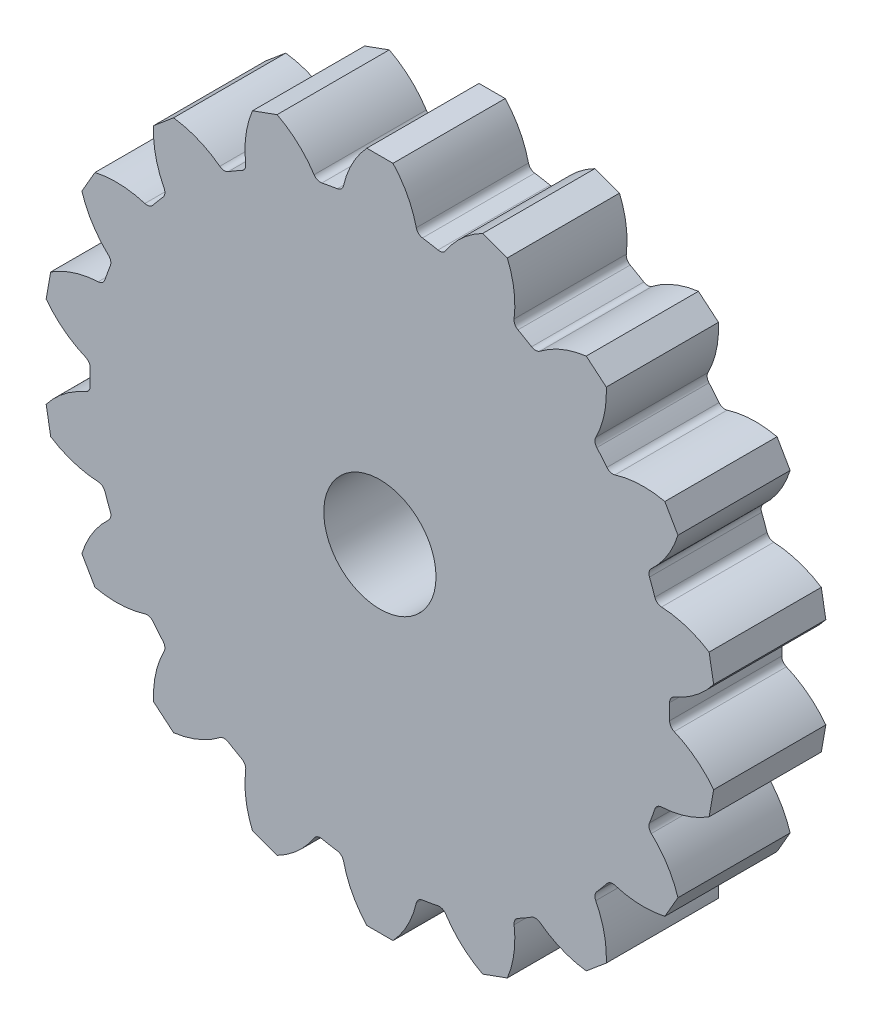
ISO-10303-21;
HEADER;
FILE_DESCRIPTION(('STEP AP214'),'2;1');
FILE_NAME('part.step','',(''),(''),'','','');
FILE_SCHEMA(('AUTOMOTIVE_DESIGN { 1 0 10303 214 1 1 1 1 }'));
ENDSEC;
DATA;
#1=APPLICATION_CONTEXT('core data for automotive mechanical design processes');
#2=APPLICATION_PROTOCOL_DEFINITION('international standard','automotive_design',2000,#1);
#3=PRODUCT_CONTEXT('',#1,'mechanical');
#4=PRODUCT('Part','Part','',(#3));
#5=PRODUCT_RELATED_PRODUCT_CATEGORY('part','',(#4));
#6=PRODUCT_DEFINITION_FORMATION('','',#4);
#7=PRODUCT_DEFINITION_CONTEXT('part definition',#1,'design');
#8=PRODUCT_DEFINITION('design','',#6,#7);
#9=PRODUCT_DEFINITION_SHAPE('','',#8);
#10=(LENGTH_UNIT() NAMED_UNIT(*) SI_UNIT(.MILLI.,.METRE.));
#11=(NAMED_UNIT(*) PLANE_ANGLE_UNIT() SI_UNIT($,.RADIAN.));
#12=(NAMED_UNIT(*) SI_UNIT($,.STERADIAN.) SOLID_ANGLE_UNIT());
#13=UNCERTAINTY_MEASURE_WITH_UNIT(LENGTH_MEASURE(1.E-05),#10,'distance_accuracy_value','');
#14=(GEOMETRIC_REPRESENTATION_CONTEXT(3) GLOBAL_UNCERTAINTY_ASSIGNED_CONTEXT((#13)) GLOBAL_UNIT_ASSIGNED_CONTEXT((#10,
#11,#12)) REPRESENTATION_CONTEXT('',''));
#15=CARTESIAN_POINT('',(0.,0.,0.));
#16=DIRECTION('',(0.,0.,1.));
#17=DIRECTION('',(1.,0.,0.));
#18=AXIS2_PLACEMENT_3D('',#15,#16,#17);
#19=CARTESIAN_POINT('',(0.,0.,15.));
#20=DIRECTION('',(0.,0.,-1.));
#21=DIRECTION('',(-1.00000000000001,0.,0.));
#22=AXIS2_PLACEMENT_3D('',#19,#20,#21);
#23=CYLINDRICAL_SURFACE('',#22,77.5);
#24=CARTESIAN_POINT('',(0.,0.,-15.));
#25=DIRECTION('',(0.,0.,1.));
#26=DIRECTION('',(1.00000000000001,0.,0.));
#27=AXIS2_PLACEMENT_3D('',#24,#25,#26);
#28=CIRCLE('',#27,77.5);
#29=CARTESIAN_POINT('',(-11.385047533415,76.6591853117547,-15.));
#30=VERTEX_POINT('',#29);
#31=CARTESIAN_POINT('',(-15.5205403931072,75.9299863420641,-15.));
#32=VERTEX_POINT('',#31);
#33=EDGE_CURVE('E1066',#30,#32,#28,.T.);
#34=ORIENTED_EDGE('',*,*,#33,.T.);
#35=DIRECTION('',(0.,0.,-1.));
#36=VECTOR('',#35,1.);
#37=CARTESIAN_POINT('',(-15.5205403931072,75.9299863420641,15.));
#38=LINE('',#37,#36);
#39=CARTESIAN_POINT('',(-15.5205403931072,75.9299863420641,15.));
#40=VERTEX_POINT('',#39);
#41=EDGE_CURVE('E47',#32,#40,#38,.F.);
#42=ORIENTED_EDGE('',*,*,#41,.T.);
#43=CARTESIAN_POINT('',(0.,0.,15.));
#44=DIRECTION('',(0.,0.,1.));
#45=DIRECTION('',(1.00000000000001,0.,0.));
#46=AXIS2_PLACEMENT_3D('',#43,#44,#45);
#47=CIRCLE('',#46,77.5);
#48=CARTESIAN_POINT('',(-11.385047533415,76.6591853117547,15.));
#49=VERTEX_POINT('',#48);
#50=EDGE_CURVE('E1070',#49,#40,#47,.T.);
#51=ORIENTED_EDGE('',*,*,#50,.F.);
#52=DIRECTION('',(0.,0.,-1.));
#53=VECTOR('',#52,1.);
#54=CARTESIAN_POINT('',(-11.385047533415,76.6591853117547,15.));
#55=LINE('',#54,#53);
#56=EDGE_CURVE('E1076',#49,#30,#55,.T.);
#57=ORIENTED_EDGE('',*,*,#56,.T.);
#58=EDGE_LOOP('',(#34,#42,#51,#57));
#59=FACE_BOUND('',#58,.T.);
#60=ADVANCED_FACE('F26',(#59),#23,.T.);
#61=CARTESIAN_POINT('',(-36.9174307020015,68.1421551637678,15.));
#62=VERTEX_POINT('',#61);
#63=CARTESIAN_POINT('',(-40.5541220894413,66.0425104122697,15.));
#64=VERTEX_POINT('',#63);
#65=EDGE_CURVE('E1073',#62,#64,#47,.T.);
#66=ORIENTED_EDGE('',*,*,#65,.F.);
#67=DIRECTION('',(0.,0.,-1.));
#68=VECTOR('',#67,1.);
#69=CARTESIAN_POINT('',(-36.9174307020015,68.1421551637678,15.));
#70=LINE('',#69,#68);
#71=CARTESIAN_POINT('',(-36.9174307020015,68.1421551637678,-15.));
#72=VERTEX_POINT('',#71);
#73=EDGE_CURVE('E1413',#62,#72,#70,.T.);
#74=ORIENTED_EDGE('',*,*,#73,.T.);
#75=CARTESIAN_POINT('',(-40.5541220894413,66.0425104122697,-15.));
#76=VERTEX_POINT('',#75);
#77=EDGE_CURVE('E1069',#72,#76,#28,.T.);
#78=ORIENTED_EDGE('',*,*,#77,.T.);
#79=DIRECTION('',(0.,0.,-1.));
#80=VECTOR('',#79,1.);
#81=CARTESIAN_POINT('',(-40.5541220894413,66.0425104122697,15.));
#82=LINE('',#81,#80);
#83=EDGE_CURVE('E1401',#76,#64,#82,.F.);
#84=ORIENTED_EDGE('',*,*,#83,.T.);
#85=EDGE_LOOP('',(#66,#74,#78,#84));
#86=FACE_BOUND('',#85,.T.);
#87=ADVANCED_FACE('F1433',(#86),#23,.T.);
#88=CARTESIAN_POINT('',(-57.9970268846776,51.4061754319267,15.));
#89=VERTEX_POINT('',#88);
#90=CARTESIAN_POINT('',(-60.6962781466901,48.1893330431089,15.));
#91=VERTEX_POINT('',#90);
#92=EDGE_CURVE('E1437',#89,#91,#47,.T.);
#93=ORIENTED_EDGE('',*,*,#92,.F.);
#94=DIRECTION('',(0.,0.,-1.));
#95=VECTOR('',#94,1.);
#96=CARTESIAN_POINT('',(-57.9970268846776,51.4061754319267,15.));
#97=LINE('',#96,#95);
#98=CARTESIAN_POINT('',(-57.9970268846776,51.4061754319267,-15.));
#99=VERTEX_POINT('',#98);
#100=EDGE_CURVE('E1393',#89,#99,#97,.T.);
#101=ORIENTED_EDGE('',*,*,#100,.T.);
#102=CARTESIAN_POINT('',(-60.6962781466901,48.1893330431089,-15.));
#103=VERTEX_POINT('',#102);
#104=EDGE_CURVE('E1803',#99,#103,#28,.T.);
#105=ORIENTED_EDGE('',*,*,#104,.T.);
#106=DIRECTION('',(0.,0.,-1.));
#107=VECTOR('',#106,1.);
#108=CARTESIAN_POINT('',(-60.6962781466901,48.1893330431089,15.));
#109=LINE('',#108,#107);
#110=EDGE_CURVE('E1381',#103,#91,#109,.F.);
#111=ORIENTED_EDGE('',*,*,#110,.T.);
#112=EDGE_LOOP('',(#93,#101,#105,#111));
#113=FACE_BOUND('',#112,.T.);
#114=ADVANCED_FACE('F1459',(#113),#23,.T.);
#115=CARTESIAN_POINT('',(-72.0813256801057,28.4698522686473,15.));
#116=VERTEX_POINT('',#115);
#117=CARTESIAN_POINT('',(-73.5175672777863,24.5238109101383,15.));
#118=VERTEX_POINT('',#117);
#119=EDGE_CURVE('E1797',#116,#118,#47,.T.);
#120=ORIENTED_EDGE('',*,*,#119,.F.);
#121=DIRECTION('',(0.,0.,-1.));
#122=VECTOR('',#121,1.);
#123=CARTESIAN_POINT('',(-72.0813256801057,28.4698522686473,15.));
#124=LINE('',#123,#122);
#125=CARTESIAN_POINT('',(-72.0813256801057,28.4698522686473,-15.));
#126=VERTEX_POINT('',#125);
#127=EDGE_CURVE('E1373',#116,#126,#124,.T.);
#128=ORIENTED_EDGE('',*,*,#127,.T.);
#129=CARTESIAN_POINT('',(-73.5175672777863,24.5238109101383,-15.));
#130=VERTEX_POINT('',#129);
#131=EDGE_CURVE('E2511',#126,#130,#28,.T.);
#132=ORIENTED_EDGE('',*,*,#131,.T.);
#133=DIRECTION('',(0.,0.,-1.));
#134=VECTOR('',#133,1.);
#135=CARTESIAN_POINT('',(-73.5175672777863,24.5238109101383,15.));
#136=LINE('',#135,#134);
#137=EDGE_CURVE('E1361',#130,#118,#136,.F.);
#138=ORIENTED_EDGE('',*,*,#137,.T.);
#139=EDGE_LOOP('',(#120,#128,#132,#138));
#140=FACE_BOUND('',#139,.T.);
#141=ADVANCED_FACE('F1662',(#140),#23,.T.);
#142=CARTESIAN_POINT('',(-77.4715527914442,2.09964475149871,15.));
#143=VERTEX_POINT('',#142);
#144=CARTESIAN_POINT('',(-77.4715527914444,-2.09964475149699,15.));
#145=VERTEX_POINT('',#144);
#146=EDGE_CURVE('E2500',#143,#145,#47,.T.);
#147=ORIENTED_EDGE('',*,*,#146,.F.);
#148=DIRECTION('',(0.,0.,-1.));
#149=VECTOR('',#148,1.);
#150=CARTESIAN_POINT('',(-77.4715527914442,2.09964475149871,15.));
#151=LINE('',#150,#149);
#152=CARTESIAN_POINT('',(-77.4715527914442,2.09964475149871,-15.));
#153=VERTEX_POINT('',#152);
#154=EDGE_CURVE('E1353',#143,#153,#151,.T.);
#155=ORIENTED_EDGE('',*,*,#154,.T.);
#156=CARTESIAN_POINT('',(-77.4715527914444,-2.09964475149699,-15.));
#157=VERTEX_POINT('',#156);
#158=EDGE_CURVE('E2524',#153,#157,#28,.T.);
#159=ORIENTED_EDGE('',*,*,#158,.T.);
#160=DIRECTION('',(0.,0.,-1.));
#161=VECTOR('',#160,1.);
#162=CARTESIAN_POINT('',(-77.4715527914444,-2.09964475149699,15.));
#163=LINE('',#162,#161);
#164=EDGE_CURVE('E1341',#157,#145,#163,.F.);
#165=ORIENTED_EDGE('',*,*,#164,.T.);
#166=EDGE_LOOP('',(#147,#155,#159,#165));
#167=FACE_BOUND('',#166,.T.);
#168=ADVANCED_FACE('F1655',(#167),#23,.T.);
#169=CARTESIAN_POINT('',(-73.5175672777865,-24.5238109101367,15.));
#170=VERTEX_POINT('',#169);
#171=CARTESIAN_POINT('',(-72.0813256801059,-28.4698522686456,15.));
#172=VERTEX_POINT('',#171);
#173=EDGE_CURVE('E2498',#170,#172,#47,.T.);
#174=ORIENTED_EDGE('',*,*,#173,.F.);
#175=DIRECTION('',(0.,0.,-1.));
#176=VECTOR('',#175,1.);
#177=CARTESIAN_POINT('',(-73.5175672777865,-24.5238109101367,15.));
#178=LINE('',#177,#176);
#179=CARTESIAN_POINT('',(-73.5175672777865,-24.5238109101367,-15.));
#180=VERTEX_POINT('',#179);
#181=EDGE_CURVE('E1333',#170,#180,#178,.T.);
#182=ORIENTED_EDGE('',*,*,#181,.T.);
#183=CARTESIAN_POINT('',(-72.0813256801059,-28.4698522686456,-15.));
#184=VERTEX_POINT('',#183);
#185=EDGE_CURVE('E2527',#180,#184,#28,.T.);
#186=ORIENTED_EDGE('',*,*,#185,.T.);
#187=DIRECTION('',(0.,0.,-1.));
#188=VECTOR('',#187,1.);
#189=CARTESIAN_POINT('',(-72.0813256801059,-28.4698522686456,15.));
#190=LINE('',#189,#188);
#191=EDGE_CURVE('E1321',#184,#172,#190,.F.);
#192=ORIENTED_EDGE('',*,*,#191,.T.);
#193=EDGE_LOOP('',(#174,#182,#186,#192));
#194=FACE_BOUND('',#193,.T.);
#195=ADVANCED_FACE('F1648',(#194),#23,.T.);
#196=CARTESIAN_POINT('',(-60.6962781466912,-48.1893330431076,15.));
#197=VERTEX_POINT('',#196);
#198=CARTESIAN_POINT('',(-57.9970268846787,-51.4061754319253,15.));
#199=VERTEX_POINT('',#198);
#200=EDGE_CURVE('E2496',#197,#199,#47,.T.);
#201=ORIENTED_EDGE('',*,*,#200,.F.);
#202=DIRECTION('',(0.,0.,-1.));
#203=VECTOR('',#202,1.);
#204=CARTESIAN_POINT('',(-60.6962781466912,-48.1893330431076,15.));
#205=LINE('',#204,#203);
#206=CARTESIAN_POINT('',(-60.6962781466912,-48.1893330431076,-15.));
#207=VERTEX_POINT('',#206);
#208=EDGE_CURVE('E1313',#197,#207,#205,.T.);
#209=ORIENTED_EDGE('',*,*,#208,.T.);
#210=CARTESIAN_POINT('',(-57.9970268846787,-51.4061754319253,-15.));
#211=VERTEX_POINT('',#210);
#212=EDGE_CURVE('E2528',#207,#211,#28,.T.);
#213=ORIENTED_EDGE('',*,*,#212,.T.);
#214=DIRECTION('',(0.,0.,-1.));
#215=VECTOR('',#214,1.);
#216=CARTESIAN_POINT('',(-57.9970268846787,-51.4061754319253,15.));
#217=LINE('',#216,#215);
#218=EDGE_CURVE('E1301',#211,#199,#217,.F.);
#219=ORIENTED_EDGE('',*,*,#218,.T.);
#220=EDGE_LOOP('',(#201,#209,#213,#219));
#221=FACE_BOUND('',#220,.T.);
#222=ADVANCED_FACE('F1641',(#221),#23,.T.);
#223=CARTESIAN_POINT('',(-40.5541220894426,-66.0425104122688,15.));
#224=VERTEX_POINT('',#223);
#225=CARTESIAN_POINT('',(-36.917430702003,-68.1421551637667,15.));
#226=VERTEX_POINT('',#225);
#227=EDGE_CURVE('E2494',#224,#226,#47,.T.);
#228=ORIENTED_EDGE('',*,*,#227,.F.);
#229=DIRECTION('',(0.,0.,-1.));
#230=VECTOR('',#229,1.);
#231=CARTESIAN_POINT('',(-40.5541220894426,-66.0425104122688,15.));
#232=LINE('',#231,#230);
#233=CARTESIAN_POINT('',(-40.5541220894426,-66.0425104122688,-15.));
#234=VERTEX_POINT('',#233);
#235=EDGE_CURVE('E1293',#224,#234,#232,.T.);
#236=ORIENTED_EDGE('',*,*,#235,.T.);
#237=CARTESIAN_POINT('',(-36.917430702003,-68.1421551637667,-15.));
#238=VERTEX_POINT('',#237);
#239=EDGE_CURVE('E2530',#234,#238,#28,.T.);
#240=ORIENTED_EDGE('',*,*,#239,.T.);
#241=DIRECTION('',(0.,0.,-1.));
#242=VECTOR('',#241,1.);
#243=CARTESIAN_POINT('',(-36.917430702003,-68.1421551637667,15.));
#244=LINE('',#243,#242);
#245=EDGE_CURVE('E1281',#238,#226,#244,.F.);
#246=ORIENTED_EDGE('',*,*,#245,.T.);
#247=EDGE_LOOP('',(#228,#236,#240,#246));
#248=FACE_BOUND('',#247,.T.);
#249=ADVANCED_FACE('F1634',(#248),#23,.T.);
#250=CARTESIAN_POINT('',(-15.5205403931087,-75.9299863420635,15.));
#251=VERTEX_POINT('',#250);
#252=CARTESIAN_POINT('',(-11.3850475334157,-76.6591853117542,15.));
#253=VERTEX_POINT('',#252);
#254=EDGE_CURVE('E2492',#251,#253,#47,.T.);
#255=ORIENTED_EDGE('',*,*,#254,.F.);
#256=DIRECTION('',(0.,0.,-1.));
#257=VECTOR('',#256,1.);
#258=CARTESIAN_POINT('',(-15.5205403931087,-75.9299863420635,15.));
#259=LINE('',#258,#257);
#260=CARTESIAN_POINT('',(-15.5205403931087,-75.9299863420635,-15.));
#261=VERTEX_POINT('',#260);
#262=EDGE_CURVE('E1273',#251,#261,#259,.T.);
#263=ORIENTED_EDGE('',*,*,#262,.T.);
#264=CARTESIAN_POINT('',(-11.3850475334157,-76.6591853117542,-15.));
#265=VERTEX_POINT('',#264);
#266=EDGE_CURVE('E2532',#261,#265,#28,.T.);
#267=ORIENTED_EDGE('',*,*,#266,.T.);
#268=DIRECTION('',(0.,0.,-1.));
#269=VECTOR('',#268,1.);
#270=CARTESIAN_POINT('',(-11.3850475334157,-76.6591853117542,15.));
#271=LINE('',#270,#269);
#272=EDGE_CURVE('E1261',#265,#253,#271,.F.);
#273=ORIENTED_EDGE('',*,*,#272,.T.);
#274=EDGE_LOOP('',(#255,#263,#267,#273));
#275=FACE_BOUND('',#274,.T.);
#276=ADVANCED_FACE('F1627',(#275),#23,.T.);
#277=CARTESIAN_POINT('',(11.3850475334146,-76.6591853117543,15.));
#278=VERTEX_POINT('',#277);
#279=CARTESIAN_POINT('',(15.5205403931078,-75.9299863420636,15.));
#280=VERTEX_POINT('',#279);
#281=EDGE_CURVE('E2490',#278,#280,#47,.T.);
#282=ORIENTED_EDGE('',*,*,#281,.F.);
#283=DIRECTION('',(0.,0.,-1.));
#284=VECTOR('',#283,1.);
#285=CARTESIAN_POINT('',(11.3850475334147,-76.6591853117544,15.));
#286=LINE('',#285,#284);
#287=CARTESIAN_POINT('',(11.3850475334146,-76.6591853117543,-15.));
#288=VERTEX_POINT('',#287);
#289=EDGE_CURVE('E1253',#278,#288,#286,.T.);
#290=ORIENTED_EDGE('',*,*,#289,.T.);
#291=CARTESIAN_POINT('',(15.5205403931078,-75.9299863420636,-15.));
#292=VERTEX_POINT('',#291);
#293=EDGE_CURVE('E2534',#288,#292,#28,.T.);
#294=ORIENTED_EDGE('',*,*,#293,.T.);
#295=DIRECTION('',(0.,0.,-1.));
#296=VECTOR('',#295,1.);
#297=CARTESIAN_POINT('',(15.5205403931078,-75.9299863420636,15.));
#298=LINE('',#297,#296);
#299=EDGE_CURVE('E1241',#292,#280,#298,.F.);
#300=ORIENTED_EDGE('',*,*,#299,.T.);
#301=EDGE_LOOP('',(#282,#290,#294,#300));
#302=FACE_BOUND('',#301,.T.);
#303=ADVANCED_FACE('F1620',(#302),#23,.T.);
#304=CARTESIAN_POINT('',(36.9174307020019,-68.1421551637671,15.));
#305=VERTEX_POINT('',#304);
#306=CARTESIAN_POINT('',(40.5541220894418,-66.0425104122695,15.));
#307=VERTEX_POINT('',#306);
#308=EDGE_CURVE('E2488',#305,#307,#47,.T.);
#309=ORIENTED_EDGE('',*,*,#308,.F.);
#310=DIRECTION('',(0.,0.,-1.));
#311=VECTOR('',#310,1.);
#312=CARTESIAN_POINT('',(36.9174307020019,-68.1421551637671,15.));
#313=LINE('',#312,#311);
#314=CARTESIAN_POINT('',(36.9174307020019,-68.1421551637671,-15.));
#315=VERTEX_POINT('',#314);
#316=EDGE_CURVE('E1233',#305,#315,#313,.T.);
#317=ORIENTED_EDGE('',*,*,#316,.T.);
#318=CARTESIAN_POINT('',(40.5541220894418,-66.0425104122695,-15.));
#319=VERTEX_POINT('',#318);
#320=EDGE_CURVE('E2536',#315,#319,#28,.T.);
#321=ORIENTED_EDGE('',*,*,#320,.T.);
#322=DIRECTION('',(0.,0.,-1.));
#323=VECTOR('',#322,1.);
#324=CARTESIAN_POINT('',(40.5541220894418,-66.0425104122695,15.));
#325=LINE('',#324,#323);
#326=EDGE_CURVE('E1221',#319,#307,#325,.F.);
#327=ORIENTED_EDGE('',*,*,#326,.T.);
#328=EDGE_LOOP('',(#309,#317,#321,#327));
#329=FACE_BOUND('',#328,.T.);
#330=ADVANCED_FACE('F1613',(#329),#23,.T.);
#331=CARTESIAN_POINT('',(57.9970268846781,-51.4061754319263,15.));
#332=VERTEX_POINT('',#331);
#333=CARTESIAN_POINT('',(60.6962781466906,-48.1893330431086,15.));
#334=VERTEX_POINT('',#333);
#335=EDGE_CURVE('E2486',#332,#334,#47,.T.);
#336=ORIENTED_EDGE('',*,*,#335,.F.);
#337=DIRECTION('',(0.,0.,-1.));
#338=VECTOR('',#337,1.);
#339=CARTESIAN_POINT('',(57.9970268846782,-51.4061754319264,15.));
#340=LINE('',#339,#338);
#341=CARTESIAN_POINT('',(57.9970268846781,-51.4061754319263,-15.));
#342=VERTEX_POINT('',#341);
#343=EDGE_CURVE('E1213',#332,#342,#340,.T.);
#344=ORIENTED_EDGE('',*,*,#343,.T.);
#345=CARTESIAN_POINT('',(60.6962781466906,-48.1893330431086,-15.));
#346=VERTEX_POINT('',#345);
#347=EDGE_CURVE('E2538',#342,#346,#28,.T.);
#348=ORIENTED_EDGE('',*,*,#347,.T.);
#349=DIRECTION('',(0.,0.,-1.));
#350=VECTOR('',#349,1.);
#351=CARTESIAN_POINT('',(60.6962781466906,-48.1893330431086,15.));
#352=LINE('',#351,#350);
#353=EDGE_CURVE('E1201',#346,#334,#352,.F.);
#354=ORIENTED_EDGE('',*,*,#353,.T.);
#355=EDGE_LOOP('',(#336,#344,#348,#354));
#356=FACE_BOUND('',#355,.T.);
#357=ADVANCED_FACE('F1606',(#356),#23,.T.);
#358=CARTESIAN_POINT('',(72.0813256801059,-28.4698522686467,15.));
#359=VERTEX_POINT('',#358);
#360=CARTESIAN_POINT('',(73.5175672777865,-24.5238109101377,15.));
#361=VERTEX_POINT('',#360);
#362=EDGE_CURVE('E2484',#359,#361,#47,.T.);
#363=ORIENTED_EDGE('',*,*,#362,.F.);
#364=DIRECTION('',(0.,0.,-1.));
#365=VECTOR('',#364,1.);
#366=CARTESIAN_POINT('',(72.0813256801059,-28.4698522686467,15.));
#367=LINE('',#366,#365);
#368=CARTESIAN_POINT('',(72.0813256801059,-28.4698522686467,-15.));
#369=VERTEX_POINT('',#368);
#370=EDGE_CURVE('E1193',#359,#369,#367,.T.);
#371=ORIENTED_EDGE('',*,*,#370,.T.);
#372=CARTESIAN_POINT('',(73.5175672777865,-24.5238109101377,-15.));
#373=VERTEX_POINT('',#372);
#374=EDGE_CURVE('E2540',#369,#373,#28,.T.);
#375=ORIENTED_EDGE('',*,*,#374,.T.);
#376=DIRECTION('',(0.,0.,-1.));
#377=VECTOR('',#376,1.);
#378=CARTESIAN_POINT('',(73.5175672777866,-24.5238109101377,15.));
#379=LINE('',#378,#377);
#380=EDGE_CURVE('E1181',#373,#361,#379,.F.);
#381=ORIENTED_EDGE('',*,*,#380,.T.);
#382=EDGE_LOOP('',(#363,#371,#375,#381));
#383=FACE_BOUND('',#382,.T.);
#384=ADVANCED_FACE('F1599',(#383),#23,.T.);
#385=CARTESIAN_POINT('',(77.4715527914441,-2.09964475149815,15.));
#386=VERTEX_POINT('',#385);
#387=CARTESIAN_POINT('',(77.4715527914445,2.09964475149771,15.));
#388=VERTEX_POINT('',#387);
#389=EDGE_CURVE('E2482',#386,#388,#47,.T.);
#390=ORIENTED_EDGE('',*,*,#389,.F.);
#391=DIRECTION('',(0.,0.,-1.));
#392=VECTOR('',#391,1.);
#393=CARTESIAN_POINT('',(77.4715527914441,-2.09964475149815,15.));
#394=LINE('',#393,#392);
#395=CARTESIAN_POINT('',(77.4715527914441,-2.09964475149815,-15.));
#396=VERTEX_POINT('',#395);
#397=EDGE_CURVE('E1173',#386,#396,#394,.T.);
#398=ORIENTED_EDGE('',*,*,#397,.T.);
#399=CARTESIAN_POINT('',(77.4715527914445,2.09964475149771,-15.));
#400=VERTEX_POINT('',#399);
#401=EDGE_CURVE('E2542',#396,#400,#28,.T.);
#402=ORIENTED_EDGE('',*,*,#401,.T.);
#403=DIRECTION('',(0.,0.,-1.));
#404=VECTOR('',#403,1.);
#405=CARTESIAN_POINT('',(77.4715527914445,2.09964475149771,15.));
#406=LINE('',#405,#404);
#407=EDGE_CURVE('E1161',#400,#388,#406,.F.);
#408=ORIENTED_EDGE('',*,*,#407,.T.);
#409=EDGE_LOOP('',(#390,#398,#402,#408));
#410=FACE_BOUND('',#409,.T.);
#411=ADVANCED_FACE('F1592',(#410),#23,.T.);
#412=CARTESIAN_POINT('',(73.5175672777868,24.5238109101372,15.));
#413=VERTEX_POINT('',#412);
#414=CARTESIAN_POINT('',(72.0813256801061,28.4698522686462,15.));
#415=VERTEX_POINT('',#414);
#416=EDGE_CURVE('E2480',#413,#415,#47,.T.);
#417=ORIENTED_EDGE('',*,*,#416,.F.);
#418=DIRECTION('',(0.,0.,-1.));
#419=VECTOR('',#418,1.);
#420=CARTESIAN_POINT('',(73.5175672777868,24.5238109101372,15.));
#421=LINE('',#420,#419);
#422=CARTESIAN_POINT('',(73.5175672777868,24.5238109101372,-15.));
#423=VERTEX_POINT('',#422);
#424=EDGE_CURVE('E1153',#413,#423,#421,.T.);
#425=ORIENTED_EDGE('',*,*,#424,.T.);
#426=CARTESIAN_POINT('',(72.0813256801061,28.4698522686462,-15.));
#427=VERTEX_POINT('',#426);
#428=EDGE_CURVE('E1504',#423,#427,#28,.T.);
#429=ORIENTED_EDGE('',*,*,#428,.T.);
#430=DIRECTION('',(0.,0.,-1.));
#431=VECTOR('',#430,1.);
#432=CARTESIAN_POINT('',(72.0813256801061,28.4698522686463,15.));
#433=LINE('',#432,#431);
#434=EDGE_CURVE('E1141',#427,#415,#433,.F.);
#435=ORIENTED_EDGE('',*,*,#434,.T.);
#436=EDGE_LOOP('',(#417,#425,#429,#435));
#437=FACE_BOUND('',#436,.T.);
#438=ADVANCED_FACE('F1585',(#437),#23,.T.);
#439=CARTESIAN_POINT('',(60.6962781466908,48.1893330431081,15.));
#440=VERTEX_POINT('',#439);
#441=CARTESIAN_POINT('',(57.9970268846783,51.4061754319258,15.));
#442=VERTEX_POINT('',#441);
#443=EDGE_CURVE('E2479',#440,#442,#47,.T.);
#444=ORIENTED_EDGE('',*,*,#443,.F.);
#445=DIRECTION('',(0.,0.,-1.));
#446=VECTOR('',#445,1.);
#447=CARTESIAN_POINT('',(60.6962781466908,48.1893330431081,15.));
#448=LINE('',#447,#446);
#449=CARTESIAN_POINT('',(60.6962781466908,48.1893330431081,-15.));
#450=VERTEX_POINT('',#449);
#451=EDGE_CURVE('E1133',#440,#450,#448,.T.);
#452=ORIENTED_EDGE('',*,*,#451,.T.);
#453=CARTESIAN_POINT('',(57.9970268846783,51.4061754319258,-15.));
#454=VERTEX_POINT('',#453);
#455=EDGE_CURVE('E1503',#450,#454,#28,.T.);
#456=ORIENTED_EDGE('',*,*,#455,.T.);
#457=DIRECTION('',(0.,0.,-1.));
#458=VECTOR('',#457,1.);
#459=CARTESIAN_POINT('',(57.9970268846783,51.4061754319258,15.));
#460=LINE('',#459,#458);
#461=EDGE_CURVE('E1121',#454,#442,#460,.F.);
#462=ORIENTED_EDGE('',*,*,#461,.T.);
#463=EDGE_LOOP('',(#444,#452,#456,#462));
#464=FACE_BOUND('',#463,.T.);
#465=ADVANCED_FACE('F1468',(#464),#23,.T.);
#466=CARTESIAN_POINT('',(40.5541220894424,66.0425104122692,15.));
#467=VERTEX_POINT('',#466);
#468=CARTESIAN_POINT('',(36.9174307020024,68.1421551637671,15.));
#469=VERTEX_POINT('',#468);
#470=EDGE_CURVE('E1475',#467,#469,#47,.T.);
#471=ORIENTED_EDGE('',*,*,#470,.F.);
#472=DIRECTION('',(0.,0.,-1.));
#473=VECTOR('',#472,1.);
#474=CARTESIAN_POINT('',(40.5541220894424,66.0425104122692,15.));
#475=LINE('',#474,#473);
#476=CARTESIAN_POINT('',(40.5541220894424,66.0425104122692,-15.));
#477=VERTEX_POINT('',#476);
#478=EDGE_CURVE('E1113',#467,#477,#475,.T.);
#479=ORIENTED_EDGE('',*,*,#478,.T.);
#480=CARTESIAN_POINT('',(36.9174307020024,68.1421551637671,-15.));
#481=VERTEX_POINT('',#480);
#482=EDGE_CURVE('E1502',#477,#481,#28,.T.);
#483=ORIENTED_EDGE('',*,*,#482,.T.);
#484=DIRECTION('',(0.,0.,-1.));
#485=VECTOR('',#484,1.);
#486=CARTESIAN_POINT('',(36.9174307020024,68.1421551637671,15.));
#487=LINE('',#486,#485);
#488=EDGE_CURVE('E1101',#481,#469,#487,.F.);
#489=ORIENTED_EDGE('',*,*,#488,.T.);
#490=EDGE_LOOP('',(#471,#479,#483,#489));
#491=FACE_BOUND('',#490,.T.);
#492=ADVANCED_FACE('F1461',(#491),#23,.T.);
#493=CARTESIAN_POINT('',(15.5205403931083,75.9299863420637,15.));
#494=VERTEX_POINT('',#493);
#495=CARTESIAN_POINT('',(11.3850475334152,76.659185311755,15.));
#496=VERTEX_POINT('',#495);
#497=EDGE_CURVE('E1068',#494,#496,#47,.T.);
#498=ORIENTED_EDGE('',*,*,#497,.F.);
#499=DIRECTION('',(0.,0.,-1.));
#500=VECTOR('',#499,1.);
#501=CARTESIAN_POINT('',(15.5205403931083,75.9299863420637,15.));
#502=LINE('',#501,#500);
#503=CARTESIAN_POINT('',(15.5205403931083,75.9299863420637,-15.));
#504=VERTEX_POINT('',#503);
#505=EDGE_CURVE('E1093',#494,#504,#502,.T.);
#506=ORIENTED_EDGE('',*,*,#505,.T.);
#507=CARTESIAN_POINT('',(11.3850475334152,76.659185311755,-15.));
#508=VERTEX_POINT('',#507);
#509=EDGE_CURVE('E1065',#504,#508,#28,.T.);
#510=ORIENTED_EDGE('',*,*,#509,.T.);
#511=DIRECTION('',(0.,0.,-1.));
#512=VECTOR('',#511,1.);
#513=CARTESIAN_POINT('',(11.3850475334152,76.659185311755,15.));
#514=LINE('',#513,#512);
#515=EDGE_CURVE('E1072',#508,#496,#514,.F.);
#516=ORIENTED_EDGE('',*,*,#515,.T.);
#517=EDGE_LOOP('',(#498,#506,#510,#516));
#518=FACE_BOUND('',#517,.T.);
#519=ADVANCED_FACE('F28',(#518),#23,.T.);
#520=CARTESIAN_POINT('',(0.,-171.822374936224,15.));
#521=DIRECTION('',(0.,0.,1.));
#522=DIRECTION('',(1.00000000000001,0.,0.));
#523=AXIS2_PLACEMENT_3D('',#520,#521,#522);
#524=PLANE('',#523);
#525=CARTESIAN_POINT('',(0.,0.,15.));
#526=DIRECTION('',(0.,0.,1.));
#527=DIRECTION('',(1.00000000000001,0.,0.));
#528=AXIS2_PLACEMENT_3D('',#525,#526,#527);
#529=CIRCLE('',#528,15.);
#530=CARTESIAN_POINT('',(15.0000000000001,0.,15.));
#531=VERTEX_POINT('',#530);
#532=EDGE_CURVE('E1544',#531,#531,#529,.T.);
#533=ORIENTED_EDGE('',*,*,#532,.F.);
#534=EDGE_LOOP('',(#533));
#535=FACE_BOUND('',#534,.T.);
#536=CARTESIAN_POINT('',(15.610980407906,72.3713180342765,15.));
#537=DIRECTION('',(0.,0.,1.));
#538=DIRECTION('',(1.00000000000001,0.,0.));
#539=AXIS2_PLACEMENT_3D('',#536,#537,#538);
#540=CIRCLE('',#539,26.);
#541=CARTESIAN_POINT('',(-9.72958123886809,78.1899033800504,15.));
#542=VERTEX_POINT('',#541);
#543=CARTESIAN_POINT('',(-3.5,90.0000000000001,15.));
#544=VERTEX_POINT('',#543);
#545=EDGE_CURVE('E1057',#542,#544,#540,.F.);
#546=ORIENTED_EDGE('',*,*,#545,.F.);
#547=CARTESIAN_POINT('',(-11.6788552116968,78.6374868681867,15.));
#548=DIRECTION('',(0.,0.,1.));
#549=DIRECTION('',(1.00000000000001,0.,0.));
#550=AXIS2_PLACEMENT_3D('',#547,#548,#549);
#551=CIRCLE('',#550,2.);
#552=EDGE_CURVE('E1086',#542,#49,#551,.F.);
#553=ORIENTED_EDGE('',*,*,#552,.T.);
#554=ORIENTED_EDGE('',*,*,#50,.T.);
#555=CARTESIAN_POINT('',(-15.9210704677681,77.8894698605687,15.));
#556=DIRECTION('',(0.,0.,1.));
#557=DIRECTION('',(1.00000000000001,0.,0.));
#558=AXIS2_PLACEMENT_3D('',#555,#556,#557);
#559=CIRCLE('',#558,2.);
#560=CARTESIAN_POINT('',(-17.5997062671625,76.8021879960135,15.));
#561=VERTEX_POINT('',#560);
#562=EDGE_CURVE('E11',#40,#561,#559,.F.);
#563=ORIENTED_EDGE('',*,*,#562,.T.);
#564=CARTESIAN_POINT('',(-39.4219716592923,62.6675237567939,15.));
#565=DIRECTION('',(0.,0.,1.));
#566=DIRECTION('',(0.939692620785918,0.342020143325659,0.));
#567=AXIS2_PLACEMENT_3D('',#564,#565,#566);
#568=CIRCLE('',#567,26.);
#569=CARTESIAN_POINT('',(-27.4928887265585,85.7694063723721,15.));
#570=VERTEX_POINT('',#569);
#571=EDGE_CURVE('E717',#561,#570,#568,.T.);
#572=ORIENTED_EDGE('',*,*,#571,.T.);
#573=DIRECTION('',(0.939692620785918,0.342020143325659,0.));
#574=VECTOR('',#573,1.);
#575=CARTESIAN_POINT('',(-30.7818128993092,84.5723358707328,15.));
#576=LINE('',#575,#574);
#577=CARTESIAN_POINT('',(-34.07073707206,83.375265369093,15.));
#578=VERTEX_POINT('',#577);
#579=EDGE_CURVE('E708',#578,#570,#576,.T.);
#580=ORIENTED_EDGE('',*,*,#579,.F.);
#581=CARTESIAN_POINT('',(-10.0829254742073,73.346063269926,15.));
#582=DIRECTION('',(0.,0.,1.));
#583=DIRECTION('',(0.939692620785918,0.342020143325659,0.));
#584=AXIS2_PLACEMENT_3D('',#581,#582,#583);
#585=CIRCLE('',#584,26.);
#586=CARTESIAN_POINT('',(-35.8853376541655,70.1467624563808,15.));
#587=VERTEX_POINT('',#586);
#588=EDGE_CURVE('E723',#587,#578,#585,.F.);
#589=ORIENTED_EDGE('',*,*,#588,.F.);
#590=CARTESIAN_POINT('',(-37.8701385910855,69.9006623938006,15.));
#591=DIRECTION('',(0.,0.,1.));
#592=DIRECTION('',(1.00000000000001,0.,0.));
#593=AXIS2_PLACEMENT_3D('',#590,#591,#592);
#594=CIRCLE('',#593,2.);
#595=EDGE_CURVE('E1422',#587,#62,#594,.F.);
#596=ORIENTED_EDGE('',*,*,#595,.T.);
#597=ORIENTED_EDGE('',*,*,#65,.T.);
#598=CARTESIAN_POINT('',(-41.6006800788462,67.7468332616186,15.));
#599=DIRECTION('',(0.,0.,1.));
#600=DIRECTION('',(1.00000000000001,0.,0.));
#601=AXIS2_PLACEMENT_3D('',#598,#599,#600);
#602=CIRCLE('',#601,2.);
#603=CARTESIAN_POINT('',(-42.8062094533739,66.1509952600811,15.));
#604=VERTEX_POINT('',#603);
#605=EDGE_CURVE('E1411',#64,#604,#602,.F.);
#606=ORIENTED_EDGE('',*,*,#605,.T.);
#607=CARTESIAN_POINT('',(-58.4780913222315,45.4051012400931,15.));
#608=DIRECTION('',(0.,0.,1.));
#609=DIRECTION('',(0.766044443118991,0.642787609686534,0.));
#610=AXIS2_PLACEMENT_3D('',#607,#608,#609);
#611=CIRCLE('',#610,26.);
#612=CARTESIAN_POINT('',(-55.1697293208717,71.1937565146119,15.));
#613=VERTEX_POINT('',#612);
#614=EDGE_CURVE('E732',#604,#613,#611,.T.);
#615=ORIENTED_EDGE('',*,*,#614,.T.);
#616=DIRECTION('',(0.766044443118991,0.642787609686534,0.));
#617=VECTOR('',#616,1.);
#618=CARTESIAN_POINT('',(-57.8508848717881,68.9439998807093,15.));
#619=LINE('',#618,#617);
#620=CARTESIAN_POINT('',(-60.5320404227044,66.6942432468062,15.));
#621=VERTEX_POINT('',#620);
#622=EDGE_CURVE('E734',#621,#613,#619,.T.);
#623=ORIENTED_EDGE('',*,*,#622,.F.);
#624=CARTESIAN_POINT('',(-34.5606817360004,65.474190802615,15.));
#625=DIRECTION('',(0.,0.,1.));
#626=DIRECTION('',(0.766044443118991,0.642787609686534,0.));
#627=AXIS2_PLACEMENT_3D('',#624,#625,#626);
#628=CIRCLE('',#627,26.);
#629=CARTESIAN_POINT('',(-57.7127927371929,53.6428867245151,15.));
#630=VERTEX_POINT('',#629);
#631=EDGE_CURVE('E737',#630,#621,#628,.F.);
#632=ORIENTED_EDGE('',*,*,#631,.F.);
#633=CARTESIAN_POINT('',(-59.4937243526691,52.7327864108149,15.));
#634=DIRECTION('',(0.,0.,1.));
#635=DIRECTION('',(1.00000000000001,0.,0.));
#636=AXIS2_PLACEMENT_3D('',#633,#634,#635);
#637=CIRCLE('',#636,2.);
#638=EDGE_CURVE('E1406',#630,#89,#637,.F.);
#639=ORIENTED_EDGE('',*,*,#638,.T.);
#640=ORIENTED_EDGE('',*,*,#92,.T.);
#641=CARTESIAN_POINT('',(-62.2626337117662,49.4329287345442,15.));
#642=DIRECTION('',(0.,0.,1.));
#643=DIRECTION('',(1.00000000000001,0.,0.));
#644=AXIS2_PLACEMENT_3D('',#641,#642,#643);
#645=CIRCLE('',#644,2.);
#646=CARTESIAN_POINT('',(-62.8496520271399,47.5210162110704,15.));
#647=VERTEX_POINT('',#646);
#648=EDGE_CURVE('E1391',#91,#647,#645,.F.);
#649=ORIENTED_EDGE('',*,*,#648,.T.);
#650=CARTESIAN_POINT('',(-70.4808901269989,22.6661534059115,15.));
#651=DIRECTION('',(0.,0.,1.));
#652=DIRECTION('',(0.500000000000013,0.866025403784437,0.));
#653=AXIS2_PLACEMENT_3D('',#650,#651,#652);
#654=CIRCLE('',#653,26.);
#655=CARTESIAN_POINT('',(-76.1922863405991,48.0310889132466,15.));
#656=VERTEX_POINT('',#655);
#657=EDGE_CURVE('E752',#647,#656,#654,.T.);
#658=ORIENTED_EDGE('',*,*,#657,.T.);
#659=DIRECTION('',(0.500000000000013,0.866025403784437,0.));
#660=VECTOR('',#659,1.);
#661=CARTESIAN_POINT('',(-77.9422863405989,45.0000000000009,15.));
#662=LINE('',#661,#660);
#663=CARTESIAN_POINT('',(-79.6922863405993,41.9689110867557,15.));
#664=VERTEX_POINT('',#663);
#665=EDGE_CURVE('E754',#664,#656,#662,.T.);
#666=ORIENTED_EDGE('',*,*,#665,.F.);
#667=CARTESIAN_POINT('',(-54.8699097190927,49.7051646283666,15.));
#668=DIRECTION('',(0.,0.,1.));
#669=DIRECTION('',(0.500000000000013,0.866025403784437,0.));
#670=AXIS2_PLACEMENT_3D('',#667,#668,#669);
#671=CIRCLE('',#670,26.);
#672=CARTESIAN_POINT('',(-72.5792332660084,30.6688871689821,15.));
#673=VERTEX_POINT('',#672);
#674=EDGE_CURVE('E757',#673,#664,#671,.F.);
#675=ORIENTED_EDGE('',*,*,#674,.F.);
#676=CARTESIAN_POINT('',(-73.9414889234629,29.2045581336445,15.));
#677=DIRECTION('',(0.,0.,1.));
#678=DIRECTION('',(1.00000000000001,0.,0.));
#679=AXIS2_PLACEMENT_3D('',#676,#677,#678);
#680=CIRCLE('',#679,2.);
#681=EDGE_CURVE('E1386',#673,#116,#680,.F.);
#682=ORIENTED_EDGE('',*,*,#681,.T.);
#683=ORIENTED_EDGE('',*,*,#119,.T.);
#684=CARTESIAN_POINT('',(-75.4147948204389,25.1566834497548,15.));
#685=DIRECTION('',(0.,0.,1.));
#686=DIRECTION('',(1.00000000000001,0.,0.));
#687=AXIS2_PLACEMENT_3D('',#684,#685,#686);
#688=CIRCLE('',#687,2.);
#689=CARTESIAN_POINT('',(-75.3124990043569,23.1593012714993,15.));
#690=VERTEX_POINT('',#689);
#691=EDGE_CURVE('E1371',#118,#690,#688,.F.);
#692=ORIENTED_EDGE('',*,*,#691,.T.);
#693=CARTESIAN_POINT('',(-73.9826533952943,-2.80666704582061,15.));
#694=DIRECTION('',(0.,0.,1.));
#695=DIRECTION('',(0.173648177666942,0.984807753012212,0.));
#696=AXIS2_PLACEMENT_3D('',#693,#694,#695);
#697=CIRCLE('',#696,26.);
#698=CARTESIAN_POINT('',(-88.0249291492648,19.0751631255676,15.));
#699=VERTEX_POINT('',#698);
#700=EDGE_CURVE('E772',#690,#699,#697,.T.);
#701=ORIENTED_EDGE('',*,*,#700,.T.);
#702=DIRECTION('',(0.173648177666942,0.984807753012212,0.));
#703=VECTOR('',#702,1.);
#704=CARTESIAN_POINT('',(-88.6326977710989,15.6283359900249,15.));
#705=LINE('',#704,#703);
#706=CARTESIAN_POINT('',(-89.2404663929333,12.1815088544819,15.));
#707=VERTEX_POINT('',#706);
#708=EDGE_CURVE('E774',#707,#699,#705,.T.);
#709=ORIENTED_EDGE('',*,*,#708,.F.);
#710=CARTESIAN_POINT('',(-68.5610167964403,27.9409620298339,15.));
#711=DIRECTION('',(0.,0.,1.));
#712=DIRECTION('',(0.173648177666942,0.984807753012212,0.));
#713=AXIS2_PLACEMENT_3D('',#710,#711,#712);
#714=CIRCLE('',#713,26.);
#715=CARTESIAN_POINT('',(-78.691547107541,3.99576719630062,15.));
#716=VERTEX_POINT('',#715);
#717=EDGE_CURVE('E777',#716,#707,#714,.F.);
#718=ORIENTED_EDGE('',*,*,#717,.F.);
#719=CARTESIAN_POINT('',(-79.4708186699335,2.15382913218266,15.));
#720=DIRECTION('',(0.,0.,1.));
#721=DIRECTION('',(1.00000000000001,0.,0.));
#722=AXIS2_PLACEMENT_3D('',#719,#720,#721);
#723=CIRCLE('',#722,2.);
#724=EDGE_CURVE('E1366',#716,#143,#723,.F.);
#725=ORIENTED_EDGE('',*,*,#724,.T.);
#726=ORIENTED_EDGE('',*,*,#146,.T.);
#727=CARTESIAN_POINT('',(-79.4708186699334,-2.15382913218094,15.));
#728=DIRECTION('',(0.,0.,1.));
#729=DIRECTION('',(1.00000000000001,0.,0.));
#730=AXIS2_PLACEMENT_3D('',#727,#728,#729);
#731=CIRCLE('',#730,2.);
#732=CARTESIAN_POINT('',(-78.6915471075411,-3.99576719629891,15.));
#733=VERTEX_POINT('',#732);
#734=EDGE_CURVE('E1351',#145,#733,#731,.F.);
#735=ORIENTED_EDGE('',*,*,#734,.T.);
#736=CARTESIAN_POINT('',(-68.5610167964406,-27.9409620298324,15.));
#737=DIRECTION('',(0.,0.,1.));
#738=DIRECTION('',(-0.173648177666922,0.984807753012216,0.));
#739=AXIS2_PLACEMENT_3D('',#736,#737,#738);
#740=CIRCLE('',#739,26.);
#741=CARTESIAN_POINT('',(-89.2404663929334,-12.1815088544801,15.));
#742=VERTEX_POINT('',#741);
#743=EDGE_CURVE('E792',#733,#742,#740,.T.);
#744=ORIENTED_EDGE('',*,*,#743,.T.);
#745=DIRECTION('',(-0.173648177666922,0.984807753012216,0.));
#746=VECTOR('',#745,1.);
#747=CARTESIAN_POINT('',(-88.6326977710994,-15.6283359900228,15.));
#748=LINE('',#747,#746);
#749=CARTESIAN_POINT('',(-88.0249291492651,-19.0751631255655,15.));
#750=VERTEX_POINT('',#749);
#751=EDGE_CURVE('E794',#750,#742,#748,.T.);
#752=ORIENTED_EDGE('',*,*,#751,.F.);
#753=CARTESIAN_POINT('',(-73.9826533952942,2.80666704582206,15.));
#754=DIRECTION('',(0.,0.,1.));
#755=DIRECTION('',(-0.173648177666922,0.984807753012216,0.));
#756=AXIS2_PLACEMENT_3D('',#753,#754,#755);
#757=CIRCLE('',#756,26.);
#758=CARTESIAN_POINT('',(-75.3124990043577,-23.1593012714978,15.));
#759=VERTEX_POINT('',#758);
#760=EDGE_CURVE('E797',#759,#750,#757,.F.);
#761=ORIENTED_EDGE('',*,*,#760,.F.);
#762=CARTESIAN_POINT('',(-75.4147948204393,-25.1566834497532,15.));
#763=DIRECTION('',(0.,0.,1.));
#764=DIRECTION('',(1.00000000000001,0.,0.));
#765=AXIS2_PLACEMENT_3D('',#762,#763,#764);
#766=CIRCLE('',#765,2.);
#767=EDGE_CURVE('E1346',#759,#170,#766,.F.);
#768=ORIENTED_EDGE('',*,*,#767,.T.);
#769=ORIENTED_EDGE('',*,*,#173,.T.);
#770=CARTESIAN_POINT('',(-73.9414889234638,-29.204558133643,15.));
#771=DIRECTION('',(0.,0.,1.));
#772=DIRECTION('',(1.00000000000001,0.,0.));
#773=AXIS2_PLACEMENT_3D('',#770,#771,#772);
#774=CIRCLE('',#773,2.);
#775=CARTESIAN_POINT('',(-72.5792332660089,-30.6688871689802,15.));
#776=VERTEX_POINT('',#775);
#777=EDGE_CURVE('E1331',#172,#776,#774,.F.);
#778=ORIENTED_EDGE('',*,*,#777,.T.);
#779=CARTESIAN_POINT('',(-54.8699097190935,-49.705164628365,15.));
#780=DIRECTION('',(0.,0.,1.));
#781=DIRECTION('',(-0.499999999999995,0.866025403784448,0.));
#782=AXIS2_PLACEMENT_3D('',#779,#780,#781);
#783=CIRCLE('',#782,26.);
#784=CARTESIAN_POINT('',(-79.6922863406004,-41.9689110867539,15.));
#785=VERTEX_POINT('',#784);
#786=EDGE_CURVE('E812',#776,#785,#783,.T.);
#787=ORIENTED_EDGE('',*,*,#786,.T.);
#788=DIRECTION('',(-0.499999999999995,0.866025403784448,0.));
#789=VECTOR('',#788,1.);
#790=CARTESIAN_POINT('',(-77.9422863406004,-44.9999999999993,15.));
#791=LINE('',#790,#789);
#792=CARTESIAN_POINT('',(-76.1922863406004,-48.031088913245,15.));
#793=VERTEX_POINT('',#792);
#794=EDGE_CURVE('E814',#793,#785,#791,.T.);
#795=ORIENTED_EDGE('',*,*,#794,.F.);
#796=CARTESIAN_POINT('',(-70.4808901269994,-22.6661534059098,15.));
#797=DIRECTION('',(0.,0.,1.));
#798=DIRECTION('',(-0.499999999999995,0.866025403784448,0.));
#799=AXIS2_PLACEMENT_3D('',#796,#797,#798);
#800=CIRCLE('',#799,26.);
#801=CARTESIAN_POINT('',(-62.849652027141,-47.5210162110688,15.));
#802=VERTEX_POINT('',#801);
#803=EDGE_CURVE('E817',#802,#793,#800,.F.);
#804=ORIENTED_EDGE('',*,*,#803,.F.);
#805=CARTESIAN_POINT('',(-62.2626337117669,-49.4329287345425,15.));
#806=DIRECTION('',(0.,0.,1.));
#807=DIRECTION('',(1.00000000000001,0.,0.));
#808=AXIS2_PLACEMENT_3D('',#805,#806,#807);
#809=CIRCLE('',#808,2.);
#810=EDGE_CURVE('E1326',#802,#197,#809,.F.);
#811=ORIENTED_EDGE('',*,*,#810,.T.);
#812=ORIENTED_EDGE('',*,*,#200,.T.);
#813=CARTESIAN_POINT('',(-59.4937243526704,-52.7327864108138,15.));
#814=DIRECTION('',(0.,0.,1.));
#815=DIRECTION('',(1.00000000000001,0.,0.));
#816=AXIS2_PLACEMENT_3D('',#813,#814,#815);
#817=CIRCLE('',#816,2.);
#818=CARTESIAN_POINT('',(-57.7127927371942,-53.642886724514,15.));
#819=VERTEX_POINT('',#818);
#820=EDGE_CURVE('E1311',#199,#819,#817,.F.);
#821=ORIENTED_EDGE('',*,*,#820,.T.);
#822=CARTESIAN_POINT('',(-34.5606817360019,-65.4741908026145,15.));
#823=DIRECTION('',(0.,0.,1.));
#824=DIRECTION('',(-0.766044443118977,0.64278760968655,0.));
#825=AXIS2_PLACEMENT_3D('',#822,#823,#824);
#826=CIRCLE('',#825,26.);
#827=CARTESIAN_POINT('',(-60.5320404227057,-66.6942432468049,15.));
#828=VERTEX_POINT('',#827);
#829=EDGE_CURVE('E832',#819,#828,#826,.T.);
#830=ORIENTED_EDGE('',*,*,#829,.T.);
#831=DIRECTION('',(-0.766044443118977,0.64278760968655,0.));
#832=VECTOR('',#831,1.);
#833=CARTESIAN_POINT('',(-57.8508848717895,-68.9439998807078,15.));
#834=LINE('',#833,#832);
#835=CARTESIAN_POINT('',(-55.1697293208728,-71.1937565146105,15.));
#836=VERTEX_POINT('',#835);
#837=EDGE_CURVE('E834',#836,#828,#834,.T.);
#838=ORIENTED_EDGE('',*,*,#837,.F.);
#839=CARTESIAN_POINT('',(-58.4780913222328,-45.405101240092,15.));
#840=DIRECTION('',(0.,0.,1.));
#841=DIRECTION('',(-0.766044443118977,0.64278760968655,0.));
#842=AXIS2_PLACEMENT_3D('',#839,#840,#841);
#843=CIRCLE('',#842,26.);
#844=CARTESIAN_POINT('',(-42.8062094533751,-66.1509952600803,15.));
#845=VERTEX_POINT('',#844);
#846=EDGE_CURVE('E837',#845,#836,#843,.F.);
#847=ORIENTED_EDGE('',*,*,#846,.F.);
#848=CARTESIAN_POINT('',(-41.6006800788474,-67.7468332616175,15.));
#849=DIRECTION('',(0.,0.,1.));
#850=DIRECTION('',(1.00000000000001,0.,0.));
#851=AXIS2_PLACEMENT_3D('',#848,#849,#850);
#852=CIRCLE('',#851,2.);
#853=EDGE_CURVE('E1306',#845,#224,#852,.F.);
#854=ORIENTED_EDGE('',*,*,#853,.T.);
#855=ORIENTED_EDGE('',*,*,#227,.T.);
#856=CARTESIAN_POINT('',(-37.8701385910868,-69.9006623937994,15.));
#857=DIRECTION('',(0.,0.,1.));
#858=DIRECTION('',(1.00000000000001,0.,0.));
#859=AXIS2_PLACEMENT_3D('',#856,#857,#858);
#860=CIRCLE('',#859,2.);
#861=CARTESIAN_POINT('',(-35.8853376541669,-70.1467624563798,15.));
#862=VERTEX_POINT('',#861);
#863=EDGE_CURVE('E1291',#226,#862,#860,.F.);
#864=ORIENTED_EDGE('',*,*,#863,.T.);
#865=CARTESIAN_POINT('',(-10.0829254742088,-73.3460632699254,15.));
#866=DIRECTION('',(0.,0.,1.));
#867=DIRECTION('',(-0.939692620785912,0.342020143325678,0.));
#868=AXIS2_PLACEMENT_3D('',#865,#866,#867);
#869=CIRCLE('',#868,26.);
#870=CARTESIAN_POINT('',(-34.0707370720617,-83.375265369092,15.));
#871=VERTEX_POINT('',#870);
#872=EDGE_CURVE('E852',#862,#871,#869,.T.);
#873=ORIENTED_EDGE('',*,*,#872,.T.);
#874=DIRECTION('',(-0.939692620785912,0.342020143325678,0.));
#875=VECTOR('',#874,1.);
#876=CARTESIAN_POINT('',(-30.7818128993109,-84.5723358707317,15.));
#877=LINE('',#876,#875);
#878=CARTESIAN_POINT('',(-27.4928887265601,-85.7694063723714,15.));
#879=VERTEX_POINT('',#878);
#880=EDGE_CURVE('E854',#879,#871,#877,.T.);
#881=ORIENTED_EDGE('',*,*,#880,.F.);
#882=CARTESIAN_POINT('',(-39.4219716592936,-62.6675237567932,15.));
#883=DIRECTION('',(0.,0.,1.));
#884=DIRECTION('',(-0.939692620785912,0.342020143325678,0.));
#885=AXIS2_PLACEMENT_3D('',#882,#883,#884);
#886=CIRCLE('',#885,26.);
#887=CARTESIAN_POINT('',(-17.5997062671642,-76.8021879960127,15.));
#888=VERTEX_POINT('',#887);
#889=EDGE_CURVE('E857',#888,#879,#886,.F.);
#890=ORIENTED_EDGE('',*,*,#889,.F.);
#891=CARTESIAN_POINT('',(-15.9210704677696,-77.8894698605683,15.));
#892=DIRECTION('',(0.,0.,1.));
#893=DIRECTION('',(1.00000000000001,0.,0.));
#894=AXIS2_PLACEMENT_3D('',#891,#892,#893);
#895=CIRCLE('',#894,2.);
#896=EDGE_CURVE('E1286',#888,#251,#895,.F.);
#897=ORIENTED_EDGE('',*,*,#896,.T.);
#898=ORIENTED_EDGE('',*,*,#254,.T.);
#899=CARTESIAN_POINT('',(-11.6788552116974,-78.6374868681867,15.));
#900=DIRECTION('',(0.,0.,1.));
#901=DIRECTION('',(1.00000000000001,0.,0.));
#902=AXIS2_PLACEMENT_3D('',#899,#900,#901);
#903=CIRCLE('',#902,2.);
#904=CARTESIAN_POINT('',(-9.72958123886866,-78.1899033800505,15.));
#905=VERTEX_POINT('',#904);
#906=EDGE_CURVE('E1271',#253,#905,#903,.F.);
#907=ORIENTED_EDGE('',*,*,#906,.T.);
#908=CARTESIAN_POINT('',(15.6109804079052,-72.3713180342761,15.));
#909=DIRECTION('',(0.,0.,1.));
#910=DIRECTION('',(-1.,0.,0.));
#911=AXIS2_PLACEMENT_3D('',#908,#909,#910);
#912=CIRCLE('',#911,26.);
#913=CARTESIAN_POINT('',(-3.50000000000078,-90.0000000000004,15.));
#914=VERTEX_POINT('',#913);
#915=EDGE_CURVE('E872',#905,#914,#912,.T.);
#916=ORIENTED_EDGE('',*,*,#915,.T.);
#917=DIRECTION('',(-1.,0.,0.));
#918=VECTOR('',#917,1.);
#919=CARTESIAN_POINT('',(-6.66133814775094E-13,-90.0000000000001,15.));
#920=LINE('',#919,#918);
#921=CARTESIAN_POINT('',(3.49999999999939,-90.0000000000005,15.));
#922=VERTEX_POINT('',#921);
#923=EDGE_CURVE('E874',#922,#914,#920,.T.);
#924=ORIENTED_EDGE('',*,*,#923,.F.);
#925=CARTESIAN_POINT('',(-15.6109804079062,-72.3713180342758,15.));
#926=DIRECTION('',(0.,0.,1.));
#927=DIRECTION('',(-1.,0.,0.));
#928=AXIS2_PLACEMENT_3D('',#925,#926,#927);
#929=CIRCLE('',#928,26.);
#930=CARTESIAN_POINT('',(9.72958123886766,-78.1899033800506,15.));
#931=VERTEX_POINT('',#930);
#932=EDGE_CURVE('E877',#931,#922,#929,.F.);
#933=ORIENTED_EDGE('',*,*,#932,.F.);
#934=CARTESIAN_POINT('',(11.6788552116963,-78.637486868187,15.));
#935=DIRECTION('',(0.,0.,1.));
#936=DIRECTION('',(1.00000000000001,0.,0.));
#937=AXIS2_PLACEMENT_3D('',#934,#935,#936);
#938=CIRCLE('',#937,2.);
#939=EDGE_CURVE('E1266',#931,#278,#938,.F.);
#940=ORIENTED_EDGE('',*,*,#939,.T.);
#941=ORIENTED_EDGE('',*,*,#281,.T.);
#942=CARTESIAN_POINT('',(15.9210704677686,-77.8894698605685,15.));
#943=DIRECTION('',(0.,0.,1.));
#944=DIRECTION('',(1.00000000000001,0.,0.));
#945=AXIS2_PLACEMENT_3D('',#942,#943,#944);
#946=CIRCLE('',#945,2.);
#947=CARTESIAN_POINT('',(17.5997062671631,-76.802187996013,15.));
#948=VERTEX_POINT('',#947);
#949=EDGE_CURVE('E1251',#280,#948,#946,.F.);
#950=ORIENTED_EDGE('',*,*,#949,.T.);
#951=CARTESIAN_POINT('',(39.4219716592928,-62.6675237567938,15.));
#952=DIRECTION('',(0.,0.,1.));
#953=DIRECTION('',(-0.939692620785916,-0.342020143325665,0.));
#954=AXIS2_PLACEMENT_3D('',#951,#952,#953);
#955=CIRCLE('',#954,26.);
#956=CARTESIAN_POINT('',(27.4928887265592,-85.7694063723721,15.));
#957=VERTEX_POINT('',#956);
#958=EDGE_CURVE('E892',#948,#957,#955,.T.);
#959=ORIENTED_EDGE('',*,*,#958,.T.);
#960=DIRECTION('',(-0.939692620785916,-0.342020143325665,0.));
#961=VECTOR('',#960,1.);
#962=CARTESIAN_POINT('',(30.7818128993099,-84.5723358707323,15.));
#963=LINE('',#962,#961);
#964=CARTESIAN_POINT('',(34.0707370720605,-83.3752653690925,15.));
#965=VERTEX_POINT('',#964);
#966=EDGE_CURVE('E894',#965,#957,#963,.T.);
#967=ORIENTED_EDGE('',*,*,#966,.F.);
#968=CARTESIAN_POINT('',(10.0829254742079,-73.3460632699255,15.));
#969=DIRECTION('',(0.,0.,1.));
#970=DIRECTION('',(-0.939692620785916,-0.342020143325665,0.));
#971=AXIS2_PLACEMENT_3D('',#968,#969,#970);
#972=CIRCLE('',#971,26.);
#973=CARTESIAN_POINT('',(35.8853376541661,-70.1467624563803,15.));
#974=VERTEX_POINT('',#973);
#975=EDGE_CURVE('E897',#974,#965,#972,.F.);
#976=ORIENTED_EDGE('',*,*,#975,.F.);
#977=CARTESIAN_POINT('',(37.8701385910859,-69.9006623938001,15.));
#978=DIRECTION('',(0.,0.,1.));
#979=DIRECTION('',(1.00000000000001,0.,0.));
#980=AXIS2_PLACEMENT_3D('',#977,#978,#979);
#981=CIRCLE('',#980,2.);
#982=EDGE_CURVE('E1246',#974,#305,#981,.F.);
#983=ORIENTED_EDGE('',*,*,#982,.T.);
#984=ORIENTED_EDGE('',*,*,#308,.T.);
#985=CARTESIAN_POINT('',(41.6006800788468,-67.7468332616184,15.));
#986=DIRECTION('',(0.,0.,1.));
#987=DIRECTION('',(1.00000000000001,0.,0.));
#988=AXIS2_PLACEMENT_3D('',#985,#986,#987);
#989=CIRCLE('',#988,2.);
#990=CARTESIAN_POINT('',(42.8062094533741,-66.1509952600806,15.));
#991=VERTEX_POINT('',#990);
#992=EDGE_CURVE('E1231',#307,#991,#989,.F.);
#993=ORIENTED_EDGE('',*,*,#992,.T.);
#994=CARTESIAN_POINT('',(58.4780913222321,-45.4051012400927,15.));
#995=DIRECTION('',(0.,0.,1.));
#996=DIRECTION('',(-0.766044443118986,-0.642787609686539,0.));
#997=AXIS2_PLACEMENT_3D('',#994,#995,#996);
#998=CIRCLE('',#997,26.);
#999=CARTESIAN_POINT('',(55.1697293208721,-71.1937565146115,15.));
#1000=VERTEX_POINT('',#999);
#1001=EDGE_CURVE('E912',#991,#1000,#998,.T.);
#1002=ORIENTED_EDGE('',*,*,#1001,.T.);
#1003=DIRECTION('',(-0.766044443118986,-0.642787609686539,0.));
#1004=VECTOR('',#1003,1.);
#1005=CARTESIAN_POINT('',(57.8508848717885,-68.9439998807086,15.));
#1006=LINE('',#1005,#1004);
#1007=CARTESIAN_POINT('',(60.5320404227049,-66.6942432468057,15.));
#1008=VERTEX_POINT('',#1007);
#1009=EDGE_CURVE('E914',#1008,#1000,#1006,.T.);
#1010=ORIENTED_EDGE('',*,*,#1009,.F.);
#1011=CARTESIAN_POINT('',(34.560681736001,-65.474190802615,15.));
#1012=DIRECTION('',(0.,0.,1.));
#1013=DIRECTION('',(-0.766044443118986,-0.642787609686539,0.));
#1014=AXIS2_PLACEMENT_3D('',#1011,#1012,#1013);
#1015=CIRCLE('',#1014,26.);
#1016=CARTESIAN_POINT('',(57.7127927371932,-53.6428867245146,15.));
#1017=VERTEX_POINT('',#1016);
#1018=EDGE_CURVE('E917',#1017,#1008,#1015,.F.);
#1019=ORIENTED_EDGE('',*,*,#1018,.F.);
#1020=CARTESIAN_POINT('',(59.4937243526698,-52.7327864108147,15.));
#1021=DIRECTION('',(0.,0.,1.));
#1022=DIRECTION('',(1.00000000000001,0.,0.));
#1023=AXIS2_PLACEMENT_3D('',#1020,#1021,#1022);
#1024=CIRCLE('',#1023,2.);
#1025=EDGE_CURVE('E1226',#1017,#332,#1024,.F.);
#1026=ORIENTED_EDGE('',*,*,#1025,.T.);
#1027=ORIENTED_EDGE('',*,*,#335,.T.);
#1028=CARTESIAN_POINT('',(62.2626337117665,-49.4329287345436,15.));
#1029=DIRECTION('',(0.,0.,1.));
#1030=DIRECTION('',(1.00000000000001,0.,0.));
#1031=AXIS2_PLACEMENT_3D('',#1028,#1029,#1030);
#1032=CIRCLE('',#1031,2.);
#1033=CARTESIAN_POINT('',(62.8496520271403,-47.5210162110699,15.));
#1034=VERTEX_POINT('',#1033);
#1035=EDGE_CURVE('E1211',#334,#1034,#1032,.F.);
#1036=ORIENTED_EDGE('',*,*,#1035,.T.);
#1037=CARTESIAN_POINT('',(70.480890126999,-22.666153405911,15.));
#1038=DIRECTION('',(0.,0.,1.));
#1039=DIRECTION('',(-0.500000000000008,-0.866025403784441,0.));
#1040=AXIS2_PLACEMENT_3D('',#1037,#1038,#1039);
#1041=CIRCLE('',#1040,26.);
#1042=CARTESIAN_POINT('',(76.1922863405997,-48.0310889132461,15.));
#1043=VERTEX_POINT('',#1042);
#1044=EDGE_CURVE('E932',#1034,#1043,#1041,.T.);
#1045=ORIENTED_EDGE('',*,*,#1044,.T.);
#1046=DIRECTION('',(-0.500000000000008,-0.866025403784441,0.));
#1047=VECTOR('',#1046,1.);
#1048=CARTESIAN_POINT('',(77.9422863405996,-45.0000000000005,15.));
#1049=LINE('',#1048,#1047);
#1050=CARTESIAN_POINT('',(79.6922863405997,-41.968911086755,15.));
#1051=VERTEX_POINT('',#1050);
#1052=EDGE_CURVE('E934',#1051,#1043,#1049,.T.);
#1053=ORIENTED_EDGE('',*,*,#1052,.F.);
#1054=CARTESIAN_POINT('',(54.8699097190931,-49.705164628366,15.));
#1055=DIRECTION('',(0.,0.,1.));
#1056=DIRECTION('',(-0.500000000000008,-0.866025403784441,0.));
#1057=AXIS2_PLACEMENT_3D('',#1054,#1055,#1056);
#1058=CIRCLE('',#1057,26.);
#1059=CARTESIAN_POINT('',(72.5792332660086,-30.6688871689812,15.));
#1060=VERTEX_POINT('',#1059);
#1061=EDGE_CURVE('E937',#1060,#1051,#1058,.F.);
#1062=ORIENTED_EDGE('',*,*,#1061,.F.);
#1063=CARTESIAN_POINT('',(73.9414889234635,-29.2045581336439,15.));
#1064=DIRECTION('',(0.,0.,1.));
#1065=DIRECTION('',(1.00000000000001,0.,0.));
#1066=AXIS2_PLACEMENT_3D('',#1063,#1064,#1065);
#1067=CIRCLE('',#1066,2.);
#1068=EDGE_CURVE('E1206',#1060,#359,#1067,.F.);
#1069=ORIENTED_EDGE('',*,*,#1068,.T.);
#1070=ORIENTED_EDGE('',*,*,#362,.T.);
#1071=CARTESIAN_POINT('',(75.4147948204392,-25.1566834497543,15.));
#1072=DIRECTION('',(0.,0.,1.));
#1073=DIRECTION('',(1.00000000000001,0.,0.));
#1074=AXIS2_PLACEMENT_3D('',#1071,#1072,#1073);
#1075=CIRCLE('',#1074,2.);
#1076=CARTESIAN_POINT('',(75.3124990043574,-23.1593012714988,15.));
#1077=VERTEX_POINT('',#1076);
#1078=EDGE_CURVE('E1191',#361,#1077,#1075,.F.);
#1079=ORIENTED_EDGE('',*,*,#1078,.T.);
#1080=CARTESIAN_POINT('',(73.9826533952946,2.80666704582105,15.));
#1081=DIRECTION('',(0.,0.,1.));
#1082=DIRECTION('',(-0.173648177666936,-0.984807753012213,0.));
#1083=AXIS2_PLACEMENT_3D('',#1080,#1081,#1082);
#1084=CIRCLE('',#1083,26.);
#1085=CARTESIAN_POINT('',(88.0249291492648,-19.075163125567,15.));
#1086=VERTEX_POINT('',#1085);
#1087=EDGE_CURVE('E952',#1077,#1086,#1084,.T.);
#1088=ORIENTED_EDGE('',*,*,#1087,.T.);
#1089=DIRECTION('',(-0.173648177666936,-0.984807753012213,0.));
#1090=VECTOR('',#1089,1.);
#1091=CARTESIAN_POINT('',(88.6326977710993,-15.6283359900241,15.));
#1092=LINE('',#1091,#1090);
#1093=CARTESIAN_POINT('',(89.2404663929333,-12.1815088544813,15.));
#1094=VERTEX_POINT('',#1093);
#1095=EDGE_CURVE('E954',#1094,#1086,#1092,.T.);
#1096=ORIENTED_EDGE('',*,*,#1095,.F.);
#1097=CARTESIAN_POINT('',(68.5610167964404,-27.9409620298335,15.));
#1098=DIRECTION('',(0.,0.,1.));
#1099=DIRECTION('',(-0.173648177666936,-0.984807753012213,0.));
#1100=AXIS2_PLACEMENT_3D('',#1097,#1098,#1099);
#1101=CIRCLE('',#1100,26.);
#1102=CARTESIAN_POINT('',(78.6915471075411,-3.99576719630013,15.));
#1103=VERTEX_POINT('',#1102);
#1104=EDGE_CURVE('E957',#1103,#1094,#1101,.F.);
#1105=ORIENTED_EDGE('',*,*,#1104,.F.);
#1106=CARTESIAN_POINT('',(79.4708186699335,-2.15382913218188,15.));
#1107=DIRECTION('',(0.,0.,1.));
#1108=DIRECTION('',(1.00000000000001,0.,0.));
#1109=AXIS2_PLACEMENT_3D('',#1106,#1107,#1108);
#1110=CIRCLE('',#1109,2.);
#1111=EDGE_CURVE('E1186',#1103,#386,#1110,.F.);
#1112=ORIENTED_EDGE('',*,*,#1111,.T.);
#1113=ORIENTED_EDGE('',*,*,#389,.T.);
#1114=CARTESIAN_POINT('',(79.4708186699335,2.15382913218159,15.));
#1115=DIRECTION('',(0.,0.,1.));
#1116=DIRECTION('',(1.00000000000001,0.,0.));
#1117=AXIS2_PLACEMENT_3D('',#1114,#1115,#1116);
#1118=CIRCLE('',#1117,2.);
#1119=CARTESIAN_POINT('',(78.6915471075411,3.99576719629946,15.));
#1120=VERTEX_POINT('',#1119);
#1121=EDGE_CURVE('E1171',#388,#1120,#1118,.F.);
#1122=ORIENTED_EDGE('',*,*,#1121,.T.);
#1123=CARTESIAN_POINT('',(68.5610167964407,27.9409620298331,15.));
#1124=DIRECTION('',(0.,0.,1.));
#1125=DIRECTION('',(0.173648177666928,-0.984807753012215,0.));
#1126=AXIS2_PLACEMENT_3D('',#1123,#1124,#1125);
#1127=CIRCLE('',#1126,26.);
#1128=CARTESIAN_POINT('',(89.2404663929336,12.1815088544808,15.));
#1129=VERTEX_POINT('',#1128);
#1130=EDGE_CURVE('E972',#1120,#1129,#1127,.T.);
#1131=ORIENTED_EDGE('',*,*,#1130,.T.);
#1132=DIRECTION('',(0.173648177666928,-0.984807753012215,0.));
#1133=VECTOR('',#1132,1.);
#1134=CARTESIAN_POINT('',(88.6326977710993,15.6283359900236,15.));
#1135=LINE('',#1134,#1133);
#1136=CARTESIAN_POINT('',(88.024929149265,19.0751631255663,15.));
#1137=VERTEX_POINT('',#1136);
#1138=EDGE_CURVE('E974',#1137,#1129,#1135,.T.);
#1139=ORIENTED_EDGE('',*,*,#1138,.F.);
#1140=CARTESIAN_POINT('',(73.9826533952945,-2.80666704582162,15.));
#1141=DIRECTION('',(0.,0.,1.));
#1142=DIRECTION('',(0.173648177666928,-0.984807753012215,0.));
#1143=AXIS2_PLACEMENT_3D('',#1140,#1141,#1142);
#1144=CIRCLE('',#1143,26.);
#1145=CARTESIAN_POINT('',(75.3124990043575,23.1593012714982,15.));
#1146=VERTEX_POINT('',#1145);
#1147=EDGE_CURVE('E977',#1146,#1137,#1144,.F.);
#1148=ORIENTED_EDGE('',*,*,#1147,.F.);
#1149=CARTESIAN_POINT('',(75.4147948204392,25.1566834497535,15.));
#1150=DIRECTION('',(0.,0.,1.));
#1151=DIRECTION('',(1.00000000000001,0.,0.));
#1152=AXIS2_PLACEMENT_3D('',#1149,#1150,#1151);
#1153=CIRCLE('',#1152,2.);
#1154=EDGE_CURVE('E1166',#1146,#413,#1153,.F.);
#1155=ORIENTED_EDGE('',*,*,#1154,.T.);
#1156=ORIENTED_EDGE('',*,*,#416,.T.);
#1157=CARTESIAN_POINT('',(73.9414889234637,29.2045581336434,15.));
#1158=DIRECTION('',(0.,0.,1.));
#1159=DIRECTION('',(1.00000000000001,0.,0.));
#1160=AXIS2_PLACEMENT_3D('',#1157,#1158,#1159);
#1161=CIRCLE('',#1160,2.);
#1162=CARTESIAN_POINT('',(72.5792332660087,30.6688871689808,15.));
#1163=VERTEX_POINT('',#1162);
#1164=EDGE_CURVE('E1151',#415,#1163,#1161,.F.);
#1165=ORIENTED_EDGE('',*,*,#1164,.T.);
#1166=CARTESIAN_POINT('',(54.8699097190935,49.7051646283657,15.));
#1167=DIRECTION('',(0.,0.,1.));
#1168=DIRECTION('',(0.5,-0.866025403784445,0.));
#1169=AXIS2_PLACEMENT_3D('',#1166,#1167,#1168);
#1170=CIRCLE('',#1169,26.);
#1171=CARTESIAN_POINT('',(79.6922863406,41.9689110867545,15.));
#1172=VERTEX_POINT('',#1171);
#1173=EDGE_CURVE('E992',#1163,#1172,#1170,.T.);
#1174=ORIENTED_EDGE('',*,*,#1173,.T.);
#1175=DIRECTION('',(0.5,-0.866025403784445,0.));
#1176=VECTOR('',#1175,1.);
#1177=CARTESIAN_POINT('',(77.9422863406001,45.0000000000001,15.));
#1178=LINE('',#1177,#1176);
#1179=CARTESIAN_POINT('',(76.1922863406,48.0310889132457,15.));
#1180=VERTEX_POINT('',#1179);
#1181=EDGE_CURVE('E994',#1180,#1172,#1178,.T.);
#1182=ORIENTED_EDGE('',*,*,#1181,.F.);
#1183=CARTESIAN_POINT('',(70.4808901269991,22.6661534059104,15.));
#1184=DIRECTION('',(0.,0.,1.));
#1185=DIRECTION('',(0.5,-0.866025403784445,0.));
#1186=AXIS2_PLACEMENT_3D('',#1183,#1184,#1185);
#1187=CIRCLE('',#1186,26.);
#1188=CARTESIAN_POINT('',(62.8496520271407,47.5210162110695,15.));
#1189=VERTEX_POINT('',#1188);
#1190=EDGE_CURVE('E997',#1189,#1180,#1187,.F.);
#1191=ORIENTED_EDGE('',*,*,#1190,.F.);
#1192=CARTESIAN_POINT('',(62.2626337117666,49.432928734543,15.));
#1193=DIRECTION('',(0.,0.,1.));
#1194=DIRECTION('',(1.00000000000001,0.,0.));
#1195=AXIS2_PLACEMENT_3D('',#1192,#1193,#1194);
#1196=CIRCLE('',#1195,2.);
#1197=EDGE_CURVE('E1146',#1189,#440,#1196,.F.);
#1198=ORIENTED_EDGE('',*,*,#1197,.T.);
#1199=ORIENTED_EDGE('',*,*,#443,.T.);
#1200=CARTESIAN_POINT('',(59.4937243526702,52.7327864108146,15.));
#1201=DIRECTION('',(0.,0.,1.));
#1202=DIRECTION('',(1.00000000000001,0.,0.));
#1203=AXIS2_PLACEMENT_3D('',#1200,#1201,#1202);
#1204=CIRCLE('',#1203,2.);
#1205=CARTESIAN_POINT('',(57.7127927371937,53.6428867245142,15.));
#1206=VERTEX_POINT('',#1205);
#1207=EDGE_CURVE('E1131',#442,#1206,#1204,.F.);
#1208=ORIENTED_EDGE('',*,*,#1207,.T.);
#1209=CARTESIAN_POINT('',(34.5606817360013,65.4741908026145,15.));
#1210=DIRECTION('',(0.,0.,1.));
#1211=DIRECTION('',(0.766044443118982,-0.642787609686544,0.));
#1212=AXIS2_PLACEMENT_3D('',#1209,#1210,#1211);
#1213=CIRCLE('',#1212,26.);
#1214=CARTESIAN_POINT('',(60.5320404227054,66.6942432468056,15.));
#1215=VERTEX_POINT('',#1214);
#1216=EDGE_CURVE('E1012',#1206,#1215,#1213,.T.);
#1217=ORIENTED_EDGE('',*,*,#1216,.T.);
#1218=DIRECTION('',(0.766044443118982,-0.642787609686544,0.));
#1219=VECTOR('',#1218,1.);
#1220=CARTESIAN_POINT('',(57.850884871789,68.9439998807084,15.));
#1221=LINE('',#1220,#1219);
#1222=CARTESIAN_POINT('',(55.1697293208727,71.1937565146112,15.));
#1223=VERTEX_POINT('',#1222);
#1224=EDGE_CURVE('E1014',#1223,#1215,#1221,.T.);
#1225=ORIENTED_EDGE('',*,*,#1224,.F.);
#1226=CARTESIAN_POINT('',(58.4780913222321,45.4051012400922,15.));
#1227=DIRECTION('',(0.,0.,1.));
#1228=DIRECTION('',(0.766044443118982,-0.642787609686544,0.));
#1229=AXIS2_PLACEMENT_3D('',#1226,#1227,#1228);
#1230=CIRCLE('',#1229,26.);
#1231=CARTESIAN_POINT('',(42.8062094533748,66.1509952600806,15.));
#1232=VERTEX_POINT('',#1231);
#1233=EDGE_CURVE('E1017',#1232,#1223,#1230,.F.);
#1234=ORIENTED_EDGE('',*,*,#1233,.F.);
#1235=CARTESIAN_POINT('',(41.600680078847,67.7468332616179,15.));
#1236=DIRECTION('',(0.,0.,1.));
#1237=DIRECTION('',(1.00000000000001,0.,0.));
#1238=AXIS2_PLACEMENT_3D('',#1235,#1236,#1237);
#1239=CIRCLE('',#1238,2.);
#1240=EDGE_CURVE('E1126',#1232,#467,#1239,.F.);
#1241=ORIENTED_EDGE('',*,*,#1240,.T.);
#1242=ORIENTED_EDGE('',*,*,#470,.T.);
#1243=CARTESIAN_POINT('',(37.8701385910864,69.9006623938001,15.));
#1244=DIRECTION('',(0.,0.,1.));
#1245=DIRECTION('',(1.00000000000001,0.,0.));
#1246=AXIS2_PLACEMENT_3D('',#1243,#1244,#1245);
#1247=CIRCLE('',#1246,2.);
#1248=CARTESIAN_POINT('',(35.8853376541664,70.1467624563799,15.));
#1249=VERTEX_POINT('',#1248);
#1250=EDGE_CURVE('E1111',#469,#1249,#1247,.F.);
#1251=ORIENTED_EDGE('',*,*,#1250,.T.);
#1252=CARTESIAN_POINT('',(10.0829254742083,73.3460632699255,15.));
#1253=DIRECTION('',(0.,0.,1.));
#1254=DIRECTION('',(0.939692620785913,-0.342020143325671,0.));
#1255=AXIS2_PLACEMENT_3D('',#1252,#1253,#1254);
#1256=CIRCLE('',#1255,26.);
#1257=CARTESIAN_POINT('',(34.0707370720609,83.3752653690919,15.));
#1258=VERTEX_POINT('',#1257);
#1259=EDGE_CURVE('E1032',#1249,#1258,#1256,.T.);
#1260=ORIENTED_EDGE('',*,*,#1259,.T.);
#1261=DIRECTION('',(0.939692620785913,-0.342020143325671,0.));
#1262=VECTOR('',#1261,1.);
#1263=CARTESIAN_POINT('',(30.7818128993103,84.5723358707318,15.));
#1264=LINE('',#1263,#1262);
#1265=CARTESIAN_POINT('',(27.4928887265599,85.7694063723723,15.));
#1266=VERTEX_POINT('',#1265);
#1267=EDGE_CURVE('E1034',#1266,#1258,#1264,.T.);
#1268=ORIENTED_EDGE('',*,*,#1267,.F.);
#1269=CARTESIAN_POINT('',(39.4219716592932,62.6675237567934,15.));
#1270=DIRECTION('',(0.,0.,1.));
#1271=DIRECTION('',(0.939692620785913,-0.342020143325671,0.));
#1272=AXIS2_PLACEMENT_3D('',#1269,#1270,#1271);
#1273=CIRCLE('',#1272,26.);
#1274=CARTESIAN_POINT('',(17.5997062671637,76.8021879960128,15.));
#1275=VERTEX_POINT('',#1274);
#1276=EDGE_CURVE('E1037',#1275,#1266,#1273,.F.);
#1277=ORIENTED_EDGE('',*,*,#1276,.F.);
#1278=CARTESIAN_POINT('',(15.9210704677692,77.8894698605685,15.));
#1279=DIRECTION('',(0.,0.,1.));
#1280=DIRECTION('',(1.00000000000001,0.,0.));
#1281=AXIS2_PLACEMENT_3D('',#1278,#1279,#1280);
#1282=CIRCLE('',#1281,2.);
#1283=EDGE_CURVE('E1106',#1275,#494,#1282,.F.);
#1284=ORIENTED_EDGE('',*,*,#1283,.T.);
#1285=ORIENTED_EDGE('',*,*,#497,.T.);
#1286=CARTESIAN_POINT('',(11.6788552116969,78.6374868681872,15.));
#1287=DIRECTION('',(0.,0.,1.));
#1288=DIRECTION('',(1.00000000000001,0.,0.));
#1289=AXIS2_PLACEMENT_3D('',#1286,#1287,#1288);
#1290=CIRCLE('',#1289,2.);
#1291=CARTESIAN_POINT('',(9.72958123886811,78.1899033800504,15.));
#1292=VERTEX_POINT('',#1291);
#1293=EDGE_CURVE('E1091',#496,#1292,#1290,.F.);
#1294=ORIENTED_EDGE('',*,*,#1293,.T.);
#1295=CARTESIAN_POINT('',(-15.6109804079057,72.3713180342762,15.));
#1296=DIRECTION('',(0.,0.,1.));
#1297=DIRECTION('',(1.00000000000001,0.,0.));
#1298=AXIS2_PLACEMENT_3D('',#1295,#1296,#1297);
#1299=CIRCLE('',#1298,26.);
#1300=CARTESIAN_POINT('',(3.50000000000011,90.0000000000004,15.));
#1301=VERTEX_POINT('',#1300);
#1302=EDGE_CURVE('E1052',#1292,#1301,#1299,.T.);
#1303=ORIENTED_EDGE('',*,*,#1302,.T.);
#1304=DIRECTION('',(1.00000000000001,0.,0.));
#1305=VECTOR('',#1304,1.);
#1306=CARTESIAN_POINT('',(2.08166817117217E-13,90.0000000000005,15.));
#1307=LINE('',#1306,#1305);
#1308=EDGE_CURVE('E1054',#544,#1301,#1307,.T.);
#1309=ORIENTED_EDGE('',*,*,#1308,.F.);
#1310=EDGE_LOOP('',(#546,#553,#554,#563,#572,#580,#589,#596,#597,#606,#615,#623,#632,#639,#640,
#649,#658,#666,#675,#682,#683,#692,#701,#709,#718,#725,#726,#735,#744,#752,#761,#768,#769,#778,
#787,#795,#804,#811,#812,#821,#830,#838,#847,#854,#855,#864,#873,#881,#890,#897,#898,#907,#916,
#924,#933,#940,#941,#950,#959,#967,#976,#983,#984,#993,#1002,#1010,#1019,#1026,#1027,#1036,
#1045,#1053,#1062,#1069,#1070,#1079,#1088,#1096,#1105,#1112,#1113,#1122,#1131,#1139,#1148,#1155,
#1156,#1165,#1174,#1182,#1191,#1198,#1199,#1208,#1217,#1225,#1234,#1241,#1242,#1251,#1260,#1268,
#1277,#1284,#1285,#1294,#1303,#1309));
#1311=FACE_BOUND('',#1310,.T.);
#1312=ADVANCED_FACE('F1428',(#535,#1311),#524,.T.);
#1313=CARTESIAN_POINT('',(0.,-171.822374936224,-15.));
#1314=DIRECTION('',(0.,0.,1.));
#1315=DIRECTION('',(1.00000000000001,0.,0.));
#1316=AXIS2_PLACEMENT_3D('',#1313,#1314,#1315);
#1317=PLANE('',#1316);
#1318=CARTESIAN_POINT('',(0.,0.,-15.));
#1319=DIRECTION('',(0.,0.,1.));
#1320=DIRECTION('',(1.00000000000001,0.,0.));
#1321=AXIS2_PLACEMENT_3D('',#1318,#1319,#1320);
#1322=CIRCLE('',#1321,15.);
#1323=CARTESIAN_POINT('',(15.0000000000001,0.,-15.));
#1324=VERTEX_POINT('',#1323);
#1325=EDGE_CURVE('E701',#1324,#1324,#1322,.T.);
#1326=ORIENTED_EDGE('',*,*,#1325,.T.);
#1327=EDGE_LOOP('',(#1326));
#1328=FACE_BOUND('',#1327,.T.);
#1329=ORIENTED_EDGE('',*,*,#33,.F.);
#1330=CARTESIAN_POINT('',(-11.6788552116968,78.6374868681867,-15.));
#1331=DIRECTION('',(0.,0.,1.));
#1332=DIRECTION('',(1.00000000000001,0.,0.));
#1333=AXIS2_PLACEMENT_3D('',#1330,#1331,#1332);
#1334=CIRCLE('',#1333,2.);
#1335=CARTESIAN_POINT('',(-9.72958123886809,78.1899033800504,-15.));
#1336=VERTEX_POINT('',#1335);
#1337=EDGE_CURVE('E1084',#30,#1336,#1334,.T.);
#1338=ORIENTED_EDGE('',*,*,#1337,.T.);
#1339=CARTESIAN_POINT('',(15.610980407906,72.3713180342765,-15.));
#1340=DIRECTION('',(0.,0.,1.));
#1341=DIRECTION('',(1.00000000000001,0.,0.));
#1342=AXIS2_PLACEMENT_3D('',#1339,#1340,#1341);
#1343=CIRCLE('',#1342,26.);
#1344=CARTESIAN_POINT('',(-3.5,90.0000000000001,-15.));
#1345=VERTEX_POINT('',#1344);
#1346=EDGE_CURVE('E1050',#1336,#1345,#1343,.F.);
#1347=ORIENTED_EDGE('',*,*,#1346,.T.);
#1348=DIRECTION('',(1.00000000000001,0.,0.));
#1349=VECTOR('',#1348,1.);
#1350=CARTESIAN_POINT('',(2.08166817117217E-13,90.0000000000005,-15.));
#1351=LINE('',#1350,#1349);
#1352=CARTESIAN_POINT('',(3.50000000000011,90.0000000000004,-15.));
#1353=VERTEX_POINT('',#1352);
#1354=EDGE_CURVE('E1047',#1345,#1353,#1351,.T.);
#1355=ORIENTED_EDGE('',*,*,#1354,.T.);
#1356=CARTESIAN_POINT('',(-15.6109804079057,72.3713180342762,-15.));
#1357=DIRECTION('',(0.,0.,1.));
#1358=DIRECTION('',(1.00000000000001,0.,0.));
#1359=AXIS2_PLACEMENT_3D('',#1356,#1357,#1358);
#1360=CIRCLE('',#1359,26.);
#1361=CARTESIAN_POINT('',(9.72958123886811,78.1899033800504,-15.));
#1362=VERTEX_POINT('',#1361);
#1363=EDGE_CURVE('E1045',#1362,#1353,#1360,.T.);
#1364=ORIENTED_EDGE('',*,*,#1363,.F.);
#1365=CARTESIAN_POINT('',(11.6788552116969,78.6374868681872,-15.));
#1366=DIRECTION('',(0.,0.,1.));
#1367=DIRECTION('',(1.00000000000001,0.,0.));
#1368=AXIS2_PLACEMENT_3D('',#1365,#1366,#1367);
#1369=CIRCLE('',#1368,2.);
#1370=EDGE_CURVE('E1088',#1362,#508,#1369,.T.);
#1371=ORIENTED_EDGE('',*,*,#1370,.T.);
#1372=ORIENTED_EDGE('',*,*,#509,.F.);
#1373=CARTESIAN_POINT('',(15.9210704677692,77.8894698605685,-15.));
#1374=DIRECTION('',(0.,0.,1.));
#1375=DIRECTION('',(1.00000000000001,0.,0.));
#1376=AXIS2_PLACEMENT_3D('',#1373,#1374,#1375);
#1377=CIRCLE('',#1376,2.);
#1378=CARTESIAN_POINT('',(17.5997062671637,76.8021879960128,-15.));
#1379=VERTEX_POINT('',#1378);
#1380=EDGE_CURVE('E1104',#504,#1379,#1377,.T.);
#1381=ORIENTED_EDGE('',*,*,#1380,.T.);
#1382=CARTESIAN_POINT('',(39.4219716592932,62.6675237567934,-15.));
#1383=DIRECTION('',(0.,0.,1.));
#1384=DIRECTION('',(0.939692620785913,-0.342020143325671,0.));
#1385=AXIS2_PLACEMENT_3D('',#1382,#1383,#1384);
#1386=CIRCLE('',#1385,26.);
#1387=CARTESIAN_POINT('',(27.4928887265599,85.7694063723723,-15.));
#1388=VERTEX_POINT('',#1387);
#1389=EDGE_CURVE('E1030',#1379,#1388,#1386,.F.);
#1390=ORIENTED_EDGE('',*,*,#1389,.T.);
#1391=DIRECTION('',(0.939692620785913,-0.342020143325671,0.));
#1392=VECTOR('',#1391,1.);
#1393=CARTESIAN_POINT('',(30.7818128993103,84.5723358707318,-15.));
#1394=LINE('',#1393,#1392);
#1395=CARTESIAN_POINT('',(34.0707370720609,83.3752653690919,-15.));
#1396=VERTEX_POINT('',#1395);
#1397=EDGE_CURVE('E1027',#1388,#1396,#1394,.T.);
#1398=ORIENTED_EDGE('',*,*,#1397,.T.);
#1399=CARTESIAN_POINT('',(10.0829254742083,73.3460632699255,-15.));
#1400=DIRECTION('',(0.,0.,1.));
#1401=DIRECTION('',(0.939692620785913,-0.342020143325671,0.));
#1402=AXIS2_PLACEMENT_3D('',#1399,#1400,#1401);
#1403=CIRCLE('',#1402,26.);
#1404=CARTESIAN_POINT('',(35.8853376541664,70.1467624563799,-15.));
#1405=VERTEX_POINT('',#1404);
#1406=EDGE_CURVE('E1025',#1405,#1396,#1403,.T.);
#1407=ORIENTED_EDGE('',*,*,#1406,.F.);
#1408=CARTESIAN_POINT('',(37.8701385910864,69.9006623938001,-15.));
#1409=DIRECTION('',(0.,0.,1.));
#1410=DIRECTION('',(1.00000000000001,0.,0.));
#1411=AXIS2_PLACEMENT_3D('',#1408,#1409,#1410);
#1412=CIRCLE('',#1411,2.);
#1413=EDGE_CURVE('E1108',#1405,#481,#1412,.T.);
#1414=ORIENTED_EDGE('',*,*,#1413,.T.);
#1415=ORIENTED_EDGE('',*,*,#482,.F.);
#1416=CARTESIAN_POINT('',(41.600680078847,67.7468332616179,-15.));
#1417=DIRECTION('',(0.,0.,1.));
#1418=DIRECTION('',(1.00000000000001,0.,0.));
#1419=AXIS2_PLACEMENT_3D('',#1416,#1417,#1418);
#1420=CIRCLE('',#1419,2.);
#1421=CARTESIAN_POINT('',(42.8062094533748,66.1509952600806,-15.));
#1422=VERTEX_POINT('',#1421);
#1423=EDGE_CURVE('E1124',#477,#1422,#1420,.T.);
#1424=ORIENTED_EDGE('',*,*,#1423,.T.);
#1425=CARTESIAN_POINT('',(58.4780913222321,45.4051012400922,-15.));
#1426=DIRECTION('',(0.,0.,1.));
#1427=DIRECTION('',(0.766044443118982,-0.642787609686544,0.));
#1428=AXIS2_PLACEMENT_3D('',#1425,#1426,#1427);
#1429=CIRCLE('',#1428,26.);
#1430=CARTESIAN_POINT('',(55.1697293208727,71.1937565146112,-15.));
#1431=VERTEX_POINT('',#1430);
#1432=EDGE_CURVE('E1010',#1422,#1431,#1429,.F.);
#1433=ORIENTED_EDGE('',*,*,#1432,.T.);
#1434=DIRECTION('',(0.766044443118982,-0.642787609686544,0.));
#1435=VECTOR('',#1434,1.);
#1436=CARTESIAN_POINT('',(57.850884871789,68.9439998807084,-15.));
#1437=LINE('',#1436,#1435);
#1438=CARTESIAN_POINT('',(60.5320404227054,66.6942432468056,-15.));
#1439=VERTEX_POINT('',#1438);
#1440=EDGE_CURVE('E1007',#1431,#1439,#1437,.T.);
#1441=ORIENTED_EDGE('',*,*,#1440,.T.);
#1442=CARTESIAN_POINT('',(34.5606817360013,65.4741908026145,-15.));
#1443=DIRECTION('',(0.,0.,1.));
#1444=DIRECTION('',(0.766044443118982,-0.642787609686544,0.));
#1445=AXIS2_PLACEMENT_3D('',#1442,#1443,#1444);
#1446=CIRCLE('',#1445,26.);
#1447=CARTESIAN_POINT('',(57.7127927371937,53.6428867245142,-15.));
#1448=VERTEX_POINT('',#1447);
#1449=EDGE_CURVE('E1005',#1448,#1439,#1446,.T.);
#1450=ORIENTED_EDGE('',*,*,#1449,.F.);
#1451=CARTESIAN_POINT('',(59.4937243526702,52.7327864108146,-15.));
#1452=DIRECTION('',(0.,0.,1.));
#1453=DIRECTION('',(1.00000000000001,0.,0.));
#1454=AXIS2_PLACEMENT_3D('',#1451,#1452,#1453);
#1455=CIRCLE('',#1454,2.);
#1456=EDGE_CURVE('E1128',#1448,#454,#1455,.T.);
#1457=ORIENTED_EDGE('',*,*,#1456,.T.);
#1458=ORIENTED_EDGE('',*,*,#455,.F.);
#1459=CARTESIAN_POINT('',(62.2626337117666,49.432928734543,-15.));
#1460=DIRECTION('',(0.,0.,1.));
#1461=DIRECTION('',(1.00000000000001,0.,0.));
#1462=AXIS2_PLACEMENT_3D('',#1459,#1460,#1461);
#1463=CIRCLE('',#1462,2.);
#1464=CARTESIAN_POINT('',(62.8496520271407,47.5210162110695,-15.));
#1465=VERTEX_POINT('',#1464);
#1466=EDGE_CURVE('E1144',#450,#1465,#1463,.T.);
#1467=ORIENTED_EDGE('',*,*,#1466,.T.);
#1468=CARTESIAN_POINT('',(70.4808901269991,22.6661534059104,-15.));
#1469=DIRECTION('',(0.,0.,1.));
#1470=DIRECTION('',(0.5,-0.866025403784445,0.));
#1471=AXIS2_PLACEMENT_3D('',#1468,#1469,#1470);
#1472=CIRCLE('',#1471,26.);
#1473=CARTESIAN_POINT('',(76.1922863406,48.0310889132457,-15.));
#1474=VERTEX_POINT('',#1473);
#1475=EDGE_CURVE('E990',#1465,#1474,#1472,.F.);
#1476=ORIENTED_EDGE('',*,*,#1475,.T.);
#1477=DIRECTION('',(0.5,-0.866025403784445,0.));
#1478=VECTOR('',#1477,1.);
#1479=CARTESIAN_POINT('',(77.9422863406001,45.0000000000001,-15.));
#1480=LINE('',#1479,#1478);
#1481=CARTESIAN_POINT('',(79.6922863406,41.9689110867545,-15.));
#1482=VERTEX_POINT('',#1481);
#1483=EDGE_CURVE('E987',#1474,#1482,#1480,.T.);
#1484=ORIENTED_EDGE('',*,*,#1483,.T.);
#1485=CARTESIAN_POINT('',(54.8699097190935,49.7051646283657,-15.));
#1486=DIRECTION('',(0.,0.,1.));
#1487=DIRECTION('',(0.5,-0.866025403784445,0.));
#1488=AXIS2_PLACEMENT_3D('',#1485,#1486,#1487);
#1489=CIRCLE('',#1488,26.);
#1490=CARTESIAN_POINT('',(72.5792332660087,30.6688871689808,-15.));
#1491=VERTEX_POINT('',#1490);
#1492=EDGE_CURVE('E985',#1491,#1482,#1489,.T.);
#1493=ORIENTED_EDGE('',*,*,#1492,.F.);
#1494=CARTESIAN_POINT('',(73.9414889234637,29.2045581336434,-15.));
#1495=DIRECTION('',(0.,0.,1.));
#1496=DIRECTION('',(1.00000000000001,0.,0.));
#1497=AXIS2_PLACEMENT_3D('',#1494,#1495,#1496);
#1498=CIRCLE('',#1497,2.);
#1499=EDGE_CURVE('E1148',#1491,#427,#1498,.T.);
#1500=ORIENTED_EDGE('',*,*,#1499,.T.);
#1501=ORIENTED_EDGE('',*,*,#428,.F.);
#1502=CARTESIAN_POINT('',(75.4147948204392,25.1566834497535,-15.));
#1503=DIRECTION('',(0.,0.,1.));
#1504=DIRECTION('',(1.00000000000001,0.,0.));
#1505=AXIS2_PLACEMENT_3D('',#1502,#1503,#1504);
#1506=CIRCLE('',#1505,2.);
#1507=CARTESIAN_POINT('',(75.3124990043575,23.1593012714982,-15.));
#1508=VERTEX_POINT('',#1507);
#1509=EDGE_CURVE('E1164',#423,#1508,#1506,.T.);
#1510=ORIENTED_EDGE('',*,*,#1509,.T.);
#1511=CARTESIAN_POINT('',(73.9826533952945,-2.80666704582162,-15.));
#1512=DIRECTION('',(0.,0.,1.));
#1513=DIRECTION('',(0.173648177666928,-0.984807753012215,0.));
#1514=AXIS2_PLACEMENT_3D('',#1511,#1512,#1513);
#1515=CIRCLE('',#1514,26.);
#1516=CARTESIAN_POINT('',(88.024929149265,19.0751631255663,-15.));
#1517=VERTEX_POINT('',#1516);
#1518=EDGE_CURVE('E970',#1508,#1517,#1515,.F.);
#1519=ORIENTED_EDGE('',*,*,#1518,.T.);
#1520=DIRECTION('',(0.173648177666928,-0.984807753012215,0.));
#1521=VECTOR('',#1520,1.);
#1522=CARTESIAN_POINT('',(88.6326977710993,15.6283359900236,-15.));
#1523=LINE('',#1522,#1521);
#1524=CARTESIAN_POINT('',(89.2404663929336,12.1815088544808,-15.));
#1525=VERTEX_POINT('',#1524);
#1526=EDGE_CURVE('E967',#1517,#1525,#1523,.T.);
#1527=ORIENTED_EDGE('',*,*,#1526,.T.);
#1528=CARTESIAN_POINT('',(68.5610167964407,27.9409620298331,-15.));
#1529=DIRECTION('',(0.,0.,1.));
#1530=DIRECTION('',(0.173648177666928,-0.984807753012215,0.));
#1531=AXIS2_PLACEMENT_3D('',#1528,#1529,#1530);
#1532=CIRCLE('',#1531,26.);
#1533=CARTESIAN_POINT('',(78.6915471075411,3.99576719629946,-15.));
#1534=VERTEX_POINT('',#1533);
#1535=EDGE_CURVE('E965',#1534,#1525,#1532,.T.);
#1536=ORIENTED_EDGE('',*,*,#1535,.F.);
#1537=CARTESIAN_POINT('',(79.4708186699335,2.15382913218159,-15.));
#1538=DIRECTION('',(0.,0.,1.));
#1539=DIRECTION('',(1.00000000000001,0.,0.));
#1540=AXIS2_PLACEMENT_3D('',#1537,#1538,#1539);
#1541=CIRCLE('',#1540,2.);
#1542=EDGE_CURVE('E1168',#1534,#400,#1541,.T.);
#1543=ORIENTED_EDGE('',*,*,#1542,.T.);
#1544=ORIENTED_EDGE('',*,*,#401,.F.);
#1545=CARTESIAN_POINT('',(79.4708186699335,-2.15382913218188,-15.));
#1546=DIRECTION('',(0.,0.,1.));
#1547=DIRECTION('',(1.00000000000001,0.,0.));
#1548=AXIS2_PLACEMENT_3D('',#1545,#1546,#1547);
#1549=CIRCLE('',#1548,2.);
#1550=CARTESIAN_POINT('',(78.6915471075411,-3.99576719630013,-15.));
#1551=VERTEX_POINT('',#1550);
#1552=EDGE_CURVE('E1184',#396,#1551,#1549,.T.);
#1553=ORIENTED_EDGE('',*,*,#1552,.T.);
#1554=CARTESIAN_POINT('',(68.5610167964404,-27.9409620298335,-15.));
#1555=DIRECTION('',(0.,0.,1.));
#1556=DIRECTION('',(-0.173648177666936,-0.984807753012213,0.));
#1557=AXIS2_PLACEMENT_3D('',#1554,#1555,#1556);
#1558=CIRCLE('',#1557,26.);
#1559=CARTESIAN_POINT('',(89.2404663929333,-12.1815088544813,-15.));
#1560=VERTEX_POINT('',#1559);
#1561=EDGE_CURVE('E950',#1551,#1560,#1558,.F.);
#1562=ORIENTED_EDGE('',*,*,#1561,.T.);
#1563=DIRECTION('',(-0.173648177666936,-0.984807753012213,0.));
#1564=VECTOR('',#1563,1.);
#1565=CARTESIAN_POINT('',(88.6326977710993,-15.6283359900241,-15.));
#1566=LINE('',#1565,#1564);
#1567=CARTESIAN_POINT('',(88.0249291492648,-19.075163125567,-15.));
#1568=VERTEX_POINT('',#1567);
#1569=EDGE_CURVE('E947',#1560,#1568,#1566,.T.);
#1570=ORIENTED_EDGE('',*,*,#1569,.T.);
#1571=CARTESIAN_POINT('',(73.9826533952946,2.80666704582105,-15.));
#1572=DIRECTION('',(0.,0.,1.));
#1573=DIRECTION('',(-0.173648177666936,-0.984807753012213,0.));
#1574=AXIS2_PLACEMENT_3D('',#1571,#1572,#1573);
#1575=CIRCLE('',#1574,26.);
#1576=CARTESIAN_POINT('',(75.3124990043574,-23.1593012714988,-15.));
#1577=VERTEX_POINT('',#1576);
#1578=EDGE_CURVE('E945',#1577,#1568,#1575,.T.);
#1579=ORIENTED_EDGE('',*,*,#1578,.F.);
#1580=CARTESIAN_POINT('',(75.4147948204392,-25.1566834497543,-15.));
#1581=DIRECTION('',(0.,0.,1.));
#1582=DIRECTION('',(1.00000000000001,0.,0.));
#1583=AXIS2_PLACEMENT_3D('',#1580,#1581,#1582);
#1584=CIRCLE('',#1583,2.);
#1585=EDGE_CURVE('E1188',#1577,#373,#1584,.T.);
#1586=ORIENTED_EDGE('',*,*,#1585,.T.);
#1587=ORIENTED_EDGE('',*,*,#374,.F.);
#1588=CARTESIAN_POINT('',(73.9414889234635,-29.2045581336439,-15.));
#1589=DIRECTION('',(0.,0.,1.));
#1590=DIRECTION('',(1.00000000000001,0.,0.));
#1591=AXIS2_PLACEMENT_3D('',#1588,#1589,#1590);
#1592=CIRCLE('',#1591,2.);
#1593=CARTESIAN_POINT('',(72.5792332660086,-30.6688871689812,-15.));
#1594=VERTEX_POINT('',#1593);
#1595=EDGE_CURVE('E1204',#369,#1594,#1592,.T.);
#1596=ORIENTED_EDGE('',*,*,#1595,.T.);
#1597=CARTESIAN_POINT('',(54.8699097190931,-49.705164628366,-15.));
#1598=DIRECTION('',(0.,0.,1.));
#1599=DIRECTION('',(-0.500000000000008,-0.866025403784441,0.));
#1600=AXIS2_PLACEMENT_3D('',#1597,#1598,#1599);
#1601=CIRCLE('',#1600,26.);
#1602=CARTESIAN_POINT('',(79.6922863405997,-41.968911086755,-15.));
#1603=VERTEX_POINT('',#1602);
#1604=EDGE_CURVE('E930',#1594,#1603,#1601,.F.);
#1605=ORIENTED_EDGE('',*,*,#1604,.T.);
#1606=DIRECTION('',(-0.500000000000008,-0.866025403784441,0.));
#1607=VECTOR('',#1606,1.);
#1608=CARTESIAN_POINT('',(77.9422863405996,-45.0000000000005,-15.));
#1609=LINE('',#1608,#1607);
#1610=CARTESIAN_POINT('',(76.1922863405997,-48.0310889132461,-15.));
#1611=VERTEX_POINT('',#1610);
#1612=EDGE_CURVE('E927',#1603,#1611,#1609,.T.);
#1613=ORIENTED_EDGE('',*,*,#1612,.T.);
#1614=CARTESIAN_POINT('',(70.480890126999,-22.666153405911,-15.));
#1615=DIRECTION('',(0.,0.,1.));
#1616=DIRECTION('',(-0.500000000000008,-0.866025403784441,0.));
#1617=AXIS2_PLACEMENT_3D('',#1614,#1615,#1616);
#1618=CIRCLE('',#1617,26.);
#1619=CARTESIAN_POINT('',(62.8496520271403,-47.5210162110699,-15.));
#1620=VERTEX_POINT('',#1619);
#1621=EDGE_CURVE('E925',#1620,#1611,#1618,.T.);
#1622=ORIENTED_EDGE('',*,*,#1621,.F.);
#1623=CARTESIAN_POINT('',(62.2626337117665,-49.4329287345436,-15.));
#1624=DIRECTION('',(0.,0.,1.));
#1625=DIRECTION('',(1.00000000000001,0.,0.));
#1626=AXIS2_PLACEMENT_3D('',#1623,#1624,#1625);
#1627=CIRCLE('',#1626,2.);
#1628=EDGE_CURVE('E1208',#1620,#346,#1627,.T.);
#1629=ORIENTED_EDGE('',*,*,#1628,.T.);
#1630=ORIENTED_EDGE('',*,*,#347,.F.);
#1631=CARTESIAN_POINT('',(59.4937243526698,-52.7327864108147,-15.));
#1632=DIRECTION('',(0.,0.,1.));
#1633=DIRECTION('',(1.00000000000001,0.,0.));
#1634=AXIS2_PLACEMENT_3D('',#1631,#1632,#1633);
#1635=CIRCLE('',#1634,2.);
#1636=CARTESIAN_POINT('',(57.7127927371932,-53.6428867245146,-15.));
#1637=VERTEX_POINT('',#1636);
#1638=EDGE_CURVE('E1224',#342,#1637,#1635,.T.);
#1639=ORIENTED_EDGE('',*,*,#1638,.T.);
#1640=CARTESIAN_POINT('',(34.560681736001,-65.474190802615,-15.));
#1641=DIRECTION('',(0.,0.,1.));
#1642=DIRECTION('',(-0.766044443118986,-0.642787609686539,0.));
#1643=AXIS2_PLACEMENT_3D('',#1640,#1641,#1642);
#1644=CIRCLE('',#1643,26.);
#1645=CARTESIAN_POINT('',(60.5320404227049,-66.6942432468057,-15.));
#1646=VERTEX_POINT('',#1645);
#1647=EDGE_CURVE('E910',#1637,#1646,#1644,.F.);
#1648=ORIENTED_EDGE('',*,*,#1647,.T.);
#1649=DIRECTION('',(-0.766044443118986,-0.642787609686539,0.));
#1650=VECTOR('',#1649,1.);
#1651=CARTESIAN_POINT('',(57.8508848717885,-68.9439998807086,-15.));
#1652=LINE('',#1651,#1650);
#1653=CARTESIAN_POINT('',(55.1697293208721,-71.1937565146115,-15.));
#1654=VERTEX_POINT('',#1653);
#1655=EDGE_CURVE('E907',#1646,#1654,#1652,.T.);
#1656=ORIENTED_EDGE('',*,*,#1655,.T.);
#1657=CARTESIAN_POINT('',(58.4780913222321,-45.4051012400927,-15.));
#1658=DIRECTION('',(0.,0.,1.));
#1659=DIRECTION('',(-0.766044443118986,-0.642787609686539,0.));
#1660=AXIS2_PLACEMENT_3D('',#1657,#1658,#1659);
#1661=CIRCLE('',#1660,26.);
#1662=CARTESIAN_POINT('',(42.8062094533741,-66.1509952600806,-15.));
#1663=VERTEX_POINT('',#1662);
#1664=EDGE_CURVE('E905',#1663,#1654,#1661,.T.);
#1665=ORIENTED_EDGE('',*,*,#1664,.F.);
#1666=CARTESIAN_POINT('',(41.6006800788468,-67.7468332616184,-15.));
#1667=DIRECTION('',(0.,0.,1.));
#1668=DIRECTION('',(1.00000000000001,0.,0.));
#1669=AXIS2_PLACEMENT_3D('',#1666,#1667,#1668);
#1670=CIRCLE('',#1669,2.);
#1671=EDGE_CURVE('E1228',#1663,#319,#1670,.T.);
#1672=ORIENTED_EDGE('',*,*,#1671,.T.);
#1673=ORIENTED_EDGE('',*,*,#320,.F.);
#1674=CARTESIAN_POINT('',(37.8701385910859,-69.9006623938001,-15.));
#1675=DIRECTION('',(0.,0.,1.));
#1676=DIRECTION('',(1.00000000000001,0.,0.));
#1677=AXIS2_PLACEMENT_3D('',#1674,#1675,#1676);
#1678=CIRCLE('',#1677,2.);
#1679=CARTESIAN_POINT('',(35.8853376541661,-70.1467624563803,-15.));
#1680=VERTEX_POINT('',#1679);
#1681=EDGE_CURVE('E1244',#315,#1680,#1678,.T.);
#1682=ORIENTED_EDGE('',*,*,#1681,.T.);
#1683=CARTESIAN_POINT('',(10.0829254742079,-73.3460632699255,-15.));
#1684=DIRECTION('',(0.,0.,1.));
#1685=DIRECTION('',(-0.939692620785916,-0.342020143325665,0.));
#1686=AXIS2_PLACEMENT_3D('',#1683,#1684,#1685);
#1687=CIRCLE('',#1686,26.);
#1688=CARTESIAN_POINT('',(34.0707370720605,-83.3752653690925,-15.));
#1689=VERTEX_POINT('',#1688);
#1690=EDGE_CURVE('E890',#1680,#1689,#1687,.F.);
#1691=ORIENTED_EDGE('',*,*,#1690,.T.);
#1692=DIRECTION('',(-0.939692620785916,-0.342020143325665,0.));
#1693=VECTOR('',#1692,1.);
#1694=CARTESIAN_POINT('',(30.7818128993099,-84.5723358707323,-15.));
#1695=LINE('',#1694,#1693);
#1696=CARTESIAN_POINT('',(27.4928887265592,-85.7694063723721,-15.));
#1697=VERTEX_POINT('',#1696);
#1698=EDGE_CURVE('E887',#1689,#1697,#1695,.T.);
#1699=ORIENTED_EDGE('',*,*,#1698,.T.);
#1700=CARTESIAN_POINT('',(39.4219716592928,-62.6675237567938,-15.));
#1701=DIRECTION('',(0.,0.,1.));
#1702=DIRECTION('',(-0.939692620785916,-0.342020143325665,0.));
#1703=AXIS2_PLACEMENT_3D('',#1700,#1701,#1702);
#1704=CIRCLE('',#1703,26.);
#1705=CARTESIAN_POINT('',(17.5997062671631,-76.802187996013,-15.));
#1706=VERTEX_POINT('',#1705);
#1707=EDGE_CURVE('E885',#1706,#1697,#1704,.T.);
#1708=ORIENTED_EDGE('',*,*,#1707,.F.);
#1709=CARTESIAN_POINT('',(15.9210704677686,-77.8894698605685,-15.));
#1710=DIRECTION('',(0.,0.,1.));
#1711=DIRECTION('',(1.00000000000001,0.,0.));
#1712=AXIS2_PLACEMENT_3D('',#1709,#1710,#1711);
#1713=CIRCLE('',#1712,2.);
#1714=EDGE_CURVE('E1248',#1706,#292,#1713,.T.);
#1715=ORIENTED_EDGE('',*,*,#1714,.T.);
#1716=ORIENTED_EDGE('',*,*,#293,.F.);
#1717=CARTESIAN_POINT('',(11.6788552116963,-78.637486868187,-15.));
#1718=DIRECTION('',(0.,0.,1.));
#1719=DIRECTION('',(1.00000000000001,0.,0.));
#1720=AXIS2_PLACEMENT_3D('',#1717,#1718,#1719);
#1721=CIRCLE('',#1720,2.);
#1722=CARTESIAN_POINT('',(9.72958123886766,-78.1899033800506,-15.));
#1723=VERTEX_POINT('',#1722);
#1724=EDGE_CURVE('E1264',#288,#1723,#1721,.T.);
#1725=ORIENTED_EDGE('',*,*,#1724,.T.);
#1726=CARTESIAN_POINT('',(-15.6109804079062,-72.3713180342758,-15.));
#1727=DIRECTION('',(0.,0.,1.));
#1728=DIRECTION('',(-1.,0.,0.));
#1729=AXIS2_PLACEMENT_3D('',#1726,#1727,#1728);
#1730=CIRCLE('',#1729,26.);
#1731=CARTESIAN_POINT('',(3.49999999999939,-90.0000000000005,-15.));
#1732=VERTEX_POINT('',#1731);
#1733=EDGE_CURVE('E870',#1723,#1732,#1730,.F.);
#1734=ORIENTED_EDGE('',*,*,#1733,.T.);
#1735=DIRECTION('',(-1.,0.,0.));
#1736=VECTOR('',#1735,1.);
#1737=CARTESIAN_POINT('',(-6.66133814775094E-13,-90.0000000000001,-15.));
#1738=LINE('',#1737,#1736);
#1739=CARTESIAN_POINT('',(-3.50000000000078,-90.0000000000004,-15.));
#1740=VERTEX_POINT('',#1739);
#1741=EDGE_CURVE('E867',#1732,#1740,#1738,.T.);
#1742=ORIENTED_EDGE('',*,*,#1741,.T.);
#1743=CARTESIAN_POINT('',(15.6109804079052,-72.3713180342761,-15.));
#1744=DIRECTION('',(0.,0.,1.));
#1745=DIRECTION('',(-1.,0.,0.));
#1746=AXIS2_PLACEMENT_3D('',#1743,#1744,#1745);
#1747=CIRCLE('',#1746,26.);
#1748=CARTESIAN_POINT('',(-9.72958123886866,-78.1899033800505,-15.));
#1749=VERTEX_POINT('',#1748);
#1750=EDGE_CURVE('E865',#1749,#1740,#1747,.T.);
#1751=ORIENTED_EDGE('',*,*,#1750,.F.);
#1752=CARTESIAN_POINT('',(-11.6788552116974,-78.6374868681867,-15.));
#1753=DIRECTION('',(0.,0.,1.));
#1754=DIRECTION('',(1.00000000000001,0.,0.));
#1755=AXIS2_PLACEMENT_3D('',#1752,#1753,#1754);
#1756=CIRCLE('',#1755,2.);
#1757=EDGE_CURVE('E1268',#1749,#265,#1756,.T.);
#1758=ORIENTED_EDGE('',*,*,#1757,.T.);
#1759=ORIENTED_EDGE('',*,*,#266,.F.);
#1760=CARTESIAN_POINT('',(-15.9210704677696,-77.8894698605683,-15.));
#1761=DIRECTION('',(0.,0.,1.));
#1762=DIRECTION('',(1.00000000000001,0.,0.));
#1763=AXIS2_PLACEMENT_3D('',#1760,#1761,#1762);
#1764=CIRCLE('',#1763,2.);
#1765=CARTESIAN_POINT('',(-17.5997062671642,-76.8021879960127,-15.));
#1766=VERTEX_POINT('',#1765);
#1767=EDGE_CURVE('E1284',#261,#1766,#1764,.T.);
#1768=ORIENTED_EDGE('',*,*,#1767,.T.);
#1769=CARTESIAN_POINT('',(-39.4219716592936,-62.6675237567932,-15.));
#1770=DIRECTION('',(0.,0.,1.));
#1771=DIRECTION('',(-0.939692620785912,0.342020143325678,0.));
#1772=AXIS2_PLACEMENT_3D('',#1769,#1770,#1771);
#1773=CIRCLE('',#1772,26.);
#1774=CARTESIAN_POINT('',(-27.4928887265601,-85.7694063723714,-15.));
#1775=VERTEX_POINT('',#1774);
#1776=EDGE_CURVE('E850',#1766,#1775,#1773,.F.);
#1777=ORIENTED_EDGE('',*,*,#1776,.T.);
#1778=DIRECTION('',(-0.939692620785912,0.342020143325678,0.));
#1779=VECTOR('',#1778,1.);
#1780=CARTESIAN_POINT('',(-30.7818128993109,-84.5723358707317,-15.));
#1781=LINE('',#1780,#1779);
#1782=CARTESIAN_POINT('',(-34.0707370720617,-83.375265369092,-15.));
#1783=VERTEX_POINT('',#1782);
#1784=EDGE_CURVE('E847',#1775,#1783,#1781,.T.);
#1785=ORIENTED_EDGE('',*,*,#1784,.T.);
#1786=CARTESIAN_POINT('',(-10.0829254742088,-73.3460632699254,-15.));
#1787=DIRECTION('',(0.,0.,1.));
#1788=DIRECTION('',(-0.939692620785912,0.342020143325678,0.));
#1789=AXIS2_PLACEMENT_3D('',#1786,#1787,#1788);
#1790=CIRCLE('',#1789,26.);
#1791=CARTESIAN_POINT('',(-35.8853376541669,-70.1467624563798,-15.));
#1792=VERTEX_POINT('',#1791);
#1793=EDGE_CURVE('E845',#1792,#1783,#1790,.T.);
#1794=ORIENTED_EDGE('',*,*,#1793,.F.);
#1795=CARTESIAN_POINT('',(-37.8701385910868,-69.9006623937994,-15.));
#1796=DIRECTION('',(0.,0.,1.));
#1797=DIRECTION('',(1.00000000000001,0.,0.));
#1798=AXIS2_PLACEMENT_3D('',#1795,#1796,#1797);
#1799=CIRCLE('',#1798,2.);
#1800=EDGE_CURVE('E1288',#1792,#238,#1799,.T.);
#1801=ORIENTED_EDGE('',*,*,#1800,.T.);
#1802=ORIENTED_EDGE('',*,*,#239,.F.);
#1803=CARTESIAN_POINT('',(-41.6006800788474,-67.7468332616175,-15.));
#1804=DIRECTION('',(0.,0.,1.));
#1805=DIRECTION('',(1.00000000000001,0.,0.));
#1806=AXIS2_PLACEMENT_3D('',#1803,#1804,#1805);
#1807=CIRCLE('',#1806,2.);
#1808=CARTESIAN_POINT('',(-42.8062094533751,-66.1509952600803,-15.));
#1809=VERTEX_POINT('',#1808);
#1810=EDGE_CURVE('E1304',#234,#1809,#1807,.T.);
#1811=ORIENTED_EDGE('',*,*,#1810,.T.);
#1812=CARTESIAN_POINT('',(-58.4780913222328,-45.405101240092,-15.));
#1813=DIRECTION('',(0.,0.,1.));
#1814=DIRECTION('',(-0.766044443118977,0.64278760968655,0.));
#1815=AXIS2_PLACEMENT_3D('',#1812,#1813,#1814);
#1816=CIRCLE('',#1815,26.);
#1817=CARTESIAN_POINT('',(-55.1697293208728,-71.1937565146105,-15.));
#1818=VERTEX_POINT('',#1817);
#1819=EDGE_CURVE('E830',#1809,#1818,#1816,.F.);
#1820=ORIENTED_EDGE('',*,*,#1819,.T.);
#1821=DIRECTION('',(-0.766044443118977,0.64278760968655,0.));
#1822=VECTOR('',#1821,1.);
#1823=CARTESIAN_POINT('',(-57.8508848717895,-68.9439998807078,-15.));
#1824=LINE('',#1823,#1822);
#1825=CARTESIAN_POINT('',(-60.5320404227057,-66.6942432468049,-15.));
#1826=VERTEX_POINT('',#1825);
#1827=EDGE_CURVE('E827',#1818,#1826,#1824,.T.);
#1828=ORIENTED_EDGE('',*,*,#1827,.T.);
#1829=CARTESIAN_POINT('',(-34.5606817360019,-65.4741908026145,-15.));
#1830=DIRECTION('',(0.,0.,1.));
#1831=DIRECTION('',(-0.766044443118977,0.64278760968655,0.));
#1832=AXIS2_PLACEMENT_3D('',#1829,#1830,#1831);
#1833=CIRCLE('',#1832,26.);
#1834=CARTESIAN_POINT('',(-57.7127927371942,-53.642886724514,-15.));
#1835=VERTEX_POINT('',#1834);
#1836=EDGE_CURVE('E825',#1835,#1826,#1833,.T.);
#1837=ORIENTED_EDGE('',*,*,#1836,.F.);
#1838=CARTESIAN_POINT('',(-59.4937243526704,-52.7327864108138,-15.));
#1839=DIRECTION('',(0.,0.,1.));
#1840=DIRECTION('',(1.00000000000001,0.,0.));
#1841=AXIS2_PLACEMENT_3D('',#1838,#1839,#1840);
#1842=CIRCLE('',#1841,2.);
#1843=EDGE_CURVE('E1308',#1835,#211,#1842,.T.);
#1844=ORIENTED_EDGE('',*,*,#1843,.T.);
#1845=ORIENTED_EDGE('',*,*,#212,.F.);
#1846=CARTESIAN_POINT('',(-62.2626337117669,-49.4329287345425,-15.));
#1847=DIRECTION('',(0.,0.,1.));
#1848=DIRECTION('',(1.00000000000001,0.,0.));
#1849=AXIS2_PLACEMENT_3D('',#1846,#1847,#1848);
#1850=CIRCLE('',#1849,2.);
#1851=CARTESIAN_POINT('',(-62.849652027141,-47.5210162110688,-15.));
#1852=VERTEX_POINT('',#1851);
#1853=EDGE_CURVE('E1324',#207,#1852,#1850,.T.);
#1854=ORIENTED_EDGE('',*,*,#1853,.T.);
#1855=CARTESIAN_POINT('',(-70.4808901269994,-22.6661534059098,-15.));
#1856=DIRECTION('',(0.,0.,1.));
#1857=DIRECTION('',(-0.499999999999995,0.866025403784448,0.));
#1858=AXIS2_PLACEMENT_3D('',#1855,#1856,#1857);
#1859=CIRCLE('',#1858,26.);
#1860=CARTESIAN_POINT('',(-76.1922863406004,-48.031088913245,-15.));
#1861=VERTEX_POINT('',#1860);
#1862=EDGE_CURVE('E810',#1852,#1861,#1859,.F.);
#1863=ORIENTED_EDGE('',*,*,#1862,.T.);
#1864=DIRECTION('',(-0.499999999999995,0.866025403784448,0.));
#1865=VECTOR('',#1864,1.);
#1866=CARTESIAN_POINT('',(-77.9422863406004,-44.9999999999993,-15.));
#1867=LINE('',#1866,#1865);
#1868=CARTESIAN_POINT('',(-79.6922863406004,-41.9689110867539,-15.));
#1869=VERTEX_POINT('',#1868);
#1870=EDGE_CURVE('E807',#1861,#1869,#1867,.T.);
#1871=ORIENTED_EDGE('',*,*,#1870,.T.);
#1872=CARTESIAN_POINT('',(-54.8699097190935,-49.705164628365,-15.));
#1873=DIRECTION('',(0.,0.,1.));
#1874=DIRECTION('',(-0.499999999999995,0.866025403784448,0.));
#1875=AXIS2_PLACEMENT_3D('',#1872,#1873,#1874);
#1876=CIRCLE('',#1875,26.);
#1877=CARTESIAN_POINT('',(-72.5792332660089,-30.6688871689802,-15.));
#1878=VERTEX_POINT('',#1877);
#1879=EDGE_CURVE('E805',#1878,#1869,#1876,.T.);
#1880=ORIENTED_EDGE('',*,*,#1879,.F.);
#1881=CARTESIAN_POINT('',(-73.9414889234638,-29.204558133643,-15.));
#1882=DIRECTION('',(0.,0.,1.));
#1883=DIRECTION('',(1.00000000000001,0.,0.));
#1884=AXIS2_PLACEMENT_3D('',#1881,#1882,#1883);
#1885=CIRCLE('',#1884,2.);
#1886=EDGE_CURVE('E1328',#1878,#184,#1885,.T.);
#1887=ORIENTED_EDGE('',*,*,#1886,.T.);
#1888=ORIENTED_EDGE('',*,*,#185,.F.);
#1889=CARTESIAN_POINT('',(-75.4147948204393,-25.1566834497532,-15.));
#1890=DIRECTION('',(0.,0.,1.));
#1891=DIRECTION('',(1.00000000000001,0.,0.));
#1892=AXIS2_PLACEMENT_3D('',#1889,#1890,#1891);
#1893=CIRCLE('',#1892,2.);
#1894=CARTESIAN_POINT('',(-75.3124990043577,-23.1593012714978,-15.));
#1895=VERTEX_POINT('',#1894);
#1896=EDGE_CURVE('E1344',#180,#1895,#1893,.T.);
#1897=ORIENTED_EDGE('',*,*,#1896,.T.);
#1898=CARTESIAN_POINT('',(-73.9826533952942,2.80666704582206,-15.));
#1899=DIRECTION('',(0.,0.,1.));
#1900=DIRECTION('',(-0.173648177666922,0.984807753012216,0.));
#1901=AXIS2_PLACEMENT_3D('',#1898,#1899,#1900);
#1902=CIRCLE('',#1901,26.);
#1903=CARTESIAN_POINT('',(-88.0249291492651,-19.0751631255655,-15.));
#1904=VERTEX_POINT('',#1903);
#1905=EDGE_CURVE('E790',#1895,#1904,#1902,.F.);
#1906=ORIENTED_EDGE('',*,*,#1905,.T.);
#1907=DIRECTION('',(-0.173648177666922,0.984807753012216,0.));
#1908=VECTOR('',#1907,1.);
#1909=CARTESIAN_POINT('',(-88.6326977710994,-15.6283359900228,-15.));
#1910=LINE('',#1909,#1908);
#1911=CARTESIAN_POINT('',(-89.2404663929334,-12.1815088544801,-15.));
#1912=VERTEX_POINT('',#1911);
#1913=EDGE_CURVE('E787',#1904,#1912,#1910,.T.);
#1914=ORIENTED_EDGE('',*,*,#1913,.T.);
#1915=CARTESIAN_POINT('',(-68.5610167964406,-27.9409620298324,-15.));
#1916=DIRECTION('',(0.,0.,1.));
#1917=DIRECTION('',(-0.173648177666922,0.984807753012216,0.));
#1918=AXIS2_PLACEMENT_3D('',#1915,#1916,#1917);
#1919=CIRCLE('',#1918,26.);
#1920=CARTESIAN_POINT('',(-78.6915471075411,-3.99576719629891,-15.));
#1921=VERTEX_POINT('',#1920);
#1922=EDGE_CURVE('E785',#1921,#1912,#1919,.T.);
#1923=ORIENTED_EDGE('',*,*,#1922,.F.);
#1924=CARTESIAN_POINT('',(-79.4708186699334,-2.15382913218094,-15.));
#1925=DIRECTION('',(0.,0.,1.));
#1926=DIRECTION('',(1.00000000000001,0.,0.));
#1927=AXIS2_PLACEMENT_3D('',#1924,#1925,#1926);
#1928=CIRCLE('',#1927,2.);
#1929=EDGE_CURVE('E1348',#1921,#157,#1928,.T.);
#1930=ORIENTED_EDGE('',*,*,#1929,.T.);
#1931=ORIENTED_EDGE('',*,*,#158,.F.);
#1932=CARTESIAN_POINT('',(-79.4708186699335,2.15382913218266,-15.));
#1933=DIRECTION('',(0.,0.,1.));
#1934=DIRECTION('',(1.00000000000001,0.,0.));
#1935=AXIS2_PLACEMENT_3D('',#1932,#1933,#1934);
#1936=CIRCLE('',#1935,2.);
#1937=CARTESIAN_POINT('',(-78.691547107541,3.99576719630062,-15.));
#1938=VERTEX_POINT('',#1937);
#1939=EDGE_CURVE('E1364',#153,#1938,#1936,.T.);
#1940=ORIENTED_EDGE('',*,*,#1939,.T.);
#1941=CARTESIAN_POINT('',(-68.5610167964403,27.9409620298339,-15.));
#1942=DIRECTION('',(0.,0.,1.));
#1943=DIRECTION('',(0.173648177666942,0.984807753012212,0.));
#1944=AXIS2_PLACEMENT_3D('',#1941,#1942,#1943);
#1945=CIRCLE('',#1944,26.);
#1946=CARTESIAN_POINT('',(-89.2404663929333,12.1815088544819,-15.));
#1947=VERTEX_POINT('',#1946);
#1948=EDGE_CURVE('E770',#1938,#1947,#1945,.F.);
#1949=ORIENTED_EDGE('',*,*,#1948,.T.);
#1950=DIRECTION('',(0.173648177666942,0.984807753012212,0.));
#1951=VECTOR('',#1950,1.);
#1952=CARTESIAN_POINT('',(-88.6326977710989,15.6283359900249,-15.));
#1953=LINE('',#1952,#1951);
#1954=CARTESIAN_POINT('',(-88.0249291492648,19.0751631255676,-15.));
#1955=VERTEX_POINT('',#1954);
#1956=EDGE_CURVE('E767',#1947,#1955,#1953,.T.);
#1957=ORIENTED_EDGE('',*,*,#1956,.T.);
#1958=CARTESIAN_POINT('',(-73.9826533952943,-2.80666704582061,-15.));
#1959=DIRECTION('',(0.,0.,1.));
#1960=DIRECTION('',(0.173648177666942,0.984807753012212,0.));
#1961=AXIS2_PLACEMENT_3D('',#1958,#1959,#1960);
#1962=CIRCLE('',#1961,26.);
#1963=CARTESIAN_POINT('',(-75.3124990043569,23.1593012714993,-15.));
#1964=VERTEX_POINT('',#1963);
#1965=EDGE_CURVE('E765',#1964,#1955,#1962,.T.);
#1966=ORIENTED_EDGE('',*,*,#1965,.F.);
#1967=CARTESIAN_POINT('',(-75.4147948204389,25.1566834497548,-15.));
#1968=DIRECTION('',(0.,0.,1.));
#1969=DIRECTION('',(1.00000000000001,0.,0.));
#1970=AXIS2_PLACEMENT_3D('',#1967,#1968,#1969);
#1971=CIRCLE('',#1970,2.);
#1972=EDGE_CURVE('E1368',#1964,#130,#1971,.T.);
#1973=ORIENTED_EDGE('',*,*,#1972,.T.);
#1974=ORIENTED_EDGE('',*,*,#131,.F.);
#1975=CARTESIAN_POINT('',(-73.9414889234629,29.2045581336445,-15.));
#1976=DIRECTION('',(0.,0.,1.));
#1977=DIRECTION('',(1.00000000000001,0.,0.));
#1978=AXIS2_PLACEMENT_3D('',#1975,#1976,#1977);
#1979=CIRCLE('',#1978,2.);
#1980=CARTESIAN_POINT('',(-72.5792332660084,30.6688871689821,-15.));
#1981=VERTEX_POINT('',#1980);
#1982=EDGE_CURVE('E1384',#126,#1981,#1979,.T.);
#1983=ORIENTED_EDGE('',*,*,#1982,.T.);
#1984=CARTESIAN_POINT('',(-54.8699097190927,49.7051646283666,-15.));
#1985=DIRECTION('',(0.,0.,1.));
#1986=DIRECTION('',(0.500000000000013,0.866025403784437,0.));
#1987=AXIS2_PLACEMENT_3D('',#1984,#1985,#1986);
#1988=CIRCLE('',#1987,26.);
#1989=CARTESIAN_POINT('',(-79.6922863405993,41.9689110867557,-15.));
#1990=VERTEX_POINT('',#1989);
#1991=EDGE_CURVE('E750',#1981,#1990,#1988,.F.);
#1992=ORIENTED_EDGE('',*,*,#1991,.T.);
#1993=DIRECTION('',(0.500000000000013,0.866025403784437,0.));
#1994=VECTOR('',#1993,1.);
#1995=CARTESIAN_POINT('',(-77.9422863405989,45.0000000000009,-15.));
#1996=LINE('',#1995,#1994);
#1997=CARTESIAN_POINT('',(-76.1922863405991,48.0310889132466,-15.));
#1998=VERTEX_POINT('',#1997);
#1999=EDGE_CURVE('E747',#1990,#1998,#1996,.T.);
#2000=ORIENTED_EDGE('',*,*,#1999,.T.);
#2001=CARTESIAN_POINT('',(-70.4808901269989,22.6661534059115,-15.));
#2002=DIRECTION('',(0.,0.,1.));
#2003=DIRECTION('',(0.500000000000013,0.866025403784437,0.));
#2004=AXIS2_PLACEMENT_3D('',#2001,#2002,#2003);
#2005=CIRCLE('',#2004,26.);
#2006=CARTESIAN_POINT('',(-62.8496520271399,47.5210162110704,-15.));
#2007=VERTEX_POINT('',#2006);
#2008=EDGE_CURVE('E745',#2007,#1998,#2005,.T.);
#2009=ORIENTED_EDGE('',*,*,#2008,.F.);
#2010=CARTESIAN_POINT('',(-62.2626337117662,49.4329287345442,-15.));
#2011=DIRECTION('',(0.,0.,1.));
#2012=DIRECTION('',(1.00000000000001,0.,0.));
#2013=AXIS2_PLACEMENT_3D('',#2010,#2011,#2012);
#2014=CIRCLE('',#2013,2.);
#2015=EDGE_CURVE('E1388',#2007,#103,#2014,.T.);
#2016=ORIENTED_EDGE('',*,*,#2015,.T.);
#2017=ORIENTED_EDGE('',*,*,#104,.F.);
#2018=CARTESIAN_POINT('',(-59.4937243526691,52.7327864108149,-15.));
#2019=DIRECTION('',(0.,0.,1.));
#2020=DIRECTION('',(1.00000000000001,0.,0.));
#2021=AXIS2_PLACEMENT_3D('',#2018,#2019,#2020);
#2022=CIRCLE('',#2021,2.);
#2023=CARTESIAN_POINT('',(-57.7127927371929,53.6428867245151,-15.));
#2024=VERTEX_POINT('',#2023);
#2025=EDGE_CURVE('E1404',#99,#2024,#2022,.T.);
#2026=ORIENTED_EDGE('',*,*,#2025,.T.);
#2027=CARTESIAN_POINT('',(-34.5606817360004,65.474190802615,-15.));
#2028=DIRECTION('',(0.,0.,1.));
#2029=DIRECTION('',(0.766044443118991,0.642787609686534,0.));
#2030=AXIS2_PLACEMENT_3D('',#2027,#2028,#2029);
#2031=CIRCLE('',#2030,26.);
#2032=CARTESIAN_POINT('',(-60.5320404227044,66.6942432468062,-15.));
#2033=VERTEX_POINT('',#2032);
#2034=EDGE_CURVE('E730',#2024,#2033,#2031,.F.);
#2035=ORIENTED_EDGE('',*,*,#2034,.T.);
#2036=DIRECTION('',(0.766044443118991,0.642787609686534,0.));
#2037=VECTOR('',#2036,1.);
#2038=CARTESIAN_POINT('',(-57.8508848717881,68.9439998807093,-15.));
#2039=LINE('',#2038,#2037);
#2040=CARTESIAN_POINT('',(-55.1697293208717,71.1937565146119,-15.));
#2041=VERTEX_POINT('',#2040);
#2042=EDGE_CURVE('E727',#2033,#2041,#2039,.T.);
#2043=ORIENTED_EDGE('',*,*,#2042,.T.);
#2044=CARTESIAN_POINT('',(-58.4780913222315,45.4051012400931,-15.));
#2045=DIRECTION('',(0.,0.,1.));
#2046=DIRECTION('',(0.766044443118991,0.642787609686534,0.));
#2047=AXIS2_PLACEMENT_3D('',#2044,#2045,#2046);
#2048=CIRCLE('',#2047,26.);
#2049=CARTESIAN_POINT('',(-42.8062094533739,66.1509952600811,-15.));
#2050=VERTEX_POINT('',#2049);
#2051=EDGE_CURVE('E709',#2050,#2041,#2048,.T.);
#2052=ORIENTED_EDGE('',*,*,#2051,.F.);
#2053=CARTESIAN_POINT('',(-41.6006800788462,67.7468332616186,-15.));
#2054=DIRECTION('',(0.,0.,1.));
#2055=DIRECTION('',(1.00000000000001,0.,0.));
#2056=AXIS2_PLACEMENT_3D('',#2053,#2054,#2055);
#2057=CIRCLE('',#2056,2.);
#2058=EDGE_CURVE('E1408',#2050,#76,#2057,.T.);
#2059=ORIENTED_EDGE('',*,*,#2058,.T.);
#2060=ORIENTED_EDGE('',*,*,#77,.F.);
#2061=CARTESIAN_POINT('',(-37.8701385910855,69.9006623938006,-15.));
#2062=DIRECTION('',(0.,0.,1.));
#2063=DIRECTION('',(1.00000000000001,0.,0.));
#2064=AXIS2_PLACEMENT_3D('',#2061,#2062,#2063);
#2065=CIRCLE('',#2064,2.);
#2066=CARTESIAN_POINT('',(-35.8853376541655,70.1467624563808,-15.));
#2067=VERTEX_POINT('',#2066);
#2068=EDGE_CURVE('E1420',#72,#2067,#2065,.T.);
#2069=ORIENTED_EDGE('',*,*,#2068,.T.);
#2070=CARTESIAN_POINT('',(-10.0829254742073,73.346063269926,-15.));
#2071=DIRECTION('',(0.,0.,1.));
#2072=DIRECTION('',(0.939692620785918,0.342020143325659,0.));
#2073=AXIS2_PLACEMENT_3D('',#2070,#2071,#2072);
#2074=CIRCLE('',#2073,26.);
#2075=CARTESIAN_POINT('',(-34.07073707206,83.375265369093,-15.));
#2076=VERTEX_POINT('',#2075);
#2077=EDGE_CURVE('E714',#2067,#2076,#2074,.F.);
#2078=ORIENTED_EDGE('',*,*,#2077,.T.);
#2079=DIRECTION('',(0.939692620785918,0.342020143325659,0.));
#2080=VECTOR('',#2079,1.);
#2081=CARTESIAN_POINT('',(-30.7818128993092,84.5723358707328,-15.));
#2082=LINE('',#2081,#2080);
#2083=CARTESIAN_POINT('',(-27.4928887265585,85.7694063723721,-15.));
#2084=VERTEX_POINT('',#2083);
#2085=EDGE_CURVE('E700',#2076,#2084,#2082,.T.);
#2086=ORIENTED_EDGE('',*,*,#2085,.T.);
#2087=CARTESIAN_POINT('',(-39.4219716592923,62.6675237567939,-15.));
#2088=DIRECTION('',(0.,0.,1.));
#2089=DIRECTION('',(0.939692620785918,0.342020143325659,0.));
#2090=AXIS2_PLACEMENT_3D('',#2087,#2088,#2089);
#2091=CIRCLE('',#2090,26.);
#2092=CARTESIAN_POINT('',(-17.5997062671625,76.8021879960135,-15.));
#2093=VERTEX_POINT('',#2092);
#2094=EDGE_CURVE('E691',#2093,#2084,#2091,.T.);
#2095=ORIENTED_EDGE('',*,*,#2094,.F.);
#2096=CARTESIAN_POINT('',(-15.9210704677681,77.8894698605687,-15.));
#2097=DIRECTION('',(0.,0.,1.));
#2098=DIRECTION('',(1.00000000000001,0.,0.));
#2099=AXIS2_PLACEMENT_3D('',#2096,#2097,#2098);
#2100=CIRCLE('',#2099,2.);
#2101=EDGE_CURVE('E34',#2093,#32,#2100,.T.);
#2102=ORIENTED_EDGE('',*,*,#2101,.T.);
#2103=EDGE_LOOP('',(#1329,#1338,#1347,#1355,#1364,#1371,#1372,#1381,#1390,#1398,#1407,#1414,
#1415,#1424,#1433,#1441,#1450,#1457,#1458,#1467,#1476,#1484,#1493,#1500,#1501,#1510,#1519,#1527,
#1536,#1543,#1544,#1553,#1562,#1570,#1579,#1586,#1587,#1596,#1605,#1613,#1622,#1629,#1630,#1639,
#1648,#1656,#1665,#1672,#1673,#1682,#1691,#1699,#1708,#1715,#1716,#1725,#1734,#1742,#1751,#1758,
#1759,#1768,#1777,#1785,#1794,#1801,#1802,#1811,#1820,#1828,#1837,#1844,#1845,#1854,#1863,#1871,
#1880,#1887,#1888,#1897,#1906,#1914,#1923,#1930,#1931,#1940,#1949,#1957,#1966,#1973,#1974,#1983,
#1992,#2000,#2009,#2016,#2017,#2026,#2035,#2043,#2052,#2059,#2060,#2069,#2078,#2086,#2095,#2102));
#2104=FACE_BOUND('',#2103,.T.);
#2105=ADVANCED_FACE('F712',(#1328,#2104),#1317,.F.);
#2106=CARTESIAN_POINT('',(-15.6109804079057,72.3713180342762,15.));
#2107=DIRECTION('',(0.,0.,-1.));
#2108=DIRECTION('',(-1.00000000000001,0.,0.));
#2109=AXIS2_PLACEMENT_3D('',#2106,#2107,#2108);
#2110=CYLINDRICAL_SURFACE('',#2109,26.);
#2111=ORIENTED_EDGE('',*,*,#1302,.F.);
#2112=DIRECTION('',(0.,0.,-1.));
#2113=VECTOR('',#2112,1.);
#2114=CARTESIAN_POINT('',(9.72958123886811,78.1899033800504,15.));
#2115=LINE('',#2114,#2113);
#2116=EDGE_CURVE('E1081',#1292,#1362,#2115,.T.);
#2117=ORIENTED_EDGE('',*,*,#2116,.T.);
#2118=ORIENTED_EDGE('',*,*,#1363,.T.);
#2119=DIRECTION('',(0.,0.,-1.));
#2120=VECTOR('',#2119,1.);
#2121=CARTESIAN_POINT('',(3.50000000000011,90.0000000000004,15.));
#2122=LINE('',#2121,#2120);
#2123=EDGE_CURVE('E1062',#1301,#1353,#2122,.T.);
#2124=ORIENTED_EDGE('',*,*,#2123,.F.);
#2125=EDGE_LOOP('',(#2111,#2117,#2118,#2124));
#2126=FACE_BOUND('',#2125,.T.);
#2127=ADVANCED_FACE('F1513',(#2126),#2110,.T.);
#2128=CARTESIAN_POINT('',(2.08166817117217E-13,90.0000000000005,15.));
#2129=DIRECTION('',(0.,1.00000000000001,0.));
#2130=DIRECTION('',(0.,0.,1.));
#2131=AXIS2_PLACEMENT_3D('',#2128,#2129,#2130);
#2132=PLANE('',#2131);
#2133=ORIENTED_EDGE('',*,*,#1354,.F.);
#2134=DIRECTION('',(0.,0.,-1.));
#2135=VECTOR('',#2134,1.);
#2136=CARTESIAN_POINT('',(-3.5,90.0000000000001,15.));
#2137=LINE('',#2136,#2135);
#2138=EDGE_CURVE('E1059',#544,#1345,#2137,.T.);
#2139=ORIENTED_EDGE('',*,*,#2138,.F.);
#2140=ORIENTED_EDGE('',*,*,#1308,.T.);
#2141=ORIENTED_EDGE('',*,*,#2123,.T.);
#2142=EDGE_LOOP('',(#2133,#2139,#2140,#2141));
#2143=FACE_BOUND('',#2142,.T.);
#2144=ADVANCED_FACE('F1517',(#2143),#2132,.T.);
#2145=CARTESIAN_POINT('',(15.610980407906,72.3713180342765,15.));
#2146=DIRECTION('',(0.,0.,-1.));
#2147=DIRECTION('',(-1.00000000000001,0.,0.));
#2148=AXIS2_PLACEMENT_3D('',#2145,#2146,#2147);
#2149=CYLINDRICAL_SURFACE('',#2148,26.);
#2150=ORIENTED_EDGE('',*,*,#1346,.F.);
#2151=DIRECTION('',(0.,0.,-1.));
#2152=VECTOR('',#2151,1.);
#2153=CARTESIAN_POINT('',(-9.72958123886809,78.1899033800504,15.));
#2154=LINE('',#2153,#2152);
#2155=EDGE_CURVE('E1079',#1336,#542,#2154,.F.);
#2156=ORIENTED_EDGE('',*,*,#2155,.T.);
#2157=ORIENTED_EDGE('',*,*,#545,.T.);
#2158=ORIENTED_EDGE('',*,*,#2138,.T.);
#2159=EDGE_LOOP('',(#2150,#2156,#2157,#2158));
#2160=FACE_BOUND('',#2159,.T.);
#2161=ADVANCED_FACE('F1525',(#2160),#2149,.T.);
#2162=CARTESIAN_POINT('',(-11.6788552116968,78.6374868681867,15.));
#2163=DIRECTION('',(0.,0.,1.));
#2164=DIRECTION('',(1.00000000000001,0.,0.));
#2165=AXIS2_PLACEMENT_3D('',#2162,#2163,#2164);
#2166=CYLINDRICAL_SURFACE('',#2165,2.);
#2167=ORIENTED_EDGE('',*,*,#552,.F.);
#2168=ORIENTED_EDGE('',*,*,#2155,.F.);
#2169=ORIENTED_EDGE('',*,*,#1337,.F.);
#2170=ORIENTED_EDGE('',*,*,#56,.F.);
#2171=EDGE_LOOP('',(#2167,#2168,#2169,#2170));
#2172=FACE_BOUND('',#2171,.T.);
#2173=ADVANCED_FACE('F1523',(#2172),#2166,.F.);
#2174=CARTESIAN_POINT('',(11.6788552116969,78.6374868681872,15.));
#2175=DIRECTION('',(0.,0.,1.));
#2176=DIRECTION('',(1.00000000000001,0.,0.));
#2177=AXIS2_PLACEMENT_3D('',#2174,#2175,#2176);
#2178=CYLINDRICAL_SURFACE('',#2177,2.);
#2179=ORIENTED_EDGE('',*,*,#1293,.F.);
#2180=ORIENTED_EDGE('',*,*,#515,.F.);
#2181=ORIENTED_EDGE('',*,*,#1370,.F.);
#2182=ORIENTED_EDGE('',*,*,#2116,.F.);
#2183=EDGE_LOOP('',(#2179,#2180,#2181,#2182));
#2184=FACE_BOUND('',#2183,.T.);
#2185=ADVANCED_FACE('F1508',(#2184),#2178,.F.);
#2186=CARTESIAN_POINT('',(10.0829254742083,73.3460632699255,15.));
#2187=DIRECTION('',(0.,0.,-1.));
#2188=DIRECTION('',(-1.00000000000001,0.,0.));
#2189=AXIS2_PLACEMENT_3D('',#2186,#2187,#2188);
#2190=CYLINDRICAL_SURFACE('',#2189,26.);
#2191=ORIENTED_EDGE('',*,*,#1259,.F.);
#2192=DIRECTION('',(0.,0.,-1.));
#2193=VECTOR('',#2192,1.);
#2194=CARTESIAN_POINT('',(35.8853376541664,70.1467624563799,15.));
#2195=LINE('',#2194,#2193);
#2196=EDGE_CURVE('E1098',#1249,#1405,#2195,.T.);
#2197=ORIENTED_EDGE('',*,*,#2196,.T.);
#2198=ORIENTED_EDGE('',*,*,#1406,.T.);
#2199=DIRECTION('',(0.,0.,-1.));
#2200=VECTOR('',#2199,1.);
#2201=CARTESIAN_POINT('',(34.0707370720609,83.3752653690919,15.));
#2202=LINE('',#2201,#2200);
#2203=EDGE_CURVE('E1042',#1258,#1396,#2202,.T.);
#2204=ORIENTED_EDGE('',*,*,#2203,.F.);
#2205=EDGE_LOOP('',(#2191,#2197,#2198,#2204));
#2206=FACE_BOUND('',#2205,.T.);
#2207=ADVANCED_FACE('F1495',(#2206),#2190,.T.);
#2208=CARTESIAN_POINT('',(30.7818128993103,84.5723358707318,15.));
#2209=DIRECTION('',(0.342020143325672,0.939692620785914,0.));
#2210=DIRECTION('',(-0.939692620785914,0.342020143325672,0.));
#2211=AXIS2_PLACEMENT_3D('',#2208,#2209,#2210);
#2212=PLANE('',#2211);
#2213=ORIENTED_EDGE('',*,*,#1397,.F.);
#2214=DIRECTION('',(0.,0.,-1.));
#2215=VECTOR('',#2214,1.);
#2216=CARTESIAN_POINT('',(27.4928887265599,85.7694063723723,15.));
#2217=LINE('',#2216,#2215);
#2218=EDGE_CURVE('E1039',#1266,#1388,#2217,.T.);
#2219=ORIENTED_EDGE('',*,*,#2218,.F.);
#2220=ORIENTED_EDGE('',*,*,#1267,.T.);
#2221=ORIENTED_EDGE('',*,*,#2203,.T.);
#2222=EDGE_LOOP('',(#2213,#2219,#2220,#2221));
#2223=FACE_BOUND('',#2222,.T.);
#2224=ADVANCED_FACE('F1488',(#2223),#2212,.T.);
#2225=CARTESIAN_POINT('',(39.4219716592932,62.6675237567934,15.));
#2226=DIRECTION('',(0.,0.,-1.));
#2227=DIRECTION('',(-1.00000000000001,0.,0.));
#2228=AXIS2_PLACEMENT_3D('',#2225,#2226,#2227);
#2229=CYLINDRICAL_SURFACE('',#2228,26.);
#2230=ORIENTED_EDGE('',*,*,#1389,.F.);
#2231=DIRECTION('',(0.,0.,-1.));
#2232=VECTOR('',#2231,1.);
#2233=CARTESIAN_POINT('',(17.5997062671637,76.8021879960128,15.));
#2234=LINE('',#2233,#2232);
#2235=EDGE_CURVE('E1096',#1379,#1275,#2234,.F.);
#2236=ORIENTED_EDGE('',*,*,#2235,.T.);
#2237=ORIENTED_EDGE('',*,*,#1276,.T.);
#2238=ORIENTED_EDGE('',*,*,#2218,.T.);
#2239=EDGE_LOOP('',(#2230,#2236,#2237,#2238));
#2240=FACE_BOUND('',#2239,.T.);
#2241=ADVANCED_FACE('F1482',(#2240),#2229,.T.);
#2242=CARTESIAN_POINT('',(34.5606817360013,65.4741908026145,15.));
#2243=DIRECTION('',(0.,0.,-1.));
#2244=DIRECTION('',(-1.00000000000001,0.,0.));
#2245=AXIS2_PLACEMENT_3D('',#2242,#2243,#2244);
#2246=CYLINDRICAL_SURFACE('',#2245,26.);
#2247=ORIENTED_EDGE('',*,*,#1216,.F.);
#2248=DIRECTION('',(0.,0.,-1.));
#2249=VECTOR('',#2248,1.);
#2250=CARTESIAN_POINT('',(57.7127927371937,53.6428867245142,15.));
#2251=LINE('',#2250,#2249);
#2252=EDGE_CURVE('E1118',#1206,#1448,#2251,.T.);
#2253=ORIENTED_EDGE('',*,*,#2252,.T.);
#2254=ORIENTED_EDGE('',*,*,#1449,.T.);
#2255=DIRECTION('',(0.,0.,-1.));
#2256=VECTOR('',#2255,1.);
#2257=CARTESIAN_POINT('',(60.5320404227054,66.6942432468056,15.));
#2258=LINE('',#2257,#2256);
#2259=EDGE_CURVE('E1022',#1215,#1439,#2258,.T.);
#2260=ORIENTED_EDGE('',*,*,#2259,.F.);
#2261=EDGE_LOOP('',(#2247,#2253,#2254,#2260));
#2262=FACE_BOUND('',#2261,.T.);
#2263=ADVANCED_FACE('F2117',(#2262),#2246,.T.);
#2264=CARTESIAN_POINT('',(57.850884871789,68.9439998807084,15.));
#2265=DIRECTION('',(0.642787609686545,0.766044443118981,0.));
#2266=DIRECTION('',(-0.766044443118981,0.642787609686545,0.));
#2267=AXIS2_PLACEMENT_3D('',#2264,#2265,#2266);
#2268=PLANE('',#2267);
#2269=ORIENTED_EDGE('',*,*,#1440,.F.);
#2270=DIRECTION('',(0.,0.,-1.));
#2271=VECTOR('',#2270,1.);
#2272=CARTESIAN_POINT('',(55.1697293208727,71.1937565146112,15.));
#2273=LINE('',#2272,#2271);
#2274=EDGE_CURVE('E1019',#1223,#1431,#2273,.T.);
#2275=ORIENTED_EDGE('',*,*,#2274,.F.);
#2276=ORIENTED_EDGE('',*,*,#1224,.T.);
#2277=ORIENTED_EDGE('',*,*,#2259,.T.);
#2278=EDGE_LOOP('',(#2269,#2275,#2276,#2277));
#2279=FACE_BOUND('',#2278,.T.);
#2280=ADVANCED_FACE('F2113',(#2279),#2268,.T.);
#2281=CARTESIAN_POINT('',(58.4780913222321,45.4051012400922,15.));
#2282=DIRECTION('',(0.,0.,-1.));
#2283=DIRECTION('',(-1.00000000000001,0.,0.));
#2284=AXIS2_PLACEMENT_3D('',#2281,#2282,#2283);
#2285=CYLINDRICAL_SURFACE('',#2284,26.);
#2286=ORIENTED_EDGE('',*,*,#1432,.F.);
#2287=DIRECTION('',(0.,0.,-1.));
#2288=VECTOR('',#2287,1.);
#2289=CARTESIAN_POINT('',(42.8062094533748,66.1509952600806,15.));
#2290=LINE('',#2289,#2288);
#2291=EDGE_CURVE('E1116',#1422,#1232,#2290,.F.);
#2292=ORIENTED_EDGE('',*,*,#2291,.T.);
#2293=ORIENTED_EDGE('',*,*,#1233,.T.);
#2294=ORIENTED_EDGE('',*,*,#2274,.T.);
#2295=EDGE_LOOP('',(#2286,#2292,#2293,#2294));
#2296=FACE_BOUND('',#2295,.T.);
#2297=ADVANCED_FACE('F2109',(#2296),#2285,.T.);
#2298=CARTESIAN_POINT('',(54.8699097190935,49.7051646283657,15.));
#2299=DIRECTION('',(0.,0.,-1.));
#2300=DIRECTION('',(-1.00000000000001,0.,0.));
#2301=AXIS2_PLACEMENT_3D('',#2298,#2299,#2300);
#2302=CYLINDRICAL_SURFACE('',#2301,26.);
#2303=ORIENTED_EDGE('',*,*,#1173,.F.);
#2304=DIRECTION('',(0.,0.,-1.));
#2305=VECTOR('',#2304,1.);
#2306=CARTESIAN_POINT('',(72.5792332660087,30.6688871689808,15.));
#2307=LINE('',#2306,#2305);
#2308=EDGE_CURVE('E1138',#1163,#1491,#2307,.T.);
#2309=ORIENTED_EDGE('',*,*,#2308,.T.);
#2310=ORIENTED_EDGE('',*,*,#1492,.T.);
#2311=DIRECTION('',(0.,0.,-1.));
#2312=VECTOR('',#2311,1.);
#2313=CARTESIAN_POINT('',(79.6922863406,41.9689110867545,15.));
#2314=LINE('',#2313,#2312);
#2315=EDGE_CURVE('E1002',#1172,#1482,#2314,.T.);
#2316=ORIENTED_EDGE('',*,*,#2315,.F.);
#2317=EDGE_LOOP('',(#2303,#2309,#2310,#2316));
#2318=FACE_BOUND('',#2317,.T.);
#2319=ADVANCED_FACE('F2105',(#2318),#2302,.T.);
#2320=CARTESIAN_POINT('',(77.9422863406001,45.0000000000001,15.));
#2321=DIRECTION('',(0.866025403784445,0.5,0.));
#2322=DIRECTION('',(-0.5,0.866025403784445,0.));
#2323=AXIS2_PLACEMENT_3D('',#2320,#2321,#2322);
#2324=PLANE('',#2323);
#2325=ORIENTED_EDGE('',*,*,#1483,.F.);
#2326=DIRECTION('',(0.,0.,-1.));
#2327=VECTOR('',#2326,1.);
#2328=CARTESIAN_POINT('',(76.1922863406,48.0310889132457,15.));
#2329=LINE('',#2328,#2327);
#2330=EDGE_CURVE('E999',#1180,#1474,#2329,.T.);
#2331=ORIENTED_EDGE('',*,*,#2330,.F.);
#2332=ORIENTED_EDGE('',*,*,#1181,.T.);
#2333=ORIENTED_EDGE('',*,*,#2315,.T.);
#2334=EDGE_LOOP('',(#2325,#2331,#2332,#2333));
#2335=FACE_BOUND('',#2334,.T.);
#2336=ADVANCED_FACE('F2101',(#2335),#2324,.T.);
#2337=CARTESIAN_POINT('',(70.4808901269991,22.6661534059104,15.));
#2338=DIRECTION('',(0.,0.,-1.));
#2339=DIRECTION('',(-1.00000000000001,0.,0.));
#2340=AXIS2_PLACEMENT_3D('',#2337,#2338,#2339);
#2341=CYLINDRICAL_SURFACE('',#2340,26.);
#2342=ORIENTED_EDGE('',*,*,#1475,.F.);
#2343=DIRECTION('',(0.,0.,-1.));
#2344=VECTOR('',#2343,1.);
#2345=CARTESIAN_POINT('',(62.8496520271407,47.5210162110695,15.));
#2346=LINE('',#2345,#2344);
#2347=EDGE_CURVE('E1136',#1465,#1189,#2346,.F.);
#2348=ORIENTED_EDGE('',*,*,#2347,.T.);
#2349=ORIENTED_EDGE('',*,*,#1190,.T.);
#2350=ORIENTED_EDGE('',*,*,#2330,.T.);
#2351=EDGE_LOOP('',(#2342,#2348,#2349,#2350));
#2352=FACE_BOUND('',#2351,.T.);
#2353=ADVANCED_FACE('F2097',(#2352),#2341,.T.);
#2354=CARTESIAN_POINT('',(68.5610167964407,27.9409620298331,15.));
#2355=DIRECTION('',(0.,0.,-1.));
#2356=DIRECTION('',(-1.00000000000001,0.,0.));
#2357=AXIS2_PLACEMENT_3D('',#2354,#2355,#2356);
#2358=CYLINDRICAL_SURFACE('',#2357,26.);
#2359=ORIENTED_EDGE('',*,*,#1130,.F.);
#2360=DIRECTION('',(0.,0.,-1.));
#2361=VECTOR('',#2360,1.);
#2362=CARTESIAN_POINT('',(78.6915471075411,3.99576719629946,15.));
#2363=LINE('',#2362,#2361);
#2364=EDGE_CURVE('E1158',#1120,#1534,#2363,.T.);
#2365=ORIENTED_EDGE('',*,*,#2364,.T.);
#2366=ORIENTED_EDGE('',*,*,#1535,.T.);
#2367=DIRECTION('',(0.,0.,-1.));
#2368=VECTOR('',#2367,1.);
#2369=CARTESIAN_POINT('',(89.2404663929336,12.1815088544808,15.));
#2370=LINE('',#2369,#2368);
#2371=EDGE_CURVE('E982',#1129,#1525,#2370,.T.);
#2372=ORIENTED_EDGE('',*,*,#2371,.F.);
#2373=EDGE_LOOP('',(#2359,#2365,#2366,#2372));
#2374=FACE_BOUND('',#2373,.T.);
#2375=ADVANCED_FACE('F2093',(#2374),#2358,.T.);
#2376=CARTESIAN_POINT('',(88.6326977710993,15.6283359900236,15.));
#2377=DIRECTION('',(0.984807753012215,0.173648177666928,0.));
#2378=DIRECTION('',(-0.173648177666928,0.984807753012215,0.));
#2379=AXIS2_PLACEMENT_3D('',#2376,#2377,#2378);
#2380=PLANE('',#2379);
#2381=ORIENTED_EDGE('',*,*,#1526,.F.);
#2382=DIRECTION('',(0.,0.,-1.));
#2383=VECTOR('',#2382,1.);
#2384=CARTESIAN_POINT('',(88.024929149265,19.0751631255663,15.));
#2385=LINE('',#2384,#2383);
#2386=EDGE_CURVE('E979',#1137,#1517,#2385,.T.);
#2387=ORIENTED_EDGE('',*,*,#2386,.F.);
#2388=ORIENTED_EDGE('',*,*,#1138,.T.);
#2389=ORIENTED_EDGE('',*,*,#2371,.T.);
#2390=EDGE_LOOP('',(#2381,#2387,#2388,#2389));
#2391=FACE_BOUND('',#2390,.T.);
#2392=ADVANCED_FACE('F2089',(#2391),#2380,.T.);
#2393=CARTESIAN_POINT('',(73.9826533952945,-2.80666704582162,15.));
#2394=DIRECTION('',(0.,0.,-1.));
#2395=DIRECTION('',(-1.00000000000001,0.,0.));
#2396=AXIS2_PLACEMENT_3D('',#2393,#2394,#2395);
#2397=CYLINDRICAL_SURFACE('',#2396,26.);
#2398=ORIENTED_EDGE('',*,*,#1518,.F.);
#2399=DIRECTION('',(0.,0.,-1.));
#2400=VECTOR('',#2399,1.);
#2401=CARTESIAN_POINT('',(75.3124990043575,23.1593012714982,15.));
#2402=LINE('',#2401,#2400);
#2403=EDGE_CURVE('E1156',#1508,#1146,#2402,.F.);
#2404=ORIENTED_EDGE('',*,*,#2403,.T.);
#2405=ORIENTED_EDGE('',*,*,#1147,.T.);
#2406=ORIENTED_EDGE('',*,*,#2386,.T.);
#2407=EDGE_LOOP('',(#2398,#2404,#2405,#2406));
#2408=FACE_BOUND('',#2407,.T.);
#2409=ADVANCED_FACE('F2085',(#2408),#2397,.T.);
#2410=CARTESIAN_POINT('',(73.9826533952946,2.80666704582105,15.));
#2411=DIRECTION('',(0.,0.,-1.));
#2412=DIRECTION('',(-1.00000000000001,0.,0.));
#2413=AXIS2_PLACEMENT_3D('',#2410,#2411,#2412);
#2414=CYLINDRICAL_SURFACE('',#2413,26.);
#2415=ORIENTED_EDGE('',*,*,#1087,.F.);
#2416=DIRECTION('',(0.,0.,-1.));
#2417=VECTOR('',#2416,1.);
#2418=CARTESIAN_POINT('',(75.3124990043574,-23.1593012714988,15.));
#2419=LINE('',#2418,#2417);
#2420=EDGE_CURVE('E1178',#1077,#1577,#2419,.T.);
#2421=ORIENTED_EDGE('',*,*,#2420,.T.);
#2422=ORIENTED_EDGE('',*,*,#1578,.T.);
#2423=DIRECTION('',(0.,0.,-1.));
#2424=VECTOR('',#2423,1.);
#2425=CARTESIAN_POINT('',(88.0249291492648,-19.075163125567,15.));
#2426=LINE('',#2425,#2424);
#2427=EDGE_CURVE('E962',#1086,#1568,#2426,.T.);
#2428=ORIENTED_EDGE('',*,*,#2427,.F.);
#2429=EDGE_LOOP('',(#2415,#2421,#2422,#2428));
#2430=FACE_BOUND('',#2429,.T.);
#2431=ADVANCED_FACE('F2081',(#2430),#2414,.T.);
#2432=CARTESIAN_POINT('',(88.6326977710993,-15.6283359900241,15.));
#2433=DIRECTION('',(0.984807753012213,-0.173648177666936,0.));
#2434=DIRECTION('',(0.173648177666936,0.984807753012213,0.));
#2435=AXIS2_PLACEMENT_3D('',#2432,#2433,#2434);
#2436=PLANE('',#2435);
#2437=ORIENTED_EDGE('',*,*,#1569,.F.);
#2438=DIRECTION('',(0.,0.,-1.));
#2439=VECTOR('',#2438,1.);
#2440=CARTESIAN_POINT('',(89.2404663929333,-12.1815088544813,15.));
#2441=LINE('',#2440,#2439);
#2442=EDGE_CURVE('E959',#1094,#1560,#2441,.T.);
#2443=ORIENTED_EDGE('',*,*,#2442,.F.);
#2444=ORIENTED_EDGE('',*,*,#1095,.T.);
#2445=ORIENTED_EDGE('',*,*,#2427,.T.);
#2446=EDGE_LOOP('',(#2437,#2443,#2444,#2445));
#2447=FACE_BOUND('',#2446,.T.);
#2448=ADVANCED_FACE('F2077',(#2447),#2436,.T.);
#2449=CARTESIAN_POINT('',(68.5610167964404,-27.9409620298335,15.));
#2450=DIRECTION('',(0.,0.,-1.));
#2451=DIRECTION('',(-1.00000000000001,0.,0.));
#2452=AXIS2_PLACEMENT_3D('',#2449,#2450,#2451);
#2453=CYLINDRICAL_SURFACE('',#2452,26.);
#2454=ORIENTED_EDGE('',*,*,#1561,.F.);
#2455=DIRECTION('',(0.,0.,-1.));
#2456=VECTOR('',#2455,1.);
#2457=CARTESIAN_POINT('',(78.6915471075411,-3.99576719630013,15.));
#2458=LINE('',#2457,#2456);
#2459=EDGE_CURVE('E1176',#1551,#1103,#2458,.F.);
#2460=ORIENTED_EDGE('',*,*,#2459,.T.);
#2461=ORIENTED_EDGE('',*,*,#1104,.T.);
#2462=ORIENTED_EDGE('',*,*,#2442,.T.);
#2463=EDGE_LOOP('',(#2454,#2460,#2461,#2462));
#2464=FACE_BOUND('',#2463,.T.);
#2465=ADVANCED_FACE('F2073',(#2464),#2453,.T.);
#2466=CARTESIAN_POINT('',(70.480890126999,-22.666153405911,15.));
#2467=DIRECTION('',(0.,0.,-1.));
#2468=DIRECTION('',(-1.00000000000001,0.,0.));
#2469=AXIS2_PLACEMENT_3D('',#2466,#2467,#2468);
#2470=CYLINDRICAL_SURFACE('',#2469,26.);
#2471=ORIENTED_EDGE('',*,*,#1044,.F.);
#2472=DIRECTION('',(0.,0.,-1.));
#2473=VECTOR('',#2472,1.);
#2474=CARTESIAN_POINT('',(62.8496520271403,-47.5210162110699,15.));
#2475=LINE('',#2474,#2473);
#2476=EDGE_CURVE('E1198',#1034,#1620,#2475,.T.);
#2477=ORIENTED_EDGE('',*,*,#2476,.T.);
#2478=ORIENTED_EDGE('',*,*,#1621,.T.);
#2479=DIRECTION('',(0.,0.,-1.));
#2480=VECTOR('',#2479,1.);
#2481=CARTESIAN_POINT('',(76.1922863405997,-48.0310889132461,15.));
#2482=LINE('',#2481,#2480);
#2483=EDGE_CURVE('E942',#1043,#1611,#2482,.T.);
#2484=ORIENTED_EDGE('',*,*,#2483,.F.);
#2485=EDGE_LOOP('',(#2471,#2477,#2478,#2484));
#2486=FACE_BOUND('',#2485,.T.);
#2487=ADVANCED_FACE('F2069',(#2486),#2470,.T.);
#2488=CARTESIAN_POINT('',(77.9422863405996,-45.0000000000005,15.));
#2489=DIRECTION('',(0.866025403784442,-0.500000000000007,0.));
#2490=DIRECTION('',(0.500000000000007,0.866025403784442,0.));
#2491=AXIS2_PLACEMENT_3D('',#2488,#2489,#2490);
#2492=PLANE('',#2491);
#2493=ORIENTED_EDGE('',*,*,#1612,.F.);
#2494=DIRECTION('',(0.,0.,-1.));
#2495=VECTOR('',#2494,1.);
#2496=CARTESIAN_POINT('',(79.6922863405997,-41.968911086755,15.));
#2497=LINE('',#2496,#2495);
#2498=EDGE_CURVE('E939',#1051,#1603,#2497,.T.);
#2499=ORIENTED_EDGE('',*,*,#2498,.F.);
#2500=ORIENTED_EDGE('',*,*,#1052,.T.);
#2501=ORIENTED_EDGE('',*,*,#2483,.T.);
#2502=EDGE_LOOP('',(#2493,#2499,#2500,#2501));
#2503=FACE_BOUND('',#2502,.T.);
#2504=ADVANCED_FACE('F2065',(#2503),#2492,.T.);
#2505=CARTESIAN_POINT('',(54.8699097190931,-49.705164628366,15.));
#2506=DIRECTION('',(0.,0.,-1.));
#2507=DIRECTION('',(-1.00000000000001,0.,0.));
#2508=AXIS2_PLACEMENT_3D('',#2505,#2506,#2507);
#2509=CYLINDRICAL_SURFACE('',#2508,26.);
#2510=ORIENTED_EDGE('',*,*,#1604,.F.);
#2511=DIRECTION('',(0.,0.,-1.));
#2512=VECTOR('',#2511,1.);
#2513=CARTESIAN_POINT('',(72.5792332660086,-30.6688871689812,15.));
#2514=LINE('',#2513,#2512);
#2515=EDGE_CURVE('E1196',#1594,#1060,#2514,.F.);
#2516=ORIENTED_EDGE('',*,*,#2515,.T.);
#2517=ORIENTED_EDGE('',*,*,#1061,.T.);
#2518=ORIENTED_EDGE('',*,*,#2498,.T.);
#2519=EDGE_LOOP('',(#2510,#2516,#2517,#2518));
#2520=FACE_BOUND('',#2519,.T.);
#2521=ADVANCED_FACE('F2061',(#2520),#2509,.T.);
#2522=CARTESIAN_POINT('',(58.4780913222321,-45.4051012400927,15.));
#2523=DIRECTION('',(0.,0.,-1.));
#2524=DIRECTION('',(-1.00000000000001,0.,0.));
#2525=AXIS2_PLACEMENT_3D('',#2522,#2523,#2524);
#2526=CYLINDRICAL_SURFACE('',#2525,26.);
#2527=ORIENTED_EDGE('',*,*,#1001,.F.);
#2528=DIRECTION('',(0.,0.,-1.));
#2529=VECTOR('',#2528,1.);
#2530=CARTESIAN_POINT('',(42.8062094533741,-66.1509952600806,15.));
#2531=LINE('',#2530,#2529);
#2532=EDGE_CURVE('E1218',#991,#1663,#2531,.T.);
#2533=ORIENTED_EDGE('',*,*,#2532,.T.);
#2534=ORIENTED_EDGE('',*,*,#1664,.T.);
#2535=DIRECTION('',(0.,0.,-1.));
#2536=VECTOR('',#2535,1.);
#2537=CARTESIAN_POINT('',(55.1697293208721,-71.1937565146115,15.));
#2538=LINE('',#2537,#2536);
#2539=EDGE_CURVE('E922',#1000,#1654,#2538,.T.);
#2540=ORIENTED_EDGE('',*,*,#2539,.F.);
#2541=EDGE_LOOP('',(#2527,#2533,#2534,#2540));
#2542=FACE_BOUND('',#2541,.T.);
#2543=ADVANCED_FACE('F2057',(#2542),#2526,.T.);
#2544=CARTESIAN_POINT('',(57.8508848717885,-68.9439998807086,15.));
#2545=DIRECTION('',(0.642787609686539,-0.766044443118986,0.));
#2546=DIRECTION('',(0.766044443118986,0.642787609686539,0.));
#2547=AXIS2_PLACEMENT_3D('',#2544,#2545,#2546);
#2548=PLANE('',#2547);
#2549=ORIENTED_EDGE('',*,*,#1655,.F.);
#2550=DIRECTION('',(0.,0.,-1.));
#2551=VECTOR('',#2550,1.);
#2552=CARTESIAN_POINT('',(60.5320404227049,-66.6942432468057,15.));
#2553=LINE('',#2552,#2551);
#2554=EDGE_CURVE('E919',#1008,#1646,#2553,.T.);
#2555=ORIENTED_EDGE('',*,*,#2554,.F.);
#2556=ORIENTED_EDGE('',*,*,#1009,.T.);
#2557=ORIENTED_EDGE('',*,*,#2539,.T.);
#2558=EDGE_LOOP('',(#2549,#2555,#2556,#2557));
#2559=FACE_BOUND('',#2558,.T.);
#2560=ADVANCED_FACE('F2053',(#2559),#2548,.T.);
#2561=CARTESIAN_POINT('',(34.560681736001,-65.474190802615,15.));
#2562=DIRECTION('',(0.,0.,-1.));
#2563=DIRECTION('',(-1.00000000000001,0.,0.));
#2564=AXIS2_PLACEMENT_3D('',#2561,#2562,#2563);
#2565=CYLINDRICAL_SURFACE('',#2564,26.);
#2566=ORIENTED_EDGE('',*,*,#1647,.F.);
#2567=DIRECTION('',(0.,0.,-1.));
#2568=VECTOR('',#2567,1.);
#2569=CARTESIAN_POINT('',(57.7127927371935,-53.6428867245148,15.));
#2570=LINE('',#2569,#2568);
#2571=EDGE_CURVE('E1216',#1637,#1017,#2570,.F.);
#2572=ORIENTED_EDGE('',*,*,#2571,.T.);
#2573=ORIENTED_EDGE('',*,*,#1018,.T.);
#2574=ORIENTED_EDGE('',*,*,#2554,.T.);
#2575=EDGE_LOOP('',(#2566,#2572,#2573,#2574));
#2576=FACE_BOUND('',#2575,.T.);
#2577=ADVANCED_FACE('F2049',(#2576),#2565,.T.);
#2578=CARTESIAN_POINT('',(39.4219716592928,-62.6675237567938,15.));
#2579=DIRECTION('',(0.,0.,-1.));
#2580=DIRECTION('',(-1.00000000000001,0.,0.));
#2581=AXIS2_PLACEMENT_3D('',#2578,#2579,#2580);
#2582=CYLINDRICAL_SURFACE('',#2581,26.);
#2583=ORIENTED_EDGE('',*,*,#958,.F.);
#2584=DIRECTION('',(0.,0.,-1.));
#2585=VECTOR('',#2584,1.);
#2586=CARTESIAN_POINT('',(17.5997062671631,-76.802187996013,15.));
#2587=LINE('',#2586,#2585);
#2588=EDGE_CURVE('E1238',#948,#1706,#2587,.T.);
#2589=ORIENTED_EDGE('',*,*,#2588,.T.);
#2590=ORIENTED_EDGE('',*,*,#1707,.T.);
#2591=DIRECTION('',(0.,0.,-1.));
#2592=VECTOR('',#2591,1.);
#2593=CARTESIAN_POINT('',(27.4928887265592,-85.7694063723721,15.));
#2594=LINE('',#2593,#2592);
#2595=EDGE_CURVE('E902',#957,#1697,#2594,.T.);
#2596=ORIENTED_EDGE('',*,*,#2595,.F.);
#2597=EDGE_LOOP('',(#2583,#2589,#2590,#2596));
#2598=FACE_BOUND('',#2597,.T.);
#2599=ADVANCED_FACE('F2045',(#2598),#2582,.T.);
#2600=CARTESIAN_POINT('',(30.7818128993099,-84.5723358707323,15.));
#2601=DIRECTION('',(0.342020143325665,-0.939692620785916,0.));
#2602=DIRECTION('',(0.939692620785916,0.342020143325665,0.));
#2603=AXIS2_PLACEMENT_3D('',#2600,#2601,#2602);
#2604=PLANE('',#2603);
#2605=ORIENTED_EDGE('',*,*,#1698,.F.);
#2606=DIRECTION('',(0.,0.,-1.));
#2607=VECTOR('',#2606,1.);
#2608=CARTESIAN_POINT('',(34.0707370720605,-83.3752653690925,15.));
#2609=LINE('',#2608,#2607);
#2610=EDGE_CURVE('E899',#965,#1689,#2609,.T.);
#2611=ORIENTED_EDGE('',*,*,#2610,.F.);
#2612=ORIENTED_EDGE('',*,*,#966,.T.);
#2613=ORIENTED_EDGE('',*,*,#2595,.T.);
#2614=EDGE_LOOP('',(#2605,#2611,#2612,#2613));
#2615=FACE_BOUND('',#2614,.T.);
#2616=ADVANCED_FACE('F2041',(#2615),#2604,.T.);
#2617=CARTESIAN_POINT('',(10.0829254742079,-73.3460632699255,15.));
#2618=DIRECTION('',(0.,0.,-1.));
#2619=DIRECTION('',(-1.00000000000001,0.,0.));
#2620=AXIS2_PLACEMENT_3D('',#2617,#2618,#2619);
#2621=CYLINDRICAL_SURFACE('',#2620,26.);
#2622=ORIENTED_EDGE('',*,*,#1690,.F.);
#2623=DIRECTION('',(0.,0.,-1.));
#2624=VECTOR('',#2623,1.);
#2625=CARTESIAN_POINT('',(35.8853376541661,-70.1467624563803,15.));
#2626=LINE('',#2625,#2624);
#2627=EDGE_CURVE('E1236',#1680,#974,#2626,.F.);
#2628=ORIENTED_EDGE('',*,*,#2627,.T.);
#2629=ORIENTED_EDGE('',*,*,#975,.T.);
#2630=ORIENTED_EDGE('',*,*,#2610,.T.);
#2631=EDGE_LOOP('',(#2622,#2628,#2629,#2630));
#2632=FACE_BOUND('',#2631,.T.);
#2633=ADVANCED_FACE('F2037',(#2632),#2621,.T.);
#2634=CARTESIAN_POINT('',(15.6109804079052,-72.3713180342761,15.));
#2635=DIRECTION('',(0.,0.,-1.));
#2636=DIRECTION('',(-1.00000000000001,0.,0.));
#2637=AXIS2_PLACEMENT_3D('',#2634,#2635,#2636);
#2638=CYLINDRICAL_SURFACE('',#2637,26.);
#2639=ORIENTED_EDGE('',*,*,#915,.F.);
#2640=DIRECTION('',(0.,0.,-1.));
#2641=VECTOR('',#2640,1.);
#2642=CARTESIAN_POINT('',(-9.72958123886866,-78.1899033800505,15.));
#2643=LINE('',#2642,#2641);
#2644=EDGE_CURVE('E1258',#905,#1749,#2643,.T.);
#2645=ORIENTED_EDGE('',*,*,#2644,.T.);
#2646=ORIENTED_EDGE('',*,*,#1750,.T.);
#2647=DIRECTION('',(0.,0.,-1.));
#2648=VECTOR('',#2647,1.);
#2649=CARTESIAN_POINT('',(-3.50000000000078,-90.0000000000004,15.));
#2650=LINE('',#2649,#2648);
#2651=EDGE_CURVE('E882',#914,#1740,#2650,.T.);
#2652=ORIENTED_EDGE('',*,*,#2651,.F.);
#2653=EDGE_LOOP('',(#2639,#2645,#2646,#2652));
#2654=FACE_BOUND('',#2653,.T.);
#2655=ADVANCED_FACE('F2033',(#2654),#2638,.T.);
#2656=CARTESIAN_POINT('',(-6.66133814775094E-13,-90.0000000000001,15.));
#2657=DIRECTION('',(0.,-1.,0.));
#2658=DIRECTION('',(1.,0.,0.));
#2659=AXIS2_PLACEMENT_3D('',#2656,#2657,#2658);
#2660=PLANE('',#2659);
#2661=ORIENTED_EDGE('',*,*,#1741,.F.);
#2662=DIRECTION('',(0.,0.,-1.));
#2663=VECTOR('',#2662,1.);
#2664=CARTESIAN_POINT('',(3.49999999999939,-90.0000000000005,15.));
#2665=LINE('',#2664,#2663);
#2666=EDGE_CURVE('E879',#922,#1732,#2665,.T.);
#2667=ORIENTED_EDGE('',*,*,#2666,.F.);
#2668=ORIENTED_EDGE('',*,*,#923,.T.);
#2669=ORIENTED_EDGE('',*,*,#2651,.T.);
#2670=EDGE_LOOP('',(#2661,#2667,#2668,#2669));
#2671=FACE_BOUND('',#2670,.T.);
#2672=ADVANCED_FACE('F2029',(#2671),#2660,.T.);
#2673=CARTESIAN_POINT('',(-15.6109804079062,-72.3713180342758,15.));
#2674=DIRECTION('',(0.,0.,-1.));
#2675=DIRECTION('',(-1.00000000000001,0.,0.));
#2676=AXIS2_PLACEMENT_3D('',#2673,#2674,#2675);
#2677=CYLINDRICAL_SURFACE('',#2676,26.);
#2678=ORIENTED_EDGE('',*,*,#1733,.F.);
#2679=DIRECTION('',(0.,0.,-1.));
#2680=VECTOR('',#2679,1.);
#2681=CARTESIAN_POINT('',(9.72958123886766,-78.1899033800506,15.));
#2682=LINE('',#2681,#2680);
#2683=EDGE_CURVE('E1256',#1723,#931,#2682,.F.);
#2684=ORIENTED_EDGE('',*,*,#2683,.T.);
#2685=ORIENTED_EDGE('',*,*,#932,.T.);
#2686=ORIENTED_EDGE('',*,*,#2666,.T.);
#2687=EDGE_LOOP('',(#2678,#2684,#2685,#2686));
#2688=FACE_BOUND('',#2687,.T.);
#2689=ADVANCED_FACE('F2025',(#2688),#2677,.T.);
#2690=CARTESIAN_POINT('',(-10.0829254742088,-73.3460632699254,15.));
#2691=DIRECTION('',(0.,0.,-1.));
#2692=DIRECTION('',(-1.00000000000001,0.,0.));
#2693=AXIS2_PLACEMENT_3D('',#2690,#2691,#2692);
#2694=CYLINDRICAL_SURFACE('',#2693,26.);
#2695=ORIENTED_EDGE('',*,*,#872,.F.);
#2696=DIRECTION('',(0.,0.,-1.));
#2697=VECTOR('',#2696,1.);
#2698=CARTESIAN_POINT('',(-35.8853376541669,-70.1467624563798,15.));
#2699=LINE('',#2698,#2697);
#2700=EDGE_CURVE('E1278',#862,#1792,#2699,.T.);
#2701=ORIENTED_EDGE('',*,*,#2700,.T.);
#2702=ORIENTED_EDGE('',*,*,#1793,.T.);
#2703=DIRECTION('',(0.,0.,-1.));
#2704=VECTOR('',#2703,1.);
#2705=CARTESIAN_POINT('',(-34.0707370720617,-83.375265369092,15.));
#2706=LINE('',#2705,#2704);
#2707=EDGE_CURVE('E862',#871,#1783,#2706,.T.);
#2708=ORIENTED_EDGE('',*,*,#2707,.F.);
#2709=EDGE_LOOP('',(#2695,#2701,#2702,#2708));
#2710=FACE_BOUND('',#2709,.T.);
#2711=ADVANCED_FACE('F2021',(#2710),#2694,.T.);
#2712=CARTESIAN_POINT('',(-30.7818128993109,-84.5723358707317,15.));
#2713=DIRECTION('',(-0.342020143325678,-0.939692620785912,0.));
#2714=DIRECTION('',(0.939692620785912,-0.342020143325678,0.));
#2715=AXIS2_PLACEMENT_3D('',#2712,#2713,#2714);
#2716=PLANE('',#2715);
#2717=ORIENTED_EDGE('',*,*,#1784,.F.);
#2718=DIRECTION('',(0.,0.,-1.));
#2719=VECTOR('',#2718,1.);
#2720=CARTESIAN_POINT('',(-27.4928887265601,-85.7694063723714,15.));
#2721=LINE('',#2720,#2719);
#2722=EDGE_CURVE('E859',#879,#1775,#2721,.T.);
#2723=ORIENTED_EDGE('',*,*,#2722,.F.);
#2724=ORIENTED_EDGE('',*,*,#880,.T.);
#2725=ORIENTED_EDGE('',*,*,#2707,.T.);
#2726=EDGE_LOOP('',(#2717,#2723,#2724,#2725));
#2727=FACE_BOUND('',#2726,.T.);
#2728=ADVANCED_FACE('F2017',(#2727),#2716,.T.);
#2729=CARTESIAN_POINT('',(-39.4219716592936,-62.6675237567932,15.));
#2730=DIRECTION('',(0.,0.,-1.));
#2731=DIRECTION('',(-1.00000000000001,0.,0.));
#2732=AXIS2_PLACEMENT_3D('',#2729,#2730,#2731);
#2733=CYLINDRICAL_SURFACE('',#2732,26.);
#2734=ORIENTED_EDGE('',*,*,#1776,.F.);
#2735=DIRECTION('',(0.,0.,-1.));
#2736=VECTOR('',#2735,1.);
#2737=CARTESIAN_POINT('',(-17.5997062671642,-76.8021879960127,15.));
#2738=LINE('',#2737,#2736);
#2739=EDGE_CURVE('E1276',#1766,#888,#2738,.F.);
#2740=ORIENTED_EDGE('',*,*,#2739,.T.);
#2741=ORIENTED_EDGE('',*,*,#889,.T.);
#2742=ORIENTED_EDGE('',*,*,#2722,.T.);
#2743=EDGE_LOOP('',(#2734,#2740,#2741,#2742));
#2744=FACE_BOUND('',#2743,.T.);
#2745=ADVANCED_FACE('F2013',(#2744),#2733,.T.);
#2746=CARTESIAN_POINT('',(-34.5606817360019,-65.4741908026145,15.));
#2747=DIRECTION('',(0.,0.,-1.));
#2748=DIRECTION('',(-1.00000000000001,0.,0.));
#2749=AXIS2_PLACEMENT_3D('',#2746,#2747,#2748);
#2750=CYLINDRICAL_SURFACE('',#2749,26.);
#2751=ORIENTED_EDGE('',*,*,#829,.F.);
#2752=DIRECTION('',(0.,0.,-1.));
#2753=VECTOR('',#2752,1.);
#2754=CARTESIAN_POINT('',(-57.7127927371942,-53.642886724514,15.));
#2755=LINE('',#2754,#2753);
#2756=EDGE_CURVE('E1298',#819,#1835,#2755,.T.);
#2757=ORIENTED_EDGE('',*,*,#2756,.T.);
#2758=ORIENTED_EDGE('',*,*,#1836,.T.);
#2759=DIRECTION('',(0.,0.,-1.));
#2760=VECTOR('',#2759,1.);
#2761=CARTESIAN_POINT('',(-60.5320404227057,-66.6942432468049,15.));
#2762=LINE('',#2761,#2760);
#2763=EDGE_CURVE('E842',#828,#1826,#2762,.T.);
#2764=ORIENTED_EDGE('',*,*,#2763,.F.);
#2765=EDGE_LOOP('',(#2751,#2757,#2758,#2764));
#2766=FACE_BOUND('',#2765,.T.);
#2767=ADVANCED_FACE('F2009',(#2766),#2750,.T.);
#2768=CARTESIAN_POINT('',(-57.8508848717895,-68.9439998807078,15.));
#2769=DIRECTION('',(-0.64278760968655,-0.766044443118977,0.));
#2770=DIRECTION('',(0.766044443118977,-0.64278760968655,0.));
#2771=AXIS2_PLACEMENT_3D('',#2768,#2769,#2770);
#2772=PLANE('',#2771);
#2773=ORIENTED_EDGE('',*,*,#1827,.F.);
#2774=DIRECTION('',(0.,0.,-1.));
#2775=VECTOR('',#2774,1.);
#2776=CARTESIAN_POINT('',(-55.1697293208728,-71.1937565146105,15.));
#2777=LINE('',#2776,#2775);
#2778=EDGE_CURVE('E839',#836,#1818,#2777,.T.);
#2779=ORIENTED_EDGE('',*,*,#2778,.F.);
#2780=ORIENTED_EDGE('',*,*,#837,.T.);
#2781=ORIENTED_EDGE('',*,*,#2763,.T.);
#2782=EDGE_LOOP('',(#2773,#2779,#2780,#2781));
#2783=FACE_BOUND('',#2782,.T.);
#2784=ADVANCED_FACE('F2005',(#2783),#2772,.T.);
#2785=CARTESIAN_POINT('',(-58.4780913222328,-45.405101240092,15.));
#2786=DIRECTION('',(0.,0.,-1.));
#2787=DIRECTION('',(-1.00000000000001,0.,0.));
#2788=AXIS2_PLACEMENT_3D('',#2785,#2786,#2787);
#2789=CYLINDRICAL_SURFACE('',#2788,26.);
#2790=ORIENTED_EDGE('',*,*,#1819,.F.);
#2791=DIRECTION('',(0.,0.,-1.));
#2792=VECTOR('',#2791,1.);
#2793=CARTESIAN_POINT('',(-42.8062094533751,-66.1509952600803,15.));
#2794=LINE('',#2793,#2792);
#2795=EDGE_CURVE('E1296',#1809,#845,#2794,.F.);
#2796=ORIENTED_EDGE('',*,*,#2795,.T.);
#2797=ORIENTED_EDGE('',*,*,#846,.T.);
#2798=ORIENTED_EDGE('',*,*,#2778,.T.);
#2799=EDGE_LOOP('',(#2790,#2796,#2797,#2798));
#2800=FACE_BOUND('',#2799,.T.);
#2801=ADVANCED_FACE('F2001',(#2800),#2789,.T.);
#2802=CARTESIAN_POINT('',(-54.8699097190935,-49.705164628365,15.));
#2803=DIRECTION('',(0.,0.,-1.));
#2804=DIRECTION('',(-1.00000000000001,0.,0.));
#2805=AXIS2_PLACEMENT_3D('',#2802,#2803,#2804);
#2806=CYLINDRICAL_SURFACE('',#2805,26.);
#2807=ORIENTED_EDGE('',*,*,#786,.F.);
#2808=DIRECTION('',(0.,0.,-1.));
#2809=VECTOR('',#2808,1.);
#2810=CARTESIAN_POINT('',(-72.5792332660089,-30.6688871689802,15.));
#2811=LINE('',#2810,#2809);
#2812=EDGE_CURVE('E1318',#776,#1878,#2811,.T.);
#2813=ORIENTED_EDGE('',*,*,#2812,.T.);
#2814=ORIENTED_EDGE('',*,*,#1879,.T.);
#2815=DIRECTION('',(0.,0.,-1.));
#2816=VECTOR('',#2815,1.);
#2817=CARTESIAN_POINT('',(-79.6922863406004,-41.9689110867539,15.));
#2818=LINE('',#2817,#2816);
#2819=EDGE_CURVE('E822',#785,#1869,#2818,.T.);
#2820=ORIENTED_EDGE('',*,*,#2819,.F.);
#2821=EDGE_LOOP('',(#2807,#2813,#2814,#2820));
#2822=FACE_BOUND('',#2821,.T.);
#2823=ADVANCED_FACE('F1997',(#2822),#2806,.T.);
#2824=CARTESIAN_POINT('',(-77.9422863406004,-44.9999999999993,15.));
#2825=DIRECTION('',(-0.866025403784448,-0.499999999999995,0.));
#2826=DIRECTION('',(0.499999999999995,-0.866025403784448,0.));
#2827=AXIS2_PLACEMENT_3D('',#2824,#2825,#2826);
#2828=PLANE('',#2827);
#2829=ORIENTED_EDGE('',*,*,#1870,.F.);
#2830=DIRECTION('',(0.,0.,-1.));
#2831=VECTOR('',#2830,1.);
#2832=CARTESIAN_POINT('',(-76.1922863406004,-48.031088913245,15.));
#2833=LINE('',#2832,#2831);
#2834=EDGE_CURVE('E819',#793,#1861,#2833,.T.);
#2835=ORIENTED_EDGE('',*,*,#2834,.F.);
#2836=ORIENTED_EDGE('',*,*,#794,.T.);
#2837=ORIENTED_EDGE('',*,*,#2819,.T.);
#2838=EDGE_LOOP('',(#2829,#2835,#2836,#2837));
#2839=FACE_BOUND('',#2838,.T.);
#2840=ADVANCED_FACE('F1993',(#2839),#2828,.T.);
#2841=CARTESIAN_POINT('',(-70.4808901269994,-22.6661534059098,15.));
#2842=DIRECTION('',(0.,0.,-1.));
#2843=DIRECTION('',(-1.00000000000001,0.,0.));
#2844=AXIS2_PLACEMENT_3D('',#2841,#2842,#2843);
#2845=CYLINDRICAL_SURFACE('',#2844,26.);
#2846=ORIENTED_EDGE('',*,*,#1862,.F.);
#2847=DIRECTION('',(0.,0.,-1.));
#2848=VECTOR('',#2847,1.);
#2849=CARTESIAN_POINT('',(-62.849652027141,-47.5210162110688,15.));
#2850=LINE('',#2849,#2848);
#2851=EDGE_CURVE('E1316',#1852,#802,#2850,.F.);
#2852=ORIENTED_EDGE('',*,*,#2851,.T.);
#2853=ORIENTED_EDGE('',*,*,#803,.T.);
#2854=ORIENTED_EDGE('',*,*,#2834,.T.);
#2855=EDGE_LOOP('',(#2846,#2852,#2853,#2854));
#2856=FACE_BOUND('',#2855,.T.);
#2857=ADVANCED_FACE('F1989',(#2856),#2845,.T.);
#2858=CARTESIAN_POINT('',(-68.5610167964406,-27.9409620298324,15.));
#2859=DIRECTION('',(0.,0.,-1.));
#2860=DIRECTION('',(-1.00000000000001,0.,0.));
#2861=AXIS2_PLACEMENT_3D('',#2858,#2859,#2860);
#2862=CYLINDRICAL_SURFACE('',#2861,26.);
#2863=ORIENTED_EDGE('',*,*,#743,.F.);
#2864=DIRECTION('',(0.,0.,-1.));
#2865=VECTOR('',#2864,1.);
#2866=CARTESIAN_POINT('',(-78.6915471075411,-3.99576719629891,15.));
#2867=LINE('',#2866,#2865);
#2868=EDGE_CURVE('E1338',#733,#1921,#2867,.T.);
#2869=ORIENTED_EDGE('',*,*,#2868,.T.);
#2870=ORIENTED_EDGE('',*,*,#1922,.T.);
#2871=DIRECTION('',(0.,0.,-1.));
#2872=VECTOR('',#2871,1.);
#2873=CARTESIAN_POINT('',(-89.2404663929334,-12.1815088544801,15.));
#2874=LINE('',#2873,#2872);
#2875=EDGE_CURVE('E802',#742,#1912,#2874,.T.);
#2876=ORIENTED_EDGE('',*,*,#2875,.F.);
#2877=EDGE_LOOP('',(#2863,#2869,#2870,#2876));
#2878=FACE_BOUND('',#2877,.T.);
#2879=ADVANCED_FACE('F1985',(#2878),#2862,.T.);
#2880=CARTESIAN_POINT('',(-88.6326977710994,-15.6283359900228,15.));
#2881=DIRECTION('',(-0.984807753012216,-0.173648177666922,0.));
#2882=DIRECTION('',(0.173648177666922,-0.984807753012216,0.));
#2883=AXIS2_PLACEMENT_3D('',#2880,#2881,#2882);
#2884=PLANE('',#2883);
#2885=ORIENTED_EDGE('',*,*,#1913,.F.);
#2886=DIRECTION('',(0.,0.,-1.));
#2887=VECTOR('',#2886,1.);
#2888=CARTESIAN_POINT('',(-88.0249291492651,-19.0751631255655,15.));
#2889=LINE('',#2888,#2887);
#2890=EDGE_CURVE('E799',#750,#1904,#2889,.T.);
#2891=ORIENTED_EDGE('',*,*,#2890,.F.);
#2892=ORIENTED_EDGE('',*,*,#751,.T.);
#2893=ORIENTED_EDGE('',*,*,#2875,.T.);
#2894=EDGE_LOOP('',(#2885,#2891,#2892,#2893));
#2895=FACE_BOUND('',#2894,.T.);
#2896=ADVANCED_FACE('F1981',(#2895),#2884,.T.);
#2897=CARTESIAN_POINT('',(-73.9826533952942,2.80666704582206,15.));
#2898=DIRECTION('',(0.,0.,-1.));
#2899=DIRECTION('',(-1.00000000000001,0.,0.));
#2900=AXIS2_PLACEMENT_3D('',#2897,#2898,#2899);
#2901=CYLINDRICAL_SURFACE('',#2900,26.);
#2902=ORIENTED_EDGE('',*,*,#1905,.F.);
#2903=DIRECTION('',(0.,0.,-1.));
#2904=VECTOR('',#2903,1.);
#2905=CARTESIAN_POINT('',(-75.3124990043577,-23.1593012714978,15.));
#2906=LINE('',#2905,#2904);
#2907=EDGE_CURVE('E1336',#1895,#759,#2906,.F.);
#2908=ORIENTED_EDGE('',*,*,#2907,.T.);
#2909=ORIENTED_EDGE('',*,*,#760,.T.);
#2910=ORIENTED_EDGE('',*,*,#2890,.T.);
#2911=EDGE_LOOP('',(#2902,#2908,#2909,#2910));
#2912=FACE_BOUND('',#2911,.T.);
#2913=ADVANCED_FACE('F1977',(#2912),#2901,.T.);
#2914=CARTESIAN_POINT('',(-73.9826533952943,-2.80666704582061,15.));
#2915=DIRECTION('',(0.,0.,-1.));
#2916=DIRECTION('',(-1.00000000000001,0.,0.));
#2917=AXIS2_PLACEMENT_3D('',#2914,#2915,#2916);
#2918=CYLINDRICAL_SURFACE('',#2917,26.);
#2919=ORIENTED_EDGE('',*,*,#700,.F.);
#2920=DIRECTION('',(0.,0.,-1.));
#2921=VECTOR('',#2920,1.);
#2922=CARTESIAN_POINT('',(-75.3124990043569,23.1593012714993,15.));
#2923=LINE('',#2922,#2921);
#2924=EDGE_CURVE('E1358',#690,#1964,#2923,.T.);
#2925=ORIENTED_EDGE('',*,*,#2924,.T.);
#2926=ORIENTED_EDGE('',*,*,#1965,.T.);
#2927=DIRECTION('',(0.,0.,-1.));
#2928=VECTOR('',#2927,1.);
#2929=CARTESIAN_POINT('',(-88.0249291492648,19.0751631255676,15.));
#2930=LINE('',#2929,#2928);
#2931=EDGE_CURVE('E782',#699,#1955,#2930,.T.);
#2932=ORIENTED_EDGE('',*,*,#2931,.F.);
#2933=EDGE_LOOP('',(#2919,#2925,#2926,#2932));
#2934=FACE_BOUND('',#2933,.T.);
#2935=ADVANCED_FACE('F1973',(#2934),#2918,.T.);
#2936=CARTESIAN_POINT('',(-88.6326977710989,15.6283359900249,15.));
#2937=DIRECTION('',(-0.984807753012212,0.173648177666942,0.));
#2938=DIRECTION('',(-0.173648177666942,-0.984807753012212,0.));
#2939=AXIS2_PLACEMENT_3D('',#2936,#2937,#2938);
#2940=PLANE('',#2939);
#2941=ORIENTED_EDGE('',*,*,#1956,.F.);
#2942=DIRECTION('',(0.,0.,-1.));
#2943=VECTOR('',#2942,1.);
#2944=CARTESIAN_POINT('',(-89.2404663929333,12.1815088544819,15.));
#2945=LINE('',#2944,#2943);
#2946=EDGE_CURVE('E779',#707,#1947,#2945,.T.);
#2947=ORIENTED_EDGE('',*,*,#2946,.F.);
#2948=ORIENTED_EDGE('',*,*,#708,.T.);
#2949=ORIENTED_EDGE('',*,*,#2931,.T.);
#2950=EDGE_LOOP('',(#2941,#2947,#2948,#2949));
#2951=FACE_BOUND('',#2950,.T.);
#2952=ADVANCED_FACE('F1969',(#2951),#2940,.T.);
#2953=CARTESIAN_POINT('',(-68.5610167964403,27.9409620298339,15.));
#2954=DIRECTION('',(0.,0.,-1.));
#2955=DIRECTION('',(-1.00000000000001,0.,0.));
#2956=AXIS2_PLACEMENT_3D('',#2953,#2954,#2955);
#2957=CYLINDRICAL_SURFACE('',#2956,26.);
#2958=ORIENTED_EDGE('',*,*,#1948,.F.);
#2959=DIRECTION('',(0.,0.,-1.));
#2960=VECTOR('',#2959,1.);
#2961=CARTESIAN_POINT('',(-78.691547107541,3.99576719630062,15.));
#2962=LINE('',#2961,#2960);
#2963=EDGE_CURVE('E1356',#1938,#716,#2962,.F.);
#2964=ORIENTED_EDGE('',*,*,#2963,.T.);
#2965=ORIENTED_EDGE('',*,*,#717,.T.);
#2966=ORIENTED_EDGE('',*,*,#2946,.T.);
#2967=EDGE_LOOP('',(#2958,#2964,#2965,#2966));
#2968=FACE_BOUND('',#2967,.T.);
#2969=ADVANCED_FACE('F1965',(#2968),#2957,.T.);
#2970=CARTESIAN_POINT('',(-70.4808901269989,22.6661534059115,15.));
#2971=DIRECTION('',(0.,0.,-1.));
#2972=DIRECTION('',(-1.00000000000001,0.,0.));
#2973=AXIS2_PLACEMENT_3D('',#2970,#2971,#2972);
#2974=CYLINDRICAL_SURFACE('',#2973,26.);
#2975=ORIENTED_EDGE('',*,*,#657,.F.);
#2976=DIRECTION('',(0.,0.,-1.));
#2977=VECTOR('',#2976,1.);
#2978=CARTESIAN_POINT('',(-62.8496520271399,47.5210162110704,15.));
#2979=LINE('',#2978,#2977);
#2980=EDGE_CURVE('E1378',#647,#2007,#2979,.T.);
#2981=ORIENTED_EDGE('',*,*,#2980,.T.);
#2982=ORIENTED_EDGE('',*,*,#2008,.T.);
#2983=DIRECTION('',(0.,0.,-1.));
#2984=VECTOR('',#2983,1.);
#2985=CARTESIAN_POINT('',(-76.1922863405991,48.0310889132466,15.));
#2986=LINE('',#2985,#2984);
#2987=EDGE_CURVE('E762',#656,#1998,#2986,.T.);
#2988=ORIENTED_EDGE('',*,*,#2987,.F.);
#2989=EDGE_LOOP('',(#2975,#2981,#2982,#2988));
#2990=FACE_BOUND('',#2989,.T.);
#2991=ADVANCED_FACE('F1961',(#2990),#2974,.T.);
#2992=CARTESIAN_POINT('',(-77.9422863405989,45.0000000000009,15.));
#2993=DIRECTION('',(-0.866025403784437,0.500000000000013,0.));
#2994=DIRECTION('',(-0.500000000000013,-0.866025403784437,0.));
#2995=AXIS2_PLACEMENT_3D('',#2992,#2993,#2994);
#2996=PLANE('',#2995);
#2997=ORIENTED_EDGE('',*,*,#1999,.F.);
#2998=DIRECTION('',(0.,0.,-1.));
#2999=VECTOR('',#2998,1.);
#3000=CARTESIAN_POINT('',(-79.6922863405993,41.9689110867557,15.));
#3001=LINE('',#3000,#2999);
#3002=EDGE_CURVE('E759',#664,#1990,#3001,.T.);
#3003=ORIENTED_EDGE('',*,*,#3002,.F.);
#3004=ORIENTED_EDGE('',*,*,#665,.T.);
#3005=ORIENTED_EDGE('',*,*,#2987,.T.);
#3006=EDGE_LOOP('',(#2997,#3003,#3004,#3005));
#3007=FACE_BOUND('',#3006,.T.);
#3008=ADVANCED_FACE('F1957',(#3007),#2996,.T.);
#3009=CARTESIAN_POINT('',(-54.8699097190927,49.7051646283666,15.));
#3010=DIRECTION('',(0.,0.,-1.));
#3011=DIRECTION('',(-1.00000000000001,0.,0.));
#3012=AXIS2_PLACEMENT_3D('',#3009,#3010,#3011);
#3013=CYLINDRICAL_SURFACE('',#3012,26.);
#3014=ORIENTED_EDGE('',*,*,#1991,.F.);
#3015=DIRECTION('',(0.,0.,-1.));
#3016=VECTOR('',#3015,1.);
#3017=CARTESIAN_POINT('',(-72.5792332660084,30.6688871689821,15.));
#3018=LINE('',#3017,#3016);
#3019=EDGE_CURVE('E1376',#1981,#673,#3018,.F.);
#3020=ORIENTED_EDGE('',*,*,#3019,.T.);
#3021=ORIENTED_EDGE('',*,*,#674,.T.);
#3022=ORIENTED_EDGE('',*,*,#3002,.T.);
#3023=EDGE_LOOP('',(#3014,#3020,#3021,#3022));
#3024=FACE_BOUND('',#3023,.T.);
#3025=ADVANCED_FACE('F1954',(#3024),#3013,.T.);
#3026=CARTESIAN_POINT('',(-58.4780913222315,45.4051012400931,15.));
#3027=DIRECTION('',(0.,0.,-1.));
#3028=DIRECTION('',(-1.00000000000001,0.,0.));
#3029=AXIS2_PLACEMENT_3D('',#3026,#3027,#3028);
#3030=CYLINDRICAL_SURFACE('',#3029,26.);
#3031=ORIENTED_EDGE('',*,*,#614,.F.);
#3032=DIRECTION('',(0.,0.,-1.));
#3033=VECTOR('',#3032,1.);
#3034=CARTESIAN_POINT('',(-42.8062094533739,66.1509952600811,15.));
#3035=LINE('',#3034,#3033);
#3036=EDGE_CURVE('E1398',#604,#2050,#3035,.T.);
#3037=ORIENTED_EDGE('',*,*,#3036,.T.);
#3038=ORIENTED_EDGE('',*,*,#2051,.T.);
#3039=DIRECTION('',(0.,0.,-1.));
#3040=VECTOR('',#3039,1.);
#3041=CARTESIAN_POINT('',(-55.1697293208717,71.1937565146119,15.));
#3042=LINE('',#3041,#3040);
#3043=EDGE_CURVE('E742',#613,#2041,#3042,.T.);
#3044=ORIENTED_EDGE('',*,*,#3043,.F.);
#3045=EDGE_LOOP('',(#3031,#3037,#3038,#3044));
#3046=FACE_BOUND('',#3045,.T.);
#3047=ADVANCED_FACE('F1816',(#3046),#3030,.T.);
#3048=CARTESIAN_POINT('',(-57.8508848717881,68.9439998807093,15.));
#3049=DIRECTION('',(-0.642787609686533,0.766044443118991,0.));
#3050=DIRECTION('',(-0.766044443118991,-0.642787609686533,0.));
#3051=AXIS2_PLACEMENT_3D('',#3048,#3049,#3050);
#3052=PLANE('',#3051);
#3053=ORIENTED_EDGE('',*,*,#2042,.F.);
#3054=DIRECTION('',(0.,0.,-1.));
#3055=VECTOR('',#3054,1.);
#3056=CARTESIAN_POINT('',(-60.5320404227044,66.6942432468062,15.));
#3057=LINE('',#3056,#3055);
#3058=EDGE_CURVE('E739',#621,#2033,#3057,.T.);
#3059=ORIENTED_EDGE('',*,*,#3058,.F.);
#3060=ORIENTED_EDGE('',*,*,#622,.T.);
#3061=ORIENTED_EDGE('',*,*,#3043,.T.);
#3062=EDGE_LOOP('',(#3053,#3059,#3060,#3061));
#3063=FACE_BOUND('',#3062,.T.);
#3064=ADVANCED_FACE('F1811',(#3063),#3052,.T.);
#3065=CARTESIAN_POINT('',(-34.5606817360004,65.474190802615,15.));
#3066=DIRECTION('',(0.,0.,-1.));
#3067=DIRECTION('',(-1.00000000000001,0.,0.));
#3068=AXIS2_PLACEMENT_3D('',#3065,#3066,#3067);
#3069=CYLINDRICAL_SURFACE('',#3068,26.);
#3070=ORIENTED_EDGE('',*,*,#2034,.F.);
#3071=DIRECTION('',(0.,0.,-1.));
#3072=VECTOR('',#3071,1.);
#3073=CARTESIAN_POINT('',(-57.7127927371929,53.6428867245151,15.));
#3074=LINE('',#3073,#3072);
#3075=EDGE_CURVE('E1396',#2024,#630,#3074,.F.);
#3076=ORIENTED_EDGE('',*,*,#3075,.T.);
#3077=ORIENTED_EDGE('',*,*,#631,.T.);
#3078=ORIENTED_EDGE('',*,*,#3058,.T.);
#3079=EDGE_LOOP('',(#3070,#3076,#3077,#3078));
#3080=FACE_BOUND('',#3079,.T.);
#3081=ADVANCED_FACE('F1805',(#3080),#3069,.T.);
#3082=CARTESIAN_POINT('',(-39.4219716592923,62.6675237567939,15.));
#3083=DIRECTION('',(0.,0.,-1.));
#3084=DIRECTION('',(-1.00000000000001,0.,0.));
#3085=AXIS2_PLACEMENT_3D('',#3082,#3083,#3084);
#3086=CYLINDRICAL_SURFACE('',#3085,26.);
#3087=ORIENTED_EDGE('',*,*,#571,.F.);
#3088=DIRECTION('',(0.,0.,-1.));
#3089=VECTOR('',#3088,1.);
#3090=CARTESIAN_POINT('',(-17.5997062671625,76.8021879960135,15.));
#3091=LINE('',#3090,#3089);
#3092=EDGE_CURVE('E698',#561,#2093,#3091,.T.);
#3093=ORIENTED_EDGE('',*,*,#3092,.T.);
#3094=ORIENTED_EDGE('',*,*,#2094,.T.);
#3095=DIRECTION('',(0.,0.,-1.));
#3096=VECTOR('',#3095,1.);
#3097=CARTESIAN_POINT('',(-27.4928887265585,85.7694063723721,15.));
#3098=LINE('',#3097,#3096);
#3099=EDGE_CURVE('E695',#570,#2084,#3098,.T.);
#3100=ORIENTED_EDGE('',*,*,#3099,.F.);
#3101=EDGE_LOOP('',(#3087,#3093,#3094,#3100));
#3102=FACE_BOUND('',#3101,.T.);
#3103=ADVANCED_FACE('F694',(#3102),#3086,.T.);
#3104=CARTESIAN_POINT('',(-30.7818128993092,84.5723358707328,15.));
#3105=DIRECTION('',(-0.342020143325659,0.939692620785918,0.));
#3106=DIRECTION('',(-0.939692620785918,-0.342020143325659,0.));
#3107=AXIS2_PLACEMENT_3D('',#3104,#3105,#3106);
#3108=PLANE('',#3107);
#3109=ORIENTED_EDGE('',*,*,#2085,.F.);
#3110=DIRECTION('',(0.,0.,-1.));
#3111=VECTOR('',#3110,1.);
#3112=CARTESIAN_POINT('',(-34.07073707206,83.375265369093,15.));
#3113=LINE('',#3112,#3111);
#3114=EDGE_CURVE('E710',#578,#2076,#3113,.T.);
#3115=ORIENTED_EDGE('',*,*,#3114,.F.);
#3116=ORIENTED_EDGE('',*,*,#579,.T.);
#3117=ORIENTED_EDGE('',*,*,#3099,.T.);
#3118=EDGE_LOOP('',(#3109,#3115,#3116,#3117));
#3119=FACE_BOUND('',#3118,.T.);
#3120=ADVANCED_FACE('F705',(#3119),#3108,.T.);
#3121=CARTESIAN_POINT('',(-10.0829254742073,73.346063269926,15.));
#3122=DIRECTION('',(0.,0.,-1.));
#3123=DIRECTION('',(-1.00000000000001,0.,0.));
#3124=AXIS2_PLACEMENT_3D('',#3121,#3122,#3123);
#3125=CYLINDRICAL_SURFACE('',#3124,26.);
#3126=ORIENTED_EDGE('',*,*,#2077,.F.);
#3127=DIRECTION('',(0.,0.,-1.));
#3128=VECTOR('',#3127,1.);
#3129=CARTESIAN_POINT('',(-35.8853376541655,70.1467624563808,15.));
#3130=LINE('',#3129,#3128);
#3131=EDGE_CURVE('E1416',#2067,#587,#3130,.F.);
#3132=ORIENTED_EDGE('',*,*,#3131,.T.);
#3133=ORIENTED_EDGE('',*,*,#588,.T.);
#3134=ORIENTED_EDGE('',*,*,#3114,.T.);
#3135=EDGE_LOOP('',(#3126,#3132,#3133,#3134));
#3136=FACE_BOUND('',#3135,.T.);
#3137=ADVANCED_FACE('F1440',(#3136),#3125,.T.);
#3138=CARTESIAN_POINT('',(15.9210704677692,77.8894698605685,15.));
#3139=DIRECTION('',(0.,0.,1.));
#3140=DIRECTION('',(1.00000000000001,0.,0.));
#3141=AXIS2_PLACEMENT_3D('',#3138,#3139,#3140);
#3142=CYLINDRICAL_SURFACE('',#3141,2.);
#3143=ORIENTED_EDGE('',*,*,#1283,.F.);
#3144=ORIENTED_EDGE('',*,*,#2235,.F.);
#3145=ORIENTED_EDGE('',*,*,#1380,.F.);
#3146=ORIENTED_EDGE('',*,*,#505,.F.);
#3147=EDGE_LOOP('',(#3143,#3144,#3145,#3146));
#3148=FACE_BOUND('',#3147,.T.);
#3149=ADVANCED_FACE('F1478',(#3148),#3142,.F.);
#3150=CARTESIAN_POINT('',(37.8701385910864,69.9006623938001,15.));
#3151=DIRECTION('',(0.,0.,1.));
#3152=DIRECTION('',(1.00000000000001,0.,0.));
#3153=AXIS2_PLACEMENT_3D('',#3150,#3151,#3152);
#3154=CYLINDRICAL_SURFACE('',#3153,2.);
#3155=ORIENTED_EDGE('',*,*,#1250,.F.);
#3156=ORIENTED_EDGE('',*,*,#488,.F.);
#3157=ORIENTED_EDGE('',*,*,#1413,.F.);
#3158=ORIENTED_EDGE('',*,*,#2196,.F.);
#3159=EDGE_LOOP('',(#3155,#3156,#3157,#3158));
#3160=FACE_BOUND('',#3159,.T.);
#3161=ADVANCED_FACE('F1499',(#3160),#3154,.F.);
#3162=CARTESIAN_POINT('',(41.600680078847,67.7468332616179,15.));
#3163=DIRECTION('',(0.,0.,1.));
#3164=DIRECTION('',(1.00000000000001,0.,0.));
#3165=AXIS2_PLACEMENT_3D('',#3162,#3163,#3164);
#3166=CYLINDRICAL_SURFACE('',#3165,2.);
#3167=ORIENTED_EDGE('',*,*,#1240,.F.);
#3168=ORIENTED_EDGE('',*,*,#2291,.F.);
#3169=ORIENTED_EDGE('',*,*,#1423,.F.);
#3170=ORIENTED_EDGE('',*,*,#478,.F.);
#3171=EDGE_LOOP('',(#3167,#3168,#3169,#3170));
#3172=FACE_BOUND('',#3171,.T.);
#3173=ADVANCED_FACE('F1933',(#3172),#3166,.F.);
#3174=CARTESIAN_POINT('',(59.4937243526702,52.7327864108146,15.));
#3175=DIRECTION('',(0.,0.,1.));
#3176=DIRECTION('',(1.00000000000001,0.,0.));
#3177=AXIS2_PLACEMENT_3D('',#3174,#3175,#3176);
#3178=CYLINDRICAL_SURFACE('',#3177,2.);
#3179=ORIENTED_EDGE('',*,*,#1207,.F.);
#3180=ORIENTED_EDGE('',*,*,#461,.F.);
#3181=ORIENTED_EDGE('',*,*,#1456,.F.);
#3182=ORIENTED_EDGE('',*,*,#2252,.F.);
#3183=EDGE_LOOP('',(#3179,#3180,#3181,#3182));
#3184=FACE_BOUND('',#3183,.T.);
#3185=ADVANCED_FACE('F1929',(#3184),#3178,.F.);
#3186=CARTESIAN_POINT('',(62.2626337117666,49.432928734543,15.));
#3187=DIRECTION('',(0.,0.,1.));
#3188=DIRECTION('',(1.00000000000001,0.,0.));
#3189=AXIS2_PLACEMENT_3D('',#3186,#3187,#3188);
#3190=CYLINDRICAL_SURFACE('',#3189,2.);
#3191=ORIENTED_EDGE('',*,*,#1197,.F.);
#3192=ORIENTED_EDGE('',*,*,#2347,.F.);
#3193=ORIENTED_EDGE('',*,*,#1466,.F.);
#3194=ORIENTED_EDGE('',*,*,#451,.F.);
#3195=EDGE_LOOP('',(#3191,#3192,#3193,#3194));
#3196=FACE_BOUND('',#3195,.T.);
#3197=ADVANCED_FACE('F1925',(#3196),#3190,.F.);
#3198=CARTESIAN_POINT('',(73.9414889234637,29.2045581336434,15.));
#3199=DIRECTION('',(0.,0.,1.));
#3200=DIRECTION('',(1.00000000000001,0.,0.));
#3201=AXIS2_PLACEMENT_3D('',#3198,#3199,#3200);
#3202=CYLINDRICAL_SURFACE('',#3201,2.);
#3203=ORIENTED_EDGE('',*,*,#1164,.F.);
#3204=ORIENTED_EDGE('',*,*,#434,.F.);
#3205=ORIENTED_EDGE('',*,*,#1499,.F.);
#3206=ORIENTED_EDGE('',*,*,#2308,.F.);
#3207=EDGE_LOOP('',(#3203,#3204,#3205,#3206));
#3208=FACE_BOUND('',#3207,.T.);
#3209=ADVANCED_FACE('F1921',(#3208),#3202,.F.);
#3210=CARTESIAN_POINT('',(75.4147948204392,25.1566834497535,15.));
#3211=DIRECTION('',(0.,0.,1.));
#3212=DIRECTION('',(1.00000000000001,0.,0.));
#3213=AXIS2_PLACEMENT_3D('',#3210,#3211,#3212);
#3214=CYLINDRICAL_SURFACE('',#3213,2.);
#3215=ORIENTED_EDGE('',*,*,#1154,.F.);
#3216=ORIENTED_EDGE('',*,*,#2403,.F.);
#3217=ORIENTED_EDGE('',*,*,#1509,.F.);
#3218=ORIENTED_EDGE('',*,*,#424,.F.);
#3219=EDGE_LOOP('',(#3215,#3216,#3217,#3218));
#3220=FACE_BOUND('',#3219,.T.);
#3221=ADVANCED_FACE('F1917',(#3220),#3214,.F.);
#3222=CARTESIAN_POINT('',(79.4708186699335,2.15382913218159,15.));
#3223=DIRECTION('',(0.,0.,1.));
#3224=DIRECTION('',(1.00000000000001,0.,0.));
#3225=AXIS2_PLACEMENT_3D('',#3222,#3223,#3224);
#3226=CYLINDRICAL_SURFACE('',#3225,2.);
#3227=ORIENTED_EDGE('',*,*,#1121,.F.);
#3228=ORIENTED_EDGE('',*,*,#407,.F.);
#3229=ORIENTED_EDGE('',*,*,#1542,.F.);
#3230=ORIENTED_EDGE('',*,*,#2364,.F.);
#3231=EDGE_LOOP('',(#3227,#3228,#3229,#3230));
#3232=FACE_BOUND('',#3231,.T.);
#3233=ADVANCED_FACE('F1913',(#3232),#3226,.F.);
#3234=CARTESIAN_POINT('',(79.4708186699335,-2.15382913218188,15.));
#3235=DIRECTION('',(0.,0.,1.));
#3236=DIRECTION('',(1.00000000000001,0.,0.));
#3237=AXIS2_PLACEMENT_3D('',#3234,#3235,#3236);
#3238=CYLINDRICAL_SURFACE('',#3237,2.);
#3239=ORIENTED_EDGE('',*,*,#1111,.F.);
#3240=ORIENTED_EDGE('',*,*,#2459,.F.);
#3241=ORIENTED_EDGE('',*,*,#1552,.F.);
#3242=ORIENTED_EDGE('',*,*,#397,.F.);
#3243=EDGE_LOOP('',(#3239,#3240,#3241,#3242));
#3244=FACE_BOUND('',#3243,.T.);
#3245=ADVANCED_FACE('F1909',(#3244),#3238,.F.);
#3246=CARTESIAN_POINT('',(75.4147948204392,-25.1566834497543,15.));
#3247=DIRECTION('',(0.,0.,1.));
#3248=DIRECTION('',(1.00000000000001,0.,0.));
#3249=AXIS2_PLACEMENT_3D('',#3246,#3247,#3248);
#3250=CYLINDRICAL_SURFACE('',#3249,2.);
#3251=ORIENTED_EDGE('',*,*,#1078,.F.);
#3252=ORIENTED_EDGE('',*,*,#380,.F.);
#3253=ORIENTED_EDGE('',*,*,#1585,.F.);
#3254=ORIENTED_EDGE('',*,*,#2420,.F.);
#3255=EDGE_LOOP('',(#3251,#3252,#3253,#3254));
#3256=FACE_BOUND('',#3255,.T.);
#3257=ADVANCED_FACE('F1905',(#3256),#3250,.F.);
#3258=CARTESIAN_POINT('',(73.9414889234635,-29.2045581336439,15.));
#3259=DIRECTION('',(0.,0.,1.));
#3260=DIRECTION('',(1.00000000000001,0.,0.));
#3261=AXIS2_PLACEMENT_3D('',#3258,#3259,#3260);
#3262=CYLINDRICAL_SURFACE('',#3261,2.);
#3263=ORIENTED_EDGE('',*,*,#1068,.F.);
#3264=ORIENTED_EDGE('',*,*,#2515,.F.);
#3265=ORIENTED_EDGE('',*,*,#1595,.F.);
#3266=ORIENTED_EDGE('',*,*,#370,.F.);
#3267=EDGE_LOOP('',(#3263,#3264,#3265,#3266));
#3268=FACE_BOUND('',#3267,.T.);
#3269=ADVANCED_FACE('F1901',(#3268),#3262,.F.);
#3270=CARTESIAN_POINT('',(62.2626337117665,-49.4329287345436,15.));
#3271=DIRECTION('',(0.,0.,1.));
#3272=DIRECTION('',(1.00000000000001,0.,0.));
#3273=AXIS2_PLACEMENT_3D('',#3270,#3271,#3272);
#3274=CYLINDRICAL_SURFACE('',#3273,2.);
#3275=ORIENTED_EDGE('',*,*,#1035,.F.);
#3276=ORIENTED_EDGE('',*,*,#353,.F.);
#3277=ORIENTED_EDGE('',*,*,#1628,.F.);
#3278=ORIENTED_EDGE('',*,*,#2476,.F.);
#3279=EDGE_LOOP('',(#3275,#3276,#3277,#3278));
#3280=FACE_BOUND('',#3279,.T.);
#3281=ADVANCED_FACE('F1897',(#3280),#3274,.F.);
#3282=CARTESIAN_POINT('',(59.4937243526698,-52.7327864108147,15.));
#3283=DIRECTION('',(0.,0.,1.));
#3284=DIRECTION('',(1.00000000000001,0.,0.));
#3285=AXIS2_PLACEMENT_3D('',#3282,#3283,#3284);
#3286=CYLINDRICAL_SURFACE('',#3285,2.);
#3287=ORIENTED_EDGE('',*,*,#1025,.F.);
#3288=ORIENTED_EDGE('',*,*,#2571,.F.);
#3289=ORIENTED_EDGE('',*,*,#1638,.F.);
#3290=ORIENTED_EDGE('',*,*,#343,.F.);
#3291=EDGE_LOOP('',(#3287,#3288,#3289,#3290));
#3292=FACE_BOUND('',#3291,.T.);
#3293=ADVANCED_FACE('F1893',(#3292),#3286,.F.);
#3294=CARTESIAN_POINT('',(41.6006800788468,-67.7468332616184,15.));
#3295=DIRECTION('',(0.,0.,1.));
#3296=DIRECTION('',(1.00000000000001,0.,0.));
#3297=AXIS2_PLACEMENT_3D('',#3294,#3295,#3296);
#3298=CYLINDRICAL_SURFACE('',#3297,2.);
#3299=ORIENTED_EDGE('',*,*,#992,.F.);
#3300=ORIENTED_EDGE('',*,*,#326,.F.);
#3301=ORIENTED_EDGE('',*,*,#1671,.F.);
#3302=ORIENTED_EDGE('',*,*,#2532,.F.);
#3303=EDGE_LOOP('',(#3299,#3300,#3301,#3302));
#3304=FACE_BOUND('',#3303,.T.);
#3305=ADVANCED_FACE('F1889',(#3304),#3298,.F.);
#3306=CARTESIAN_POINT('',(37.8701385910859,-69.9006623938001,15.));
#3307=DIRECTION('',(0.,0.,1.));
#3308=DIRECTION('',(1.00000000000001,0.,0.));
#3309=AXIS2_PLACEMENT_3D('',#3306,#3307,#3308);
#3310=CYLINDRICAL_SURFACE('',#3309,2.);
#3311=ORIENTED_EDGE('',*,*,#982,.F.);
#3312=ORIENTED_EDGE('',*,*,#2627,.F.);
#3313=ORIENTED_EDGE('',*,*,#1681,.F.);
#3314=ORIENTED_EDGE('',*,*,#316,.F.);
#3315=EDGE_LOOP('',(#3311,#3312,#3313,#3314));
#3316=FACE_BOUND('',#3315,.T.);
#3317=ADVANCED_FACE('F1885',(#3316),#3310,.F.);
#3318=CARTESIAN_POINT('',(15.9210704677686,-77.8894698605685,15.));
#3319=DIRECTION('',(0.,0.,1.));
#3320=DIRECTION('',(1.00000000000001,0.,0.));
#3321=AXIS2_PLACEMENT_3D('',#3318,#3319,#3320);
#3322=CYLINDRICAL_SURFACE('',#3321,2.);
#3323=ORIENTED_EDGE('',*,*,#949,.F.);
#3324=ORIENTED_EDGE('',*,*,#299,.F.);
#3325=ORIENTED_EDGE('',*,*,#1714,.F.);
#3326=ORIENTED_EDGE('',*,*,#2588,.F.);
#3327=EDGE_LOOP('',(#3323,#3324,#3325,#3326));
#3328=FACE_BOUND('',#3327,.T.);
#3329=ADVANCED_FACE('F1881',(#3328),#3322,.F.);
#3330=CARTESIAN_POINT('',(11.6788552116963,-78.637486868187,15.));
#3331=DIRECTION('',(0.,0.,1.));
#3332=DIRECTION('',(1.00000000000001,0.,0.));
#3333=AXIS2_PLACEMENT_3D('',#3330,#3331,#3332);
#3334=CYLINDRICAL_SURFACE('',#3333,2.);
#3335=ORIENTED_EDGE('',*,*,#939,.F.);
#3336=ORIENTED_EDGE('',*,*,#2683,.F.);
#3337=ORIENTED_EDGE('',*,*,#1724,.F.);
#3338=ORIENTED_EDGE('',*,*,#289,.F.);
#3339=EDGE_LOOP('',(#3335,#3336,#3337,#3338));
#3340=FACE_BOUND('',#3339,.T.);
#3341=ADVANCED_FACE('F1877',(#3340),#3334,.F.);
#3342=CARTESIAN_POINT('',(-11.6788552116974,-78.6374868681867,15.));
#3343=DIRECTION('',(0.,0.,1.));
#3344=DIRECTION('',(1.00000000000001,0.,0.));
#3345=AXIS2_PLACEMENT_3D('',#3342,#3343,#3344);
#3346=CYLINDRICAL_SURFACE('',#3345,2.);
#3347=ORIENTED_EDGE('',*,*,#906,.F.);
#3348=ORIENTED_EDGE('',*,*,#272,.F.);
#3349=ORIENTED_EDGE('',*,*,#1757,.F.);
#3350=ORIENTED_EDGE('',*,*,#2644,.F.);
#3351=EDGE_LOOP('',(#3347,#3348,#3349,#3350));
#3352=FACE_BOUND('',#3351,.T.);
#3353=ADVANCED_FACE('F1873',(#3352),#3346,.F.);
#3354=CARTESIAN_POINT('',(-15.9210704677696,-77.8894698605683,15.));
#3355=DIRECTION('',(0.,0.,1.));
#3356=DIRECTION('',(1.00000000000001,0.,0.));
#3357=AXIS2_PLACEMENT_3D('',#3354,#3355,#3356);
#3358=CYLINDRICAL_SURFACE('',#3357,2.);
#3359=ORIENTED_EDGE('',*,*,#896,.F.);
#3360=ORIENTED_EDGE('',*,*,#2739,.F.);
#3361=ORIENTED_EDGE('',*,*,#1767,.F.);
#3362=ORIENTED_EDGE('',*,*,#262,.F.);
#3363=EDGE_LOOP('',(#3359,#3360,#3361,#3362));
#3364=FACE_BOUND('',#3363,.T.);
#3365=ADVANCED_FACE('F1869',(#3364),#3358,.F.);
#3366=CARTESIAN_POINT('',(-37.8701385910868,-69.9006623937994,15.));
#3367=DIRECTION('',(0.,0.,1.));
#3368=DIRECTION('',(1.00000000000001,0.,0.));
#3369=AXIS2_PLACEMENT_3D('',#3366,#3367,#3368);
#3370=CYLINDRICAL_SURFACE('',#3369,2.);
#3371=ORIENTED_EDGE('',*,*,#863,.F.);
#3372=ORIENTED_EDGE('',*,*,#245,.F.);
#3373=ORIENTED_EDGE('',*,*,#1800,.F.);
#3374=ORIENTED_EDGE('',*,*,#2700,.F.);
#3375=EDGE_LOOP('',(#3371,#3372,#3373,#3374));
#3376=FACE_BOUND('',#3375,.T.);
#3377=ADVANCED_FACE('F1865',(#3376),#3370,.F.);
#3378=CARTESIAN_POINT('',(-41.6006800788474,-67.7468332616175,15.));
#3379=DIRECTION('',(0.,0.,1.));
#3380=DIRECTION('',(1.00000000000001,0.,0.));
#3381=AXIS2_PLACEMENT_3D('',#3378,#3379,#3380);
#3382=CYLINDRICAL_SURFACE('',#3381,2.);
#3383=ORIENTED_EDGE('',*,*,#853,.F.);
#3384=ORIENTED_EDGE('',*,*,#2795,.F.);
#3385=ORIENTED_EDGE('',*,*,#1810,.F.);
#3386=ORIENTED_EDGE('',*,*,#235,.F.);
#3387=EDGE_LOOP('',(#3383,#3384,#3385,#3386));
#3388=FACE_BOUND('',#3387,.T.);
#3389=ADVANCED_FACE('F1861',(#3388),#3382,.F.);
#3390=CARTESIAN_POINT('',(-59.4937243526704,-52.7327864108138,15.));
#3391=DIRECTION('',(0.,0.,1.));
#3392=DIRECTION('',(1.00000000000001,0.,0.));
#3393=AXIS2_PLACEMENT_3D('',#3390,#3391,#3392);
#3394=CYLINDRICAL_SURFACE('',#3393,2.);
#3395=ORIENTED_EDGE('',*,*,#820,.F.);
#3396=ORIENTED_EDGE('',*,*,#218,.F.);
#3397=ORIENTED_EDGE('',*,*,#1843,.F.);
#3398=ORIENTED_EDGE('',*,*,#2756,.F.);
#3399=EDGE_LOOP('',(#3395,#3396,#3397,#3398));
#3400=FACE_BOUND('',#3399,.T.);
#3401=ADVANCED_FACE('F1857',(#3400),#3394,.F.);
#3402=CARTESIAN_POINT('',(-62.2626337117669,-49.4329287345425,15.));
#3403=DIRECTION('',(0.,0.,1.));
#3404=DIRECTION('',(1.00000000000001,0.,0.));
#3405=AXIS2_PLACEMENT_3D('',#3402,#3403,#3404);
#3406=CYLINDRICAL_SURFACE('',#3405,2.);
#3407=ORIENTED_EDGE('',*,*,#810,.F.);
#3408=ORIENTED_EDGE('',*,*,#2851,.F.);
#3409=ORIENTED_EDGE('',*,*,#1853,.F.);
#3410=ORIENTED_EDGE('',*,*,#208,.F.);
#3411=EDGE_LOOP('',(#3407,#3408,#3409,#3410));
#3412=FACE_BOUND('',#3411,.T.);
#3413=ADVANCED_FACE('F1853',(#3412),#3406,.F.);
#3414=CARTESIAN_POINT('',(-73.9414889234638,-29.204558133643,15.));
#3415=DIRECTION('',(0.,0.,1.));
#3416=DIRECTION('',(1.00000000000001,0.,0.));
#3417=AXIS2_PLACEMENT_3D('',#3414,#3415,#3416);
#3418=CYLINDRICAL_SURFACE('',#3417,2.);
#3419=ORIENTED_EDGE('',*,*,#777,.F.);
#3420=ORIENTED_EDGE('',*,*,#191,.F.);
#3421=ORIENTED_EDGE('',*,*,#1886,.F.);
#3422=ORIENTED_EDGE('',*,*,#2812,.F.);
#3423=EDGE_LOOP('',(#3419,#3420,#3421,#3422));
#3424=FACE_BOUND('',#3423,.T.);
#3425=ADVANCED_FACE('F1849',(#3424),#3418,.F.);
#3426=CARTESIAN_POINT('',(-75.4147948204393,-25.1566834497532,15.));
#3427=DIRECTION('',(0.,0.,1.));
#3428=DIRECTION('',(1.00000000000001,0.,0.));
#3429=AXIS2_PLACEMENT_3D('',#3426,#3427,#3428);
#3430=CYLINDRICAL_SURFACE('',#3429,2.);
#3431=ORIENTED_EDGE('',*,*,#767,.F.);
#3432=ORIENTED_EDGE('',*,*,#2907,.F.);
#3433=ORIENTED_EDGE('',*,*,#1896,.F.);
#3434=ORIENTED_EDGE('',*,*,#181,.F.);
#3435=EDGE_LOOP('',(#3431,#3432,#3433,#3434));
#3436=FACE_BOUND('',#3435,.T.);
#3437=ADVANCED_FACE('F1845',(#3436),#3430,.F.);
#3438=CARTESIAN_POINT('',(-79.4708186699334,-2.15382913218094,15.));
#3439=DIRECTION('',(0.,0.,1.));
#3440=DIRECTION('',(1.00000000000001,0.,0.));
#3441=AXIS2_PLACEMENT_3D('',#3438,#3439,#3440);
#3442=CYLINDRICAL_SURFACE('',#3441,2.);
#3443=ORIENTED_EDGE('',*,*,#734,.F.);
#3444=ORIENTED_EDGE('',*,*,#164,.F.);
#3445=ORIENTED_EDGE('',*,*,#1929,.F.);
#3446=ORIENTED_EDGE('',*,*,#2868,.F.);
#3447=EDGE_LOOP('',(#3443,#3444,#3445,#3446));
#3448=FACE_BOUND('',#3447,.T.);
#3449=ADVANCED_FACE('F1841',(#3448),#3442,.F.);
#3450=CARTESIAN_POINT('',(-79.4708186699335,2.15382913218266,15.));
#3451=DIRECTION('',(0.,0.,1.));
#3452=DIRECTION('',(1.00000000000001,0.,0.));
#3453=AXIS2_PLACEMENT_3D('',#3450,#3451,#3452);
#3454=CYLINDRICAL_SURFACE('',#3453,2.);
#3455=ORIENTED_EDGE('',*,*,#724,.F.);
#3456=ORIENTED_EDGE('',*,*,#2963,.F.);
#3457=ORIENTED_EDGE('',*,*,#1939,.F.);
#3458=ORIENTED_EDGE('',*,*,#154,.F.);
#3459=EDGE_LOOP('',(#3455,#3456,#3457,#3458));
#3460=FACE_BOUND('',#3459,.T.);
#3461=ADVANCED_FACE('F1837',(#3460),#3454,.F.);
#3462=CARTESIAN_POINT('',(-75.4147948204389,25.1566834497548,15.));
#3463=DIRECTION('',(0.,0.,1.));
#3464=DIRECTION('',(1.00000000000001,0.,0.));
#3465=AXIS2_PLACEMENT_3D('',#3462,#3463,#3464);
#3466=CYLINDRICAL_SURFACE('',#3465,2.);
#3467=ORIENTED_EDGE('',*,*,#691,.F.);
#3468=ORIENTED_EDGE('',*,*,#137,.F.);
#3469=ORIENTED_EDGE('',*,*,#1972,.F.);
#3470=ORIENTED_EDGE('',*,*,#2924,.F.);
#3471=EDGE_LOOP('',(#3467,#3468,#3469,#3470));
#3472=FACE_BOUND('',#3471,.T.);
#3473=ADVANCED_FACE('F1833',(#3472),#3466,.F.);
#3474=CARTESIAN_POINT('',(-73.9414889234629,29.2045581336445,15.));
#3475=DIRECTION('',(0.,0.,1.));
#3476=DIRECTION('',(1.00000000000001,0.,0.));
#3477=AXIS2_PLACEMENT_3D('',#3474,#3475,#3476);
#3478=CYLINDRICAL_SURFACE('',#3477,2.);
#3479=ORIENTED_EDGE('',*,*,#681,.F.);
#3480=ORIENTED_EDGE('',*,*,#3019,.F.);
#3481=ORIENTED_EDGE('',*,*,#1982,.F.);
#3482=ORIENTED_EDGE('',*,*,#127,.F.);
#3483=EDGE_LOOP('',(#3479,#3480,#3481,#3482));
#3484=FACE_BOUND('',#3483,.T.);
#3485=ADVANCED_FACE('F1829',(#3484),#3478,.F.);
#3486=CARTESIAN_POINT('',(-62.2626337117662,49.4329287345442,15.));
#3487=DIRECTION('',(0.,0.,1.));
#3488=DIRECTION('',(1.00000000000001,0.,0.));
#3489=AXIS2_PLACEMENT_3D('',#3486,#3487,#3488);
#3490=CYLINDRICAL_SURFACE('',#3489,2.);
#3491=ORIENTED_EDGE('',*,*,#648,.F.);
#3492=ORIENTED_EDGE('',*,*,#110,.F.);
#3493=ORIENTED_EDGE('',*,*,#2015,.F.);
#3494=ORIENTED_EDGE('',*,*,#2980,.F.);
#3495=EDGE_LOOP('',(#3491,#3492,#3493,#3494));
#3496=FACE_BOUND('',#3495,.T.);
#3497=ADVANCED_FACE('F1824',(#3496),#3490,.F.);
#3498=CARTESIAN_POINT('',(-59.4937243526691,52.7327864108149,15.));
#3499=DIRECTION('',(0.,0.,1.));
#3500=DIRECTION('',(1.00000000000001,0.,0.));
#3501=AXIS2_PLACEMENT_3D('',#3498,#3499,#3500);
#3502=CYLINDRICAL_SURFACE('',#3501,2.);
#3503=ORIENTED_EDGE('',*,*,#638,.F.);
#3504=ORIENTED_EDGE('',*,*,#3075,.F.);
#3505=ORIENTED_EDGE('',*,*,#2025,.F.);
#3506=ORIENTED_EDGE('',*,*,#100,.F.);
#3507=EDGE_LOOP('',(#3503,#3504,#3505,#3506));
#3508=FACE_BOUND('',#3507,.T.);
#3509=ADVANCED_FACE('F1800',(#3508),#3502,.F.);
#3510=CARTESIAN_POINT('',(-41.6006800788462,67.7468332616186,15.));
#3511=DIRECTION('',(0.,0.,1.));
#3512=DIRECTION('',(1.00000000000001,0.,0.));
#3513=AXIS2_PLACEMENT_3D('',#3510,#3511,#3512);
#3514=CYLINDRICAL_SURFACE('',#3513,2.);
#3515=ORIENTED_EDGE('',*,*,#605,.F.);
#3516=ORIENTED_EDGE('',*,*,#83,.F.);
#3517=ORIENTED_EDGE('',*,*,#2058,.F.);
#3518=ORIENTED_EDGE('',*,*,#3036,.F.);
#3519=EDGE_LOOP('',(#3515,#3516,#3517,#3518));
#3520=FACE_BOUND('',#3519,.T.);
#3521=ADVANCED_FACE('F1453',(#3520),#3514,.F.);
#3522=CARTESIAN_POINT('',(-37.8701385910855,69.9006623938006,15.));
#3523=DIRECTION('',(0.,0.,1.));
#3524=DIRECTION('',(1.00000000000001,0.,0.));
#3525=AXIS2_PLACEMENT_3D('',#3522,#3523,#3524);
#3526=CYLINDRICAL_SURFACE('',#3525,2.);
#3527=ORIENTED_EDGE('',*,*,#595,.F.);
#3528=ORIENTED_EDGE('',*,*,#3131,.F.);
#3529=ORIENTED_EDGE('',*,*,#2068,.F.);
#3530=ORIENTED_EDGE('',*,*,#73,.F.);
#3531=EDGE_LOOP('',(#3527,#3528,#3529,#3530));
#3532=FACE_BOUND('',#3531,.T.);
#3533=ADVANCED_FACE('F1438',(#3532),#3526,.F.);
#3534=CARTESIAN_POINT('',(-15.9210704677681,77.8894698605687,15.));
#3535=DIRECTION('',(0.,0.,1.));
#3536=DIRECTION('',(1.00000000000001,0.,0.));
#3537=AXIS2_PLACEMENT_3D('',#3534,#3535,#3536);
#3538=CYLINDRICAL_SURFACE('',#3537,2.);
#3539=ORIENTED_EDGE('',*,*,#562,.F.);
#3540=ORIENTED_EDGE('',*,*,#41,.F.);
#3541=ORIENTED_EDGE('',*,*,#2101,.F.);
#3542=ORIENTED_EDGE('',*,*,#3092,.F.);
#3543=EDGE_LOOP('',(#3539,#3540,#3541,#3542));
#3544=FACE_BOUND('',#3543,.T.);
#3545=ADVANCED_FACE('F1443',(#3544),#3538,.F.);
#3546=CARTESIAN_POINT('',(0.,0.,-15.));
#3547=DIRECTION('',(0.,0.,1.));
#3548=DIRECTION('',(1.00000000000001,0.,0.));
#3549=AXIS2_PLACEMENT_3D('',#3546,#3547,#3548);
#3550=CYLINDRICAL_SURFACE('',#3549,15.);
#3551=ORIENTED_EDGE('',*,*,#1325,.F.);
#3552=EDGE_LOOP('',(#3551));
#3553=FACE_BOUND('',#3552,.T.);
#3554=ORIENTED_EDGE('',*,*,#532,.T.);
#3555=EDGE_LOOP('',(#3554));
#3556=FACE_BOUND('',#3555,.T.);
#3557=ADVANCED_FACE('F1445',(#3553,#3556),#3550,.F.);
#3558=CLOSED_SHELL('',(#60,#87,#114,#141,#168,#195,#222,#249,#276,#303,#330,#357,#384,#411,#438,
#465,#492,#519,#1312,#2105,#2127,#2144,#2161,#2173,#2185,#2207,#2224,#2241,#2263,#2280,#2297,
#2319,#2336,#2353,#2375,#2392,#2409,#2431,#2448,#2465,#2487,#2504,#2521,#2543,#2560,#2577,#2599,
#2616,#2633,#2655,#2672,#2689,#2711,#2728,#2745,#2767,#2784,#2801,#2823,#2840,#2857,#2879,#2896,
#2913,#2935,#2952,#2969,#2991,#3008,#3025,#3047,#3064,#3081,#3103,#3120,#3137,#3149,#3161,#3173,
#3185,#3197,#3209,#3221,#3233,#3245,#3257,#3269,#3281,#3293,#3305,#3317,#3329,#3341,#3353,#3365,
#3377,#3389,#3401,#3413,#3425,#3437,#3449,#3461,#3473,#3485,#3497,#3509,#3521,#3533,#3545,#3557));
#3559=MANIFOLD_SOLID_BREP('B2',#3558);
#3560=ADVANCED_BREP_SHAPE_REPRESENTATION('',(#18,#3559),#14);
#3561=SHAPE_DEFINITION_REPRESENTATION(#9,#3560);
ENDSEC;
END-ISO-10303-21;
